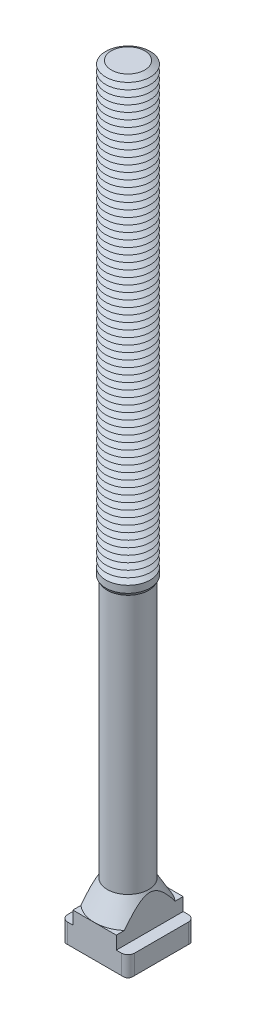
ISO-10303-21;
HEADER;
FILE_DESCRIPTION(('STEP AP214'),'2;1');
FILE_NAME('part.step','',(''),(''),'','','');
FILE_SCHEMA(('AUTOMOTIVE_DESIGN { 1 0 10303 214 1 1 1 1 }'));
ENDSEC;
DATA;
#1=APPLICATION_CONTEXT('core data for automotive mechanical design processes');
#2=APPLICATION_PROTOCOL_DEFINITION('international standard','automotive_design',2000,#1);
#3=PRODUCT_CONTEXT('',#1,'mechanical');
#4=PRODUCT('Part','Part','',(#3));
#5=PRODUCT_RELATED_PRODUCT_CATEGORY('part','',(#4));
#6=PRODUCT_DEFINITION_FORMATION('','',#4);
#7=PRODUCT_DEFINITION_CONTEXT('part definition',#1,'design');
#8=PRODUCT_DEFINITION('design','',#6,#7);
#9=PRODUCT_DEFINITION_SHAPE('','',#8);
#10=(LENGTH_UNIT() NAMED_UNIT(*) SI_UNIT(.MILLI.,.METRE.));
#11=(NAMED_UNIT(*) PLANE_ANGLE_UNIT() SI_UNIT($,.RADIAN.));
#12=(NAMED_UNIT(*) SI_UNIT($,.STERADIAN.) SOLID_ANGLE_UNIT());
#13=UNCERTAINTY_MEASURE_WITH_UNIT(LENGTH_MEASURE(1.E-05),#10,'distance_accuracy_value','');
#14=(GEOMETRIC_REPRESENTATION_CONTEXT(3) GLOBAL_UNCERTAINTY_ASSIGNED_CONTEXT((#13)) GLOBAL_UNIT_ASSIGNED_CONTEXT((#10,
#11,#12)) REPRESENTATION_CONTEXT('',''));
#15=CARTESIAN_POINT('',(0.,0.,0.));
#16=DIRECTION('',(0.,0.,1.));
#17=DIRECTION('',(1.,0.,0.));
#18=AXIS2_PLACEMENT_3D('',#15,#16,#17);
#19=CARTESIAN_POINT('',(0.,200.,0.));
#20=DIRECTION('',(0.,-1.,0.));
#21=DIRECTION('',(0.,0.,-1.));
#22=AXIS2_PLACEMENT_3D('',#19,#20,#21);
#23=CONICAL_SURFACE('',#22,4.48445554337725,1.04719755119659);
#24=CARTESIAN_POINT('',(0.,199.125,0.));
#25=DIRECTION('',(0.,-1.,0.));
#26=DIRECTION('',(0.,0.,-1.));
#27=AXIS2_PLACEMENT_3D('',#24,#25,#26);
#28=CIRCLE('',#27,6.00000000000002);
#29=CARTESIAN_POINT('',(0.,199.125,-6.00000000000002));
#30=VERTEX_POINT('',#29);
#31=EDGE_CURVE('E886',#30,#30,#28,.T.);
#32=ORIENTED_EDGE('',*,*,#31,.F.);
#33=EDGE_LOOP('',(#32));
#34=FACE_BOUND('',#33,.T.);
#35=CARTESIAN_POINT('',(0.,200.,0.));
#36=DIRECTION('',(0.,-1.,0.));
#37=DIRECTION('',(0.,0.,-1.));
#38=AXIS2_PLACEMENT_3D('',#35,#36,#37);
#39=CIRCLE('',#38,4.48445554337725);
#40=CARTESIAN_POINT('',(0.,200.,-4.48445554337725));
#41=VERTEX_POINT('',#40);
#42=EDGE_CURVE('E2570',#41,#41,#39,.T.);
#43=ORIENTED_EDGE('',*,*,#42,.T.);
#44=EDGE_LOOP('',(#43));
#45=FACE_BOUND('',#44,.T.);
#46=ADVANCED_FACE('F39',(#34,#45),#23,.T.);
#47=CARTESIAN_POINT('',(0.,200.875,0.));
#48=DIRECTION('',(0.,1.,0.));
#49=DIRECTION('',(0.,0.,1.));
#50=AXIS2_PLACEMENT_3D('',#47,#48,#49);
#51=CONICAL_SURFACE('',#50,6.00000000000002,1.0471975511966);
#52=ORIENTED_EDGE('',*,*,#42,.F.);
#53=EDGE_LOOP('',(#52));
#54=FACE_BOUND('',#53,.T.);
#55=CARTESIAN_POINT('',(0.,200.875,0.));
#56=DIRECTION('',(0.,-1.,0.));
#57=DIRECTION('',(0.,0.,-1.));
#58=AXIS2_PLACEMENT_3D('',#55,#56,#57);
#59=CIRCLE('',#58,6.00000000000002);
#60=CARTESIAN_POINT('',(0.,200.875,-6.00000000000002));
#61=VERTEX_POINT('',#60);
#62=EDGE_CURVE('E717',#61,#61,#59,.T.);
#63=ORIENTED_EDGE('',*,*,#62,.T.);
#64=EDGE_LOOP('',(#63));
#65=FACE_BOUND('',#64,.T.);
#66=ADVANCED_FACE('F449',(#54,#65),#51,.T.);
#67=CARTESIAN_POINT('',(2.99995606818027,207.,0.));
#68=DIRECTION('',(0.,-1.,0.));
#69=DIRECTION('',(1.,0.,0.));
#70=AXIS2_PLACEMENT_3D('',#67,#68,#69);
#71=PLANE('',#70);
#72=CARTESIAN_POINT('',(0.,207.,0.));
#73=DIRECTION('',(0.,-1.,0.));
#74=DIRECTION('',(0.,0.,-1.));
#75=AXIS2_PLACEMENT_3D('',#72,#73,#74);
#76=CIRCLE('',#75,4.48445554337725);
#77=CARTESIAN_POINT('',(0.,207.,-4.48445554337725));
#78=VERTEX_POINT('',#77);
#79=EDGE_CURVE('E719',#78,#78,#76,.T.);
#80=ORIENTED_EDGE('',*,*,#79,.F.);
#81=EDGE_LOOP('',(#80));
#82=FACE_BOUND('',#81,.T.);
#83=ADVANCED_FACE('F455',(#82),#71,.F.);
#84=CARTESIAN_POINT('',(0.,207.,0.));
#85=DIRECTION('',(0.,-1.,0.));
#86=DIRECTION('',(0.,0.,-1.));
#87=AXIS2_PLACEMENT_3D('',#84,#85,#86);
#88=CONICAL_SURFACE('',#87,4.48445554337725,1.04719755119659);
#89=CARTESIAN_POINT('',(0.,206.125,0.));
#90=DIRECTION('',(0.,-1.,0.));
#91=DIRECTION('',(0.,0.,-1.));
#92=AXIS2_PLACEMENT_3D('',#89,#90,#91);
#93=CIRCLE('',#92,6.00000000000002);
#94=CARTESIAN_POINT('',(0.,206.125,-6.00000000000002));
#95=VERTEX_POINT('',#94);
#96=EDGE_CURVE('E722',#95,#95,#93,.T.);
#97=ORIENTED_EDGE('',*,*,#96,.F.);
#98=EDGE_LOOP('',(#97));
#99=FACE_BOUND('',#98,.T.);
#100=ORIENTED_EDGE('',*,*,#79,.T.);
#101=EDGE_LOOP('',(#100));
#102=FACE_BOUND('',#101,.T.);
#103=ADVANCED_FACE('F483',(#99,#102),#88,.T.);
#104=CARTESIAN_POINT('',(0.,206.125,0.));
#105=DIRECTION('',(0.,1.,0.));
#106=DIRECTION('',(0.,0.,1.));
#107=AXIS2_PLACEMENT_3D('',#104,#105,#106);
#108=CONICAL_SURFACE('',#107,6.00000000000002,1.0471975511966);
#109=CARTESIAN_POINT('',(0.,205.25,0.));
#110=DIRECTION('',(0.,-1.,0.));
#111=DIRECTION('',(0.,0.,-1.));
#112=AXIS2_PLACEMENT_3D('',#109,#110,#111);
#113=CIRCLE('',#112,4.48445554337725);
#114=CARTESIAN_POINT('',(0.,205.25,-4.48445554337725));
#115=VERTEX_POINT('',#114);
#116=EDGE_CURVE('E825',#115,#115,#113,.T.);
#117=ORIENTED_EDGE('',*,*,#116,.F.);
#118=EDGE_LOOP('',(#117));
#119=FACE_BOUND('',#118,.T.);
#120=ORIENTED_EDGE('',*,*,#96,.T.);
#121=EDGE_LOOP('',(#120));
#122=FACE_BOUND('',#121,.T.);
#123=ADVANCED_FACE('F480',(#119,#122),#108,.T.);
#124=CARTESIAN_POINT('',(0.,205.25,0.));
#125=DIRECTION('',(0.,-1.,0.));
#126=DIRECTION('',(0.,0.,-1.));
#127=AXIS2_PLACEMENT_3D('',#124,#125,#126);
#128=CONICAL_SURFACE('',#127,4.48445554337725,1.04719755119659);
#129=CARTESIAN_POINT('',(0.,204.375,0.));
#130=DIRECTION('',(0.,-1.,0.));
#131=DIRECTION('',(0.,0.,-1.));
#132=AXIS2_PLACEMENT_3D('',#129,#130,#131);
#133=CIRCLE('',#132,6.00000000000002);
#134=CARTESIAN_POINT('',(0.,204.375,-6.00000000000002));
#135=VERTEX_POINT('',#134);
#136=EDGE_CURVE('E827',#135,#135,#133,.T.);
#137=ORIENTED_EDGE('',*,*,#136,.F.);
#138=EDGE_LOOP('',(#137));
#139=FACE_BOUND('',#138,.T.);
#140=ORIENTED_EDGE('',*,*,#116,.T.);
#141=EDGE_LOOP('',(#140));
#142=FACE_BOUND('',#141,.T.);
#143=ADVANCED_FACE('F475',(#139,#142),#128,.T.);
#144=CARTESIAN_POINT('',(0.,204.375,0.));
#145=DIRECTION('',(0.,1.,0.));
#146=DIRECTION('',(0.,0.,1.));
#147=AXIS2_PLACEMENT_3D('',#144,#145,#146);
#148=CONICAL_SURFACE('',#147,6.00000000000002,1.0471975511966);
#149=CARTESIAN_POINT('',(0.,203.5,0.));
#150=DIRECTION('',(0.,-1.,0.));
#151=DIRECTION('',(0.,0.,-1.));
#152=AXIS2_PLACEMENT_3D('',#149,#150,#151);
#153=CIRCLE('',#152,4.48445554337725);
#154=CARTESIAN_POINT('',(0.,203.5,-4.48445554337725));
#155=VERTEX_POINT('',#154);
#156=EDGE_CURVE('E755',#155,#155,#153,.T.);
#157=ORIENTED_EDGE('',*,*,#156,.F.);
#158=EDGE_LOOP('',(#157));
#159=FACE_BOUND('',#158,.T.);
#160=ORIENTED_EDGE('',*,*,#136,.T.);
#161=EDGE_LOOP('',(#160));
#162=FACE_BOUND('',#161,.T.);
#163=ADVANCED_FACE('F472',(#159,#162),#148,.T.);
#164=CARTESIAN_POINT('',(0.,203.5,0.));
#165=DIRECTION('',(0.,-1.,0.));
#166=DIRECTION('',(0.,0.,-1.));
#167=AXIS2_PLACEMENT_3D('',#164,#165,#166);
#168=CONICAL_SURFACE('',#167,4.48445554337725,1.04719755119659);
#169=CARTESIAN_POINT('',(0.,202.625,0.));
#170=DIRECTION('',(0.,-1.,0.));
#171=DIRECTION('',(0.,0.,-1.));
#172=AXIS2_PLACEMENT_3D('',#169,#170,#171);
#173=CIRCLE('',#172,6.00000000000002);
#174=CARTESIAN_POINT('',(0.,202.625,-6.00000000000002));
#175=VERTEX_POINT('',#174);
#176=EDGE_CURVE('E716',#175,#175,#173,.T.);
#177=ORIENTED_EDGE('',*,*,#176,.F.);
#178=EDGE_LOOP('',(#177));
#179=FACE_BOUND('',#178,.T.);
#180=ORIENTED_EDGE('',*,*,#156,.T.);
#181=EDGE_LOOP('',(#180));
#182=FACE_BOUND('',#181,.T.);
#183=ADVANCED_FACE('F466',(#179,#182),#168,.T.);
#184=CARTESIAN_POINT('',(0.,202.625,0.));
#185=DIRECTION('',(0.,1.,0.));
#186=DIRECTION('',(0.,0.,1.));
#187=AXIS2_PLACEMENT_3D('',#184,#185,#186);
#188=CONICAL_SURFACE('',#187,6.00000000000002,1.0471975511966);
#189=CARTESIAN_POINT('',(0.,201.75,0.));
#190=DIRECTION('',(0.,-1.,0.));
#191=DIRECTION('',(0.,0.,-1.));
#192=AXIS2_PLACEMENT_3D('',#189,#190,#191);
#193=CIRCLE('',#192,4.48445554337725);
#194=CARTESIAN_POINT('',(0.,201.75,-4.48445554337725));
#195=VERTEX_POINT('',#194);
#196=EDGE_CURVE('E713',#195,#195,#193,.T.);
#197=ORIENTED_EDGE('',*,*,#196,.F.);
#198=EDGE_LOOP('',(#197));
#199=FACE_BOUND('',#198,.T.);
#200=ORIENTED_EDGE('',*,*,#176,.T.);
#201=EDGE_LOOP('',(#200));
#202=FACE_BOUND('',#201,.T.);
#203=ADVANCED_FACE('F462',(#199,#202),#188,.T.);
#204=CARTESIAN_POINT('',(0.,201.75,0.));
#205=DIRECTION('',(0.,-1.,0.));
#206=DIRECTION('',(0.,0.,-1.));
#207=AXIS2_PLACEMENT_3D('',#204,#205,#206);
#208=CONICAL_SURFACE('',#207,4.48445554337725,1.04719755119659);
#209=ORIENTED_EDGE('',*,*,#62,.F.);
#210=EDGE_LOOP('',(#209));
#211=FACE_BOUND('',#210,.T.);
#212=ORIENTED_EDGE('',*,*,#196,.T.);
#213=EDGE_LOOP('',(#212));
#214=FACE_BOUND('',#213,.T.);
#215=ADVANCED_FACE('F465',(#211,#214),#208,.T.);
#216=CARTESIAN_POINT('',(0.,198.25,0.));
#217=DIRECTION('',(0.,-1.,0.));
#218=DIRECTION('',(0.,0.,-1.));
#219=AXIS2_PLACEMENT_3D('',#216,#217,#218);
#220=CONICAL_SURFACE('',#219,4.48445554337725,1.04719755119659);
#221=CARTESIAN_POINT('',(0.,197.375,0.));
#222=DIRECTION('',(0.,-1.,0.));
#223=DIRECTION('',(0.,0.,-1.));
#224=AXIS2_PLACEMENT_3D('',#221,#222,#223);
#225=CIRCLE('',#224,6.00000000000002);
#226=CARTESIAN_POINT('',(0.,197.375,-6.00000000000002));
#227=VERTEX_POINT('',#226);
#228=EDGE_CURVE('E707',#227,#227,#225,.T.);
#229=ORIENTED_EDGE('',*,*,#228,.F.);
#230=EDGE_LOOP('',(#229));
#231=FACE_BOUND('',#230,.T.);
#232=CARTESIAN_POINT('',(0.,198.25,0.));
#233=DIRECTION('',(0.,-1.,0.));
#234=DIRECTION('',(0.,0.,-1.));
#235=AXIS2_PLACEMENT_3D('',#232,#233,#234);
#236=CIRCLE('',#235,4.48445554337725);
#237=CARTESIAN_POINT('',(0.,198.25,-4.48445554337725));
#238=VERTEX_POINT('',#237);
#239=EDGE_CURVE('E710',#238,#238,#236,.T.);
#240=ORIENTED_EDGE('',*,*,#239,.T.);
#241=EDGE_LOOP('',(#240));
#242=FACE_BOUND('',#241,.T.);
#243=ADVANCED_FACE('F470',(#231,#242),#220,.T.);
#244=CARTESIAN_POINT('',(0.,199.125,0.));
#245=DIRECTION('',(0.,1.,0.));
#246=DIRECTION('',(0.,0.,1.));
#247=AXIS2_PLACEMENT_3D('',#244,#245,#246);
#248=CONICAL_SURFACE('',#247,6.00000000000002,1.0471975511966);
#249=ORIENTED_EDGE('',*,*,#239,.F.);
#250=EDGE_LOOP('',(#249));
#251=FACE_BOUND('',#250,.T.);
#252=ORIENTED_EDGE('',*,*,#31,.T.);
#253=EDGE_LOOP('',(#252));
#254=FACE_BOUND('',#253,.T.);
#255=ADVANCED_FACE('F2267',(#251,#254),#248,.T.);
#256=CARTESIAN_POINT('',(0.,196.5,0.));
#257=DIRECTION('',(0.,-1.,0.));
#258=DIRECTION('',(0.,0.,-1.));
#259=AXIS2_PLACEMENT_3D('',#256,#257,#258);
#260=CONICAL_SURFACE('',#259,4.48445554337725,1.04719755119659);
#261=CARTESIAN_POINT('',(0.,195.625,0.));
#262=DIRECTION('',(0.,-1.,0.));
#263=DIRECTION('',(0.,0.,-1.));
#264=AXIS2_PLACEMENT_3D('',#261,#262,#263);
#265=CIRCLE('',#264,6.00000000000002);
#266=CARTESIAN_POINT('',(0.,195.625,-6.00000000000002));
#267=VERTEX_POINT('',#266);
#268=EDGE_CURVE('E879',#267,#267,#265,.T.);
#269=ORIENTED_EDGE('',*,*,#268,.F.);
#270=EDGE_LOOP('',(#269));
#271=FACE_BOUND('',#270,.T.);
#272=CARTESIAN_POINT('',(0.,196.5,0.));
#273=DIRECTION('',(0.,-1.,0.));
#274=DIRECTION('',(0.,0.,-1.));
#275=AXIS2_PLACEMENT_3D('',#272,#273,#274);
#276=CIRCLE('',#275,4.48445554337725);
#277=CARTESIAN_POINT('',(0.,196.5,-4.48445554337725));
#278=VERTEX_POINT('',#277);
#279=EDGE_CURVE('E711',#278,#278,#276,.T.);
#280=ORIENTED_EDGE('',*,*,#279,.T.);
#281=EDGE_LOOP('',(#280));
#282=FACE_BOUND('',#281,.T.);
#283=ADVANCED_FACE('F2257',(#271,#282),#260,.T.);
#284=CARTESIAN_POINT('',(0.,197.375,0.));
#285=DIRECTION('',(0.,1.,0.));
#286=DIRECTION('',(0.,0.,1.));
#287=AXIS2_PLACEMENT_3D('',#284,#285,#286);
#288=CONICAL_SURFACE('',#287,6.00000000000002,1.0471975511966);
#289=ORIENTED_EDGE('',*,*,#279,.F.);
#290=EDGE_LOOP('',(#289));
#291=FACE_BOUND('',#290,.T.);
#292=ORIENTED_EDGE('',*,*,#228,.T.);
#293=EDGE_LOOP('',(#292));
#294=FACE_BOUND('',#293,.T.);
#295=ADVANCED_FACE('F2247',(#291,#294),#288,.T.);
#296=CARTESIAN_POINT('',(0.,194.75,0.));
#297=DIRECTION('',(0.,-1.,0.));
#298=DIRECTION('',(0.,0.,-1.));
#299=AXIS2_PLACEMENT_3D('',#296,#297,#298);
#300=CONICAL_SURFACE('',#299,4.48445554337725,1.04719755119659);
#301=CARTESIAN_POINT('',(0.,193.875,0.));
#302=DIRECTION('',(0.,-1.,0.));
#303=DIRECTION('',(0.,0.,-1.));
#304=AXIS2_PLACEMENT_3D('',#301,#302,#303);
#305=CIRCLE('',#304,6.00000000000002);
#306=CARTESIAN_POINT('',(0.,193.875,-6.00000000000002));
#307=VERTEX_POINT('',#306);
#308=EDGE_CURVE('E2651',#307,#307,#305,.T.);
#309=ORIENTED_EDGE('',*,*,#308,.F.);
#310=EDGE_LOOP('',(#309));
#311=FACE_BOUND('',#310,.T.);
#312=CARTESIAN_POINT('',(0.,194.75,0.));
#313=DIRECTION('',(0.,-1.,0.));
#314=DIRECTION('',(0.,0.,-1.));
#315=AXIS2_PLACEMENT_3D('',#312,#313,#314);
#316=CIRCLE('',#315,4.48445554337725);
#317=CARTESIAN_POINT('',(0.,194.75,-4.48445554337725));
#318=VERTEX_POINT('',#317);
#319=EDGE_CURVE('E882',#318,#318,#316,.T.);
#320=ORIENTED_EDGE('',*,*,#319,.T.);
#321=EDGE_LOOP('',(#320));
#322=FACE_BOUND('',#321,.T.);
#323=ADVANCED_FACE('F2237',(#311,#322),#300,.T.);
#324=CARTESIAN_POINT('',(0.,195.625,0.));
#325=DIRECTION('',(0.,1.,0.));
#326=DIRECTION('',(0.,0.,1.));
#327=AXIS2_PLACEMENT_3D('',#324,#325,#326);
#328=CONICAL_SURFACE('',#327,6.00000000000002,1.0471975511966);
#329=ORIENTED_EDGE('',*,*,#319,.F.);
#330=EDGE_LOOP('',(#329));
#331=FACE_BOUND('',#330,.T.);
#332=ORIENTED_EDGE('',*,*,#268,.T.);
#333=EDGE_LOOP('',(#332));
#334=FACE_BOUND('',#333,.T.);
#335=ADVANCED_FACE('F2227',(#331,#334),#328,.T.);
#336=CARTESIAN_POINT('',(0.,193.,0.));
#337=DIRECTION('',(0.,-1.,0.));
#338=DIRECTION('',(0.,0.,-1.));
#339=AXIS2_PLACEMENT_3D('',#336,#337,#338);
#340=CONICAL_SURFACE('',#339,4.48445554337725,1.04719755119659);
#341=CARTESIAN_POINT('',(0.,192.125,0.));
#342=DIRECTION('',(0.,-1.,0.));
#343=DIRECTION('',(0.,0.,-1.));
#344=AXIS2_PLACEMENT_3D('',#341,#342,#343);
#345=CIRCLE('',#344,6.00000000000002);
#346=CARTESIAN_POINT('',(0.,192.125,-6.00000000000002));
#347=VERTEX_POINT('',#346);
#348=EDGE_CURVE('E822',#347,#347,#345,.T.);
#349=ORIENTED_EDGE('',*,*,#348,.F.);
#350=EDGE_LOOP('',(#349));
#351=FACE_BOUND('',#350,.T.);
#352=CARTESIAN_POINT('',(0.,193.,0.));
#353=DIRECTION('',(0.,-1.,0.));
#354=DIRECTION('',(0.,0.,-1.));
#355=AXIS2_PLACEMENT_3D('',#352,#353,#354);
#356=CIRCLE('',#355,4.48445554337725);
#357=CARTESIAN_POINT('',(0.,193.,-4.48445554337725));
#358=VERTEX_POINT('',#357);
#359=EDGE_CURVE('E2654',#358,#358,#356,.T.);
#360=ORIENTED_EDGE('',*,*,#359,.T.);
#361=EDGE_LOOP('',(#360));
#362=FACE_BOUND('',#361,.T.);
#363=ADVANCED_FACE('F2217',(#351,#362),#340,.T.);
#364=CARTESIAN_POINT('',(0.,193.875,0.));
#365=DIRECTION('',(0.,1.,0.));
#366=DIRECTION('',(0.,0.,1.));
#367=AXIS2_PLACEMENT_3D('',#364,#365,#366);
#368=CONICAL_SURFACE('',#367,6.00000000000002,1.0471975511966);
#369=ORIENTED_EDGE('',*,*,#359,.F.);
#370=EDGE_LOOP('',(#369));
#371=FACE_BOUND('',#370,.T.);
#372=ORIENTED_EDGE('',*,*,#308,.T.);
#373=EDGE_LOOP('',(#372));
#374=FACE_BOUND('',#373,.T.);
#375=ADVANCED_FACE('F2207',(#371,#374),#368,.T.);
#376=CARTESIAN_POINT('',(0.,191.25,0.));
#377=DIRECTION('',(0.,-1.,0.));
#378=DIRECTION('',(0.,0.,-1.));
#379=AXIS2_PLACEMENT_3D('',#376,#377,#378);
#380=CONICAL_SURFACE('',#379,4.48445554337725,1.04719755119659);
#381=CARTESIAN_POINT('',(0.,190.375,0.));
#382=DIRECTION('',(0.,-1.,0.));
#383=DIRECTION('',(0.,0.,-1.));
#384=AXIS2_PLACEMENT_3D('',#381,#382,#383);
#385=CIRCLE('',#384,6.00000000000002);
#386=CARTESIAN_POINT('',(0.,190.375,-6.00000000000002));
#387=VERTEX_POINT('',#386);
#388=EDGE_CURVE('E823',#387,#387,#385,.T.);
#389=ORIENTED_EDGE('',*,*,#388,.F.);
#390=EDGE_LOOP('',(#389));
#391=FACE_BOUND('',#390,.T.);
#392=CARTESIAN_POINT('',(0.,191.25,0.));
#393=DIRECTION('',(0.,-1.,0.));
#394=DIRECTION('',(0.,0.,-1.));
#395=AXIS2_PLACEMENT_3D('',#392,#393,#394);
#396=CIRCLE('',#395,4.48445554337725);
#397=CARTESIAN_POINT('',(0.,191.25,-4.48445554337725));
#398=VERTEX_POINT('',#397);
#399=EDGE_CURVE('E819',#398,#398,#396,.T.);
#400=ORIENTED_EDGE('',*,*,#399,.T.);
#401=EDGE_LOOP('',(#400));
#402=FACE_BOUND('',#401,.T.);
#403=ADVANCED_FACE('F2197',(#391,#402),#380,.T.);
#404=CARTESIAN_POINT('',(0.,192.125,0.));
#405=DIRECTION('',(0.,1.,0.));
#406=DIRECTION('',(0.,0.,1.));
#407=AXIS2_PLACEMENT_3D('',#404,#405,#406);
#408=CONICAL_SURFACE('',#407,6.00000000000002,1.0471975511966);
#409=ORIENTED_EDGE('',*,*,#399,.F.);
#410=EDGE_LOOP('',(#409));
#411=FACE_BOUND('',#410,.T.);
#412=ORIENTED_EDGE('',*,*,#348,.T.);
#413=EDGE_LOOP('',(#412));
#414=FACE_BOUND('',#413,.T.);
#415=ADVANCED_FACE('F2187',(#411,#414),#408,.T.);
#416=CARTESIAN_POINT('',(0.,189.5,0.));
#417=DIRECTION('',(0.,-1.,0.));
#418=DIRECTION('',(0.,0.,-1.));
#419=AXIS2_PLACEMENT_3D('',#416,#417,#418);
#420=CONICAL_SURFACE('',#419,4.48445554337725,1.04719755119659);
#421=CARTESIAN_POINT('',(0.,188.625,0.));
#422=DIRECTION('',(0.,-1.,0.));
#423=DIRECTION('',(0.,0.,-1.));
#424=AXIS2_PLACEMENT_3D('',#421,#422,#423);
#425=CIRCLE('',#424,6.00000000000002);
#426=CARTESIAN_POINT('',(0.,188.625,-6.00000000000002));
#427=VERTEX_POINT('',#426);
#428=EDGE_CURVE('E2587',#427,#427,#425,.T.);
#429=ORIENTED_EDGE('',*,*,#428,.F.);
#430=EDGE_LOOP('',(#429));
#431=FACE_BOUND('',#430,.T.);
#432=CARTESIAN_POINT('',(0.,189.5,0.));
#433=DIRECTION('',(0.,-1.,0.));
#434=DIRECTION('',(0.,0.,-1.));
#435=AXIS2_PLACEMENT_3D('',#432,#433,#434);
#436=CIRCLE('',#435,4.48445554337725);
#437=CARTESIAN_POINT('',(0.,189.5,-4.48445554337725));
#438=VERTEX_POINT('',#437);
#439=EDGE_CURVE('E862',#438,#438,#436,.T.);
#440=ORIENTED_EDGE('',*,*,#439,.T.);
#441=EDGE_LOOP('',(#440));
#442=FACE_BOUND('',#441,.T.);
#443=ADVANCED_FACE('F2177',(#431,#442),#420,.T.);
#444=CARTESIAN_POINT('',(0.,190.375,0.));
#445=DIRECTION('',(0.,1.,0.));
#446=DIRECTION('',(0.,0.,1.));
#447=AXIS2_PLACEMENT_3D('',#444,#445,#446);
#448=CONICAL_SURFACE('',#447,6.00000000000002,1.0471975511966);
#449=ORIENTED_EDGE('',*,*,#439,.F.);
#450=EDGE_LOOP('',(#449));
#451=FACE_BOUND('',#450,.T.);
#452=ORIENTED_EDGE('',*,*,#388,.T.);
#453=EDGE_LOOP('',(#452));
#454=FACE_BOUND('',#453,.T.);
#455=ADVANCED_FACE('F2167',(#451,#454),#448,.T.);
#456=CARTESIAN_POINT('',(0.,187.75,0.));
#457=DIRECTION('',(0.,-1.,0.));
#458=DIRECTION('',(0.,0.,-1.));
#459=AXIS2_PLACEMENT_3D('',#456,#457,#458);
#460=CONICAL_SURFACE('',#459,4.48445554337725,1.04719755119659);
#461=CARTESIAN_POINT('',(0.,186.875,0.));
#462=DIRECTION('',(0.,-1.,0.));
#463=DIRECTION('',(0.,0.,-1.));
#464=AXIS2_PLACEMENT_3D('',#461,#462,#463);
#465=CIRCLE('',#464,6.00000000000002);
#466=CARTESIAN_POINT('',(0.,186.875,-6.00000000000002));
#467=VERTEX_POINT('',#466);
#468=EDGE_CURVE('E813',#467,#467,#465,.T.);
#469=ORIENTED_EDGE('',*,*,#468,.F.);
#470=EDGE_LOOP('',(#469));
#471=FACE_BOUND('',#470,.T.);
#472=CARTESIAN_POINT('',(0.,187.75,0.));
#473=DIRECTION('',(0.,-1.,0.));
#474=DIRECTION('',(0.,0.,-1.));
#475=AXIS2_PLACEMENT_3D('',#472,#473,#474);
#476=CIRCLE('',#475,4.48445554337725);
#477=CARTESIAN_POINT('',(0.,187.75,-4.48445554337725));
#478=VERTEX_POINT('',#477);
#479=EDGE_CURVE('E816',#478,#478,#476,.T.);
#480=ORIENTED_EDGE('',*,*,#479,.T.);
#481=EDGE_LOOP('',(#480));
#482=FACE_BOUND('',#481,.T.);
#483=ADVANCED_FACE('F2157',(#471,#482),#460,.T.);
#484=CARTESIAN_POINT('',(0.,188.625,0.));
#485=DIRECTION('',(0.,1.,0.));
#486=DIRECTION('',(0.,0.,1.));
#487=AXIS2_PLACEMENT_3D('',#484,#485,#486);
#488=CONICAL_SURFACE('',#487,6.00000000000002,1.0471975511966);
#489=ORIENTED_EDGE('',*,*,#479,.F.);
#490=EDGE_LOOP('',(#489));
#491=FACE_BOUND('',#490,.T.);
#492=ORIENTED_EDGE('',*,*,#428,.T.);
#493=EDGE_LOOP('',(#492));
#494=FACE_BOUND('',#493,.T.);
#495=ADVANCED_FACE('F2147',(#491,#494),#488,.T.);
#496=CARTESIAN_POINT('',(0.,186.,0.));
#497=DIRECTION('',(0.,-1.,0.));
#498=DIRECTION('',(0.,0.,-1.));
#499=AXIS2_PLACEMENT_3D('',#496,#497,#498);
#500=CONICAL_SURFACE('',#499,4.48445554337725,1.04719755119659);
#501=CARTESIAN_POINT('',(0.,185.125,0.));
#502=DIRECTION('',(0.,-1.,0.));
#503=DIRECTION('',(0.,0.,-1.));
#504=AXIS2_PLACEMENT_3D('',#501,#502,#503);
#505=CIRCLE('',#504,6.00000000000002);
#506=CARTESIAN_POINT('',(0.,185.125,-6.00000000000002));
#507=VERTEX_POINT('',#506);
#508=EDGE_CURVE('E2597',#507,#507,#505,.T.);
#509=ORIENTED_EDGE('',*,*,#508,.F.);
#510=EDGE_LOOP('',(#509));
#511=FACE_BOUND('',#510,.T.);
#512=CARTESIAN_POINT('',(0.,186.,0.));
#513=DIRECTION('',(0.,-1.,0.));
#514=DIRECTION('',(0.,0.,-1.));
#515=AXIS2_PLACEMENT_3D('',#512,#513,#514);
#516=CIRCLE('',#515,4.48445554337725);
#517=CARTESIAN_POINT('',(0.,186.,-4.48445554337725));
#518=VERTEX_POINT('',#517);
#519=EDGE_CURVE('E817',#518,#518,#516,.T.);
#520=ORIENTED_EDGE('',*,*,#519,.T.);
#521=EDGE_LOOP('',(#520));
#522=FACE_BOUND('',#521,.T.);
#523=ADVANCED_FACE('F2137',(#511,#522),#500,.T.);
#524=CARTESIAN_POINT('',(0.,186.875,0.));
#525=DIRECTION('',(0.,1.,0.));
#526=DIRECTION('',(0.,0.,1.));
#527=AXIS2_PLACEMENT_3D('',#524,#525,#526);
#528=CONICAL_SURFACE('',#527,6.00000000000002,1.0471975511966);
#529=ORIENTED_EDGE('',*,*,#519,.F.);
#530=EDGE_LOOP('',(#529));
#531=FACE_BOUND('',#530,.T.);
#532=ORIENTED_EDGE('',*,*,#468,.T.);
#533=EDGE_LOOP('',(#532));
#534=FACE_BOUND('',#533,.T.);
#535=ADVANCED_FACE('F2127',(#531,#534),#528,.T.);
#536=CARTESIAN_POINT('',(0.,184.25,0.));
#537=DIRECTION('',(0.,-1.,0.));
#538=DIRECTION('',(0.,0.,-1.));
#539=AXIS2_PLACEMENT_3D('',#536,#537,#538);
#540=CONICAL_SURFACE('',#539,4.48445554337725,1.04719755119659);
#541=CARTESIAN_POINT('',(0.,183.375,0.));
#542=DIRECTION('',(0.,-1.,0.));
#543=DIRECTION('',(0.,0.,-1.));
#544=AXIS2_PLACEMENT_3D('',#541,#542,#543);
#545=CIRCLE('',#544,6.00000000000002);
#546=CARTESIAN_POINT('',(0.,183.375,-6.00000000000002));
#547=VERTEX_POINT('',#546);
#548=EDGE_CURVE('E704',#547,#547,#545,.T.);
#549=ORIENTED_EDGE('',*,*,#548,.F.);
#550=EDGE_LOOP('',(#549));
#551=FACE_BOUND('',#550,.T.);
#552=CARTESIAN_POINT('',(0.,184.25,0.));
#553=DIRECTION('',(0.,-1.,0.));
#554=DIRECTION('',(0.,0.,-1.));
#555=AXIS2_PLACEMENT_3D('',#552,#553,#554);
#556=CIRCLE('',#555,4.48445554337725);
#557=CARTESIAN_POINT('',(0.,184.25,-4.48445554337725));
#558=VERTEX_POINT('',#557);
#559=EDGE_CURVE('E2600',#558,#558,#556,.T.);
#560=ORIENTED_EDGE('',*,*,#559,.T.);
#561=EDGE_LOOP('',(#560));
#562=FACE_BOUND('',#561,.T.);
#563=ADVANCED_FACE('F2117',(#551,#562),#540,.T.);
#564=CARTESIAN_POINT('',(0.,185.125,0.));
#565=DIRECTION('',(0.,1.,0.));
#566=DIRECTION('',(0.,0.,1.));
#567=AXIS2_PLACEMENT_3D('',#564,#565,#566);
#568=CONICAL_SURFACE('',#567,6.00000000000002,1.0471975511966);
#569=ORIENTED_EDGE('',*,*,#559,.F.);
#570=EDGE_LOOP('',(#569));
#571=FACE_BOUND('',#570,.T.);
#572=ORIENTED_EDGE('',*,*,#508,.T.);
#573=EDGE_LOOP('',(#572));
#574=FACE_BOUND('',#573,.T.);
#575=ADVANCED_FACE('F2107',(#571,#574),#568,.T.);
#576=CARTESIAN_POINT('',(0.,182.5,0.));
#577=DIRECTION('',(0.,-1.,0.));
#578=DIRECTION('',(0.,0.,-1.));
#579=AXIS2_PLACEMENT_3D('',#576,#577,#578);
#580=CONICAL_SURFACE('',#579,4.48445554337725,1.04719755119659);
#581=CARTESIAN_POINT('',(0.,181.625,0.));
#582=DIRECTION('',(0.,-1.,0.));
#583=DIRECTION('',(0.,0.,-1.));
#584=AXIS2_PLACEMENT_3D('',#581,#582,#583);
#585=CIRCLE('',#584,6.00000000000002);
#586=CARTESIAN_POINT('',(0.,181.625,-6.00000000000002));
#587=VERTEX_POINT('',#586);
#588=EDGE_CURVE('E705',#587,#587,#585,.T.);
#589=ORIENTED_EDGE('',*,*,#588,.F.);
#590=EDGE_LOOP('',(#589));
#591=FACE_BOUND('',#590,.T.);
#592=CARTESIAN_POINT('',(0.,182.5,0.));
#593=DIRECTION('',(0.,-1.,0.));
#594=DIRECTION('',(0.,0.,-1.));
#595=AXIS2_PLACEMENT_3D('',#592,#593,#594);
#596=CIRCLE('',#595,4.48445554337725);
#597=CARTESIAN_POINT('',(0.,182.5,-4.48445554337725));
#598=VERTEX_POINT('',#597);
#599=EDGE_CURVE('E701',#598,#598,#596,.T.);
#600=ORIENTED_EDGE('',*,*,#599,.T.);
#601=EDGE_LOOP('',(#600));
#602=FACE_BOUND('',#601,.T.);
#603=ADVANCED_FACE('F2097',(#591,#602),#580,.T.);
#604=CARTESIAN_POINT('',(0.,183.375,0.));
#605=DIRECTION('',(0.,1.,0.));
#606=DIRECTION('',(0.,0.,1.));
#607=AXIS2_PLACEMENT_3D('',#604,#605,#606);
#608=CONICAL_SURFACE('',#607,6.00000000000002,1.0471975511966);
#609=ORIENTED_EDGE('',*,*,#599,.F.);
#610=EDGE_LOOP('',(#609));
#611=FACE_BOUND('',#610,.T.);
#612=ORIENTED_EDGE('',*,*,#548,.T.);
#613=EDGE_LOOP('',(#612));
#614=FACE_BOUND('',#613,.T.);
#615=ADVANCED_FACE('F2087',(#611,#614),#608,.T.);
#616=CARTESIAN_POINT('',(0.,180.75,0.));
#617=DIRECTION('',(0.,-1.,0.));
#618=DIRECTION('',(0.,0.,-1.));
#619=AXIS2_PLACEMENT_3D('',#616,#617,#618);
#620=CONICAL_SURFACE('',#619,4.48445554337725,1.04719755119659);
#621=CARTESIAN_POINT('',(0.,179.875,0.));
#622=DIRECTION('',(0.,-1.,0.));
#623=DIRECTION('',(0.,0.,-1.));
#624=AXIS2_PLACEMENT_3D('',#621,#622,#623);
#625=CIRCLE('',#624,6.00000000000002);
#626=CARTESIAN_POINT('',(0.,179.875,-6.00000000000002));
#627=VERTEX_POINT('',#626);
#628=EDGE_CURVE('E747',#627,#627,#625,.T.);
#629=ORIENTED_EDGE('',*,*,#628,.F.);
#630=EDGE_LOOP('',(#629));
#631=FACE_BOUND('',#630,.T.);
#632=CARTESIAN_POINT('',(0.,180.75,0.));
#633=DIRECTION('',(0.,-1.,0.));
#634=DIRECTION('',(0.,0.,-1.));
#635=AXIS2_PLACEMENT_3D('',#632,#633,#634);
#636=CIRCLE('',#635,4.48445554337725);
#637=CARTESIAN_POINT('',(0.,180.75,-4.48445554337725));
#638=VERTEX_POINT('',#637);
#639=EDGE_CURVE('E750',#638,#638,#636,.T.);
#640=ORIENTED_EDGE('',*,*,#639,.T.);
#641=EDGE_LOOP('',(#640));
#642=FACE_BOUND('',#641,.T.);
#643=ADVANCED_FACE('F2077',(#631,#642),#620,.T.);
#644=CARTESIAN_POINT('',(0.,181.625,0.));
#645=DIRECTION('',(0.,1.,0.));
#646=DIRECTION('',(0.,0.,1.));
#647=AXIS2_PLACEMENT_3D('',#644,#645,#646);
#648=CONICAL_SURFACE('',#647,6.00000000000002,1.0471975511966);
#649=ORIENTED_EDGE('',*,*,#639,.F.);
#650=EDGE_LOOP('',(#649));
#651=FACE_BOUND('',#650,.T.);
#652=ORIENTED_EDGE('',*,*,#588,.T.);
#653=EDGE_LOOP('',(#652));
#654=FACE_BOUND('',#653,.T.);
#655=ADVANCED_FACE('F2067',(#651,#654),#648,.T.);
#656=CARTESIAN_POINT('',(0.,179.,0.));
#657=DIRECTION('',(0.,-1.,0.));
#658=DIRECTION('',(0.,0.,-1.));
#659=AXIS2_PLACEMENT_3D('',#656,#657,#658);
#660=CONICAL_SURFACE('',#659,4.48445554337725,1.04719755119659);
#661=CARTESIAN_POINT('',(0.,178.125,0.));
#662=DIRECTION('',(0.,-1.,0.));
#663=DIRECTION('',(0.,0.,-1.));
#664=AXIS2_PLACEMENT_3D('',#661,#662,#663);
#665=CIRCLE('',#664,6.00000000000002);
#666=CARTESIAN_POINT('',(0.,178.125,-6.00000000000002));
#667=VERTEX_POINT('',#666);
#668=EDGE_CURVE('E859',#667,#667,#665,.T.);
#669=ORIENTED_EDGE('',*,*,#668,.F.);
#670=EDGE_LOOP('',(#669));
#671=FACE_BOUND('',#670,.T.);
#672=CARTESIAN_POINT('',(0.,179.,0.));
#673=DIRECTION('',(0.,-1.,0.));
#674=DIRECTION('',(0.,0.,-1.));
#675=AXIS2_PLACEMENT_3D('',#672,#673,#674);
#676=CIRCLE('',#675,4.48445554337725);
#677=CARTESIAN_POINT('',(0.,179.,-4.48445554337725));
#678=VERTEX_POINT('',#677);
#679=EDGE_CURVE('E751',#678,#678,#676,.T.);
#680=ORIENTED_EDGE('',*,*,#679,.T.);
#681=EDGE_LOOP('',(#680));
#682=FACE_BOUND('',#681,.T.);
#683=ADVANCED_FACE('F2057',(#671,#682),#660,.T.);
#684=CARTESIAN_POINT('',(0.,179.875,0.));
#685=DIRECTION('',(0.,1.,0.));
#686=DIRECTION('',(0.,0.,1.));
#687=AXIS2_PLACEMENT_3D('',#684,#685,#686);
#688=CONICAL_SURFACE('',#687,6.00000000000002,1.0471975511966);
#689=ORIENTED_EDGE('',*,*,#679,.F.);
#690=EDGE_LOOP('',(#689));
#691=FACE_BOUND('',#690,.T.);
#692=ORIENTED_EDGE('',*,*,#628,.T.);
#693=EDGE_LOOP('',(#692));
#694=FACE_BOUND('',#693,.T.);
#695=ADVANCED_FACE('F2047',(#691,#694),#688,.T.);
#696=CARTESIAN_POINT('',(0.,177.25,0.));
#697=DIRECTION('',(0.,-1.,0.));
#698=DIRECTION('',(0.,0.,-1.));
#699=AXIS2_PLACEMENT_3D('',#696,#697,#698);
#700=CONICAL_SURFACE('',#699,4.48445554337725,1.04719755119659);
#701=CARTESIAN_POINT('',(0.,176.375,0.));
#702=DIRECTION('',(0.,-1.,0.));
#703=DIRECTION('',(0.,0.,-1.));
#704=AXIS2_PLACEMENT_3D('',#701,#702,#703);
#705=CIRCLE('',#704,6.00000000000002);
#706=CARTESIAN_POINT('',(0.,176.375,-6.00000000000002));
#707=VERTEX_POINT('',#706);
#708=EDGE_CURVE('E2825',#707,#707,#705,.T.);
#709=ORIENTED_EDGE('',*,*,#708,.F.);
#710=EDGE_LOOP('',(#709));
#711=FACE_BOUND('',#710,.T.);
#712=CARTESIAN_POINT('',(0.,177.25,0.));
#713=DIRECTION('',(0.,-1.,0.));
#714=DIRECTION('',(0.,0.,-1.));
#715=AXIS2_PLACEMENT_3D('',#712,#713,#714);
#716=CIRCLE('',#715,4.48445554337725);
#717=CARTESIAN_POINT('',(0.,177.25,-4.48445554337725));
#718=VERTEX_POINT('',#717);
#719=EDGE_CURVE('E2607',#718,#718,#716,.T.);
#720=ORIENTED_EDGE('',*,*,#719,.T.);
#721=EDGE_LOOP('',(#720));
#722=FACE_BOUND('',#721,.T.);
#723=ADVANCED_FACE('F2037',(#711,#722),#700,.T.);
#724=CARTESIAN_POINT('',(0.,178.125,0.));
#725=DIRECTION('',(0.,1.,0.));
#726=DIRECTION('',(0.,0.,1.));
#727=AXIS2_PLACEMENT_3D('',#724,#725,#726);
#728=CONICAL_SURFACE('',#727,6.00000000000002,1.0471975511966);
#729=ORIENTED_EDGE('',*,*,#719,.F.);
#730=EDGE_LOOP('',(#729));
#731=FACE_BOUND('',#730,.T.);
#732=ORIENTED_EDGE('',*,*,#668,.T.);
#733=EDGE_LOOP('',(#732));
#734=FACE_BOUND('',#733,.T.);
#735=ADVANCED_FACE('F2027',(#731,#734),#728,.T.);
#736=CARTESIAN_POINT('',(0.,175.5,0.));
#737=DIRECTION('',(0.,-1.,0.));
#738=DIRECTION('',(0.,0.,-1.));
#739=AXIS2_PLACEMENT_3D('',#736,#737,#738);
#740=CONICAL_SURFACE('',#739,4.48445554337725,1.04719755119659);
#741=CARTESIAN_POINT('',(0.,174.625,0.));
#742=DIRECTION('',(0.,-1.,0.));
#743=DIRECTION('',(0.,0.,-1.));
#744=AXIS2_PLACEMENT_3D('',#741,#742,#743);
#745=CIRCLE('',#744,6.00000000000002);
#746=CARTESIAN_POINT('',(0.,174.625,-6.00000000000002));
#747=VERTEX_POINT('',#746);
#748=EDGE_CURVE('E695',#747,#747,#745,.T.);
#749=ORIENTED_EDGE('',*,*,#748,.F.);
#750=EDGE_LOOP('',(#749));
#751=FACE_BOUND('',#750,.T.);
#752=CARTESIAN_POINT('',(0.,175.5,0.));
#753=DIRECTION('',(0.,-1.,0.));
#754=DIRECTION('',(0.,0.,-1.));
#755=AXIS2_PLACEMENT_3D('',#752,#753,#754);
#756=CIRCLE('',#755,4.48445554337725);
#757=CARTESIAN_POINT('',(0.,175.5,-4.48445554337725));
#758=VERTEX_POINT('',#757);
#759=EDGE_CURVE('E698',#758,#758,#756,.T.);
#760=ORIENTED_EDGE('',*,*,#759,.T.);
#761=EDGE_LOOP('',(#760));
#762=FACE_BOUND('',#761,.T.);
#763=ADVANCED_FACE('F2017',(#751,#762),#740,.T.);
#764=CARTESIAN_POINT('',(0.,176.375,0.));
#765=DIRECTION('',(0.,1.,0.));
#766=DIRECTION('',(0.,0.,1.));
#767=AXIS2_PLACEMENT_3D('',#764,#765,#766);
#768=CONICAL_SURFACE('',#767,6.00000000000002,1.0471975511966);
#769=ORIENTED_EDGE('',*,*,#759,.F.);
#770=EDGE_LOOP('',(#769));
#771=FACE_BOUND('',#770,.T.);
#772=ORIENTED_EDGE('',*,*,#708,.T.);
#773=EDGE_LOOP('',(#772));
#774=FACE_BOUND('',#773,.T.);
#775=ADVANCED_FACE('F2007',(#771,#774),#768,.T.);
#776=CARTESIAN_POINT('',(0.,173.75,0.));
#777=DIRECTION('',(0.,-1.,0.));
#778=DIRECTION('',(0.,0.,-1.));
#779=AXIS2_PLACEMENT_3D('',#776,#777,#778);
#780=CONICAL_SURFACE('',#779,4.48445554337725,1.04719755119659);
#781=CARTESIAN_POINT('',(0.,172.875,0.));
#782=DIRECTION('',(0.,-1.,0.));
#783=DIRECTION('',(0.,0.,-1.));
#784=AXIS2_PLACEMENT_3D('',#781,#782,#783);
#785=CIRCLE('',#784,6.00000000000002);
#786=CARTESIAN_POINT('',(0.,172.875,-6.00000000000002));
#787=VERTEX_POINT('',#786);
#788=EDGE_CURVE('E2609',#787,#787,#785,.T.);
#789=ORIENTED_EDGE('',*,*,#788,.F.);
#790=EDGE_LOOP('',(#789));
#791=FACE_BOUND('',#790,.T.);
#792=CARTESIAN_POINT('',(0.,173.75,0.));
#793=DIRECTION('',(0.,-1.,0.));
#794=DIRECTION('',(0.,0.,-1.));
#795=AXIS2_PLACEMENT_3D('',#792,#793,#794);
#796=CIRCLE('',#795,4.48445554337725);
#797=CARTESIAN_POINT('',(0.,173.75,-4.48445554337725));
#798=VERTEX_POINT('',#797);
#799=EDGE_CURVE('E699',#798,#798,#796,.T.);
#800=ORIENTED_EDGE('',*,*,#799,.T.);
#801=EDGE_LOOP('',(#800));
#802=FACE_BOUND('',#801,.T.);
#803=ADVANCED_FACE('F1997',(#791,#802),#780,.T.);
#804=CARTESIAN_POINT('',(0.,174.625,0.));
#805=DIRECTION('',(0.,1.,0.));
#806=DIRECTION('',(0.,0.,1.));
#807=AXIS2_PLACEMENT_3D('',#804,#805,#806);
#808=CONICAL_SURFACE('',#807,6.00000000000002,1.0471975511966);
#809=ORIENTED_EDGE('',*,*,#799,.F.);
#810=EDGE_LOOP('',(#809));
#811=FACE_BOUND('',#810,.T.);
#812=ORIENTED_EDGE('',*,*,#748,.T.);
#813=EDGE_LOOP('',(#812));
#814=FACE_BOUND('',#813,.T.);
#815=ADVANCED_FACE('F1987',(#811,#814),#808,.T.);
#816=CARTESIAN_POINT('',(0.,172.,0.));
#817=DIRECTION('',(0.,-1.,0.));
#818=DIRECTION('',(0.,0.,-1.));
#819=AXIS2_PLACEMENT_3D('',#816,#817,#818);
#820=CONICAL_SURFACE('',#819,4.48445554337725,1.04719755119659);
#821=CARTESIAN_POINT('',(0.,171.125,0.));
#822=DIRECTION('',(0.,-1.,0.));
#823=DIRECTION('',(0.,0.,-1.));
#824=AXIS2_PLACEMENT_3D('',#821,#822,#823);
#825=CIRCLE('',#824,6.00000000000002);
#826=CARTESIAN_POINT('',(0.,171.125,-6.00000000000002));
#827=VERTEX_POINT('',#826);
#828=EDGE_CURVE('E2591',#827,#827,#825,.T.);
#829=ORIENTED_EDGE('',*,*,#828,.F.);
#830=EDGE_LOOP('',(#829));
#831=FACE_BOUND('',#830,.T.);
#832=CARTESIAN_POINT('',(0.,172.,0.));
#833=DIRECTION('',(0.,-1.,0.));
#834=DIRECTION('',(0.,0.,-1.));
#835=AXIS2_PLACEMENT_3D('',#832,#833,#834);
#836=CIRCLE('',#835,4.48445554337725);
#837=CARTESIAN_POINT('',(0.,172.,-4.48445554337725));
#838=VERTEX_POINT('',#837);
#839=EDGE_CURVE('E2593',#838,#838,#836,.T.);
#840=ORIENTED_EDGE('',*,*,#839,.T.);
#841=EDGE_LOOP('',(#840));
#842=FACE_BOUND('',#841,.T.);
#843=ADVANCED_FACE('F1977',(#831,#842),#820,.T.);
#844=CARTESIAN_POINT('',(0.,172.875,0.));
#845=DIRECTION('',(0.,1.,0.));
#846=DIRECTION('',(0.,0.,1.));
#847=AXIS2_PLACEMENT_3D('',#844,#845,#846);
#848=CONICAL_SURFACE('',#847,6.00000000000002,1.0471975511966);
#849=ORIENTED_EDGE('',*,*,#839,.F.);
#850=EDGE_LOOP('',(#849));
#851=FACE_BOUND('',#850,.T.);
#852=ORIENTED_EDGE('',*,*,#788,.T.);
#853=EDGE_LOOP('',(#852));
#854=FACE_BOUND('',#853,.T.);
#855=ADVANCED_FACE('F1967',(#851,#854),#848,.T.);
#856=CARTESIAN_POINT('',(0.,170.25,0.));
#857=DIRECTION('',(0.,-1.,0.));
#858=DIRECTION('',(0.,0.,-1.));
#859=AXIS2_PLACEMENT_3D('',#856,#857,#858);
#860=CONICAL_SURFACE('',#859,4.48445554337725,1.04719755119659);
#861=CARTESIAN_POINT('',(0.,169.375,0.));
#862=DIRECTION('',(0.,-1.,0.));
#863=DIRECTION('',(0.,0.,-1.));
#864=AXIS2_PLACEMENT_3D('',#861,#862,#863);
#865=CIRCLE('',#864,6.00000000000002);
#866=CARTESIAN_POINT('',(0.,169.375,-6.00000000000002));
#867=VERTEX_POINT('',#866);
#868=EDGE_CURVE('E877',#867,#867,#865,.T.);
#869=ORIENTED_EDGE('',*,*,#868,.F.);
#870=EDGE_LOOP('',(#869));
#871=FACE_BOUND('',#870,.T.);
#872=CARTESIAN_POINT('',(0.,170.25,0.));
#873=DIRECTION('',(0.,-1.,0.));
#874=DIRECTION('',(0.,0.,-1.));
#875=AXIS2_PLACEMENT_3D('',#872,#873,#874);
#876=CIRCLE('',#875,4.48445554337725);
#877=CARTESIAN_POINT('',(0.,170.25,-4.48445554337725));
#878=VERTEX_POINT('',#877);
#879=EDGE_CURVE('E2594',#878,#878,#876,.T.);
#880=ORIENTED_EDGE('',*,*,#879,.T.);
#881=EDGE_LOOP('',(#880));
#882=FACE_BOUND('',#881,.T.);
#883=ADVANCED_FACE('F1957',(#871,#882),#860,.T.);
#884=CARTESIAN_POINT('',(0.,171.125,0.));
#885=DIRECTION('',(0.,1.,0.));
#886=DIRECTION('',(0.,0.,1.));
#887=AXIS2_PLACEMENT_3D('',#884,#885,#886);
#888=CONICAL_SURFACE('',#887,6.00000000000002,1.0471975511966);
#889=ORIENTED_EDGE('',*,*,#879,.F.);
#890=EDGE_LOOP('',(#889));
#891=FACE_BOUND('',#890,.T.);
#892=ORIENTED_EDGE('',*,*,#828,.T.);
#893=EDGE_LOOP('',(#892));
#894=FACE_BOUND('',#893,.T.);
#895=ADVANCED_FACE('F1947',(#891,#894),#888,.T.);
#896=CARTESIAN_POINT('',(0.,168.5,0.));
#897=DIRECTION('',(0.,-1.,0.));
#898=DIRECTION('',(0.,0.,-1.));
#899=AXIS2_PLACEMENT_3D('',#896,#897,#898);
#900=CONICAL_SURFACE('',#899,4.48445554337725,1.04719755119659);
#901=CARTESIAN_POINT('',(0.,167.625,0.));
#902=DIRECTION('',(0.,-1.,0.));
#903=DIRECTION('',(0.,0.,-1.));
#904=AXIS2_PLACEMENT_3D('',#901,#902,#903);
#905=CIRCLE('',#904,6.00000000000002);
#906=CARTESIAN_POINT('',(0.,167.625,-6.00000000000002));
#907=VERTEX_POINT('',#906);
#908=EDGE_CURVE('E807',#907,#907,#905,.T.);
#909=ORIENTED_EDGE('',*,*,#908,.F.);
#910=EDGE_LOOP('',(#909));
#911=FACE_BOUND('',#910,.T.);
#912=CARTESIAN_POINT('',(0.,168.5,0.));
#913=DIRECTION('',(0.,-1.,0.));
#914=DIRECTION('',(0.,0.,-1.));
#915=AXIS2_PLACEMENT_3D('',#912,#913,#914);
#916=CIRCLE('',#915,4.48445554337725);
#917=CARTESIAN_POINT('',(0.,168.5,-4.48445554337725));
#918=VERTEX_POINT('',#917);
#919=EDGE_CURVE('E810',#918,#918,#916,.T.);
#920=ORIENTED_EDGE('',*,*,#919,.T.);
#921=EDGE_LOOP('',(#920));
#922=FACE_BOUND('',#921,.T.);
#923=ADVANCED_FACE('F1937',(#911,#922),#900,.T.);
#924=CARTESIAN_POINT('',(0.,169.375,0.));
#925=DIRECTION('',(0.,1.,0.));
#926=DIRECTION('',(0.,0.,1.));
#927=AXIS2_PLACEMENT_3D('',#924,#925,#926);
#928=CONICAL_SURFACE('',#927,6.00000000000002,1.0471975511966);
#929=ORIENTED_EDGE('',*,*,#919,.F.);
#930=EDGE_LOOP('',(#929));
#931=FACE_BOUND('',#930,.T.);
#932=ORIENTED_EDGE('',*,*,#868,.T.);
#933=EDGE_LOOP('',(#932));
#934=FACE_BOUND('',#933,.T.);
#935=ADVANCED_FACE('F1927',(#931,#934),#928,.T.);
#936=CARTESIAN_POINT('',(0.,166.75,0.));
#937=DIRECTION('',(0.,-1.,0.));
#938=DIRECTION('',(0.,0.,-1.));
#939=AXIS2_PLACEMENT_3D('',#936,#937,#938);
#940=CONICAL_SURFACE('',#939,4.48445554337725,1.04719755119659);
#941=CARTESIAN_POINT('',(0.,165.875,0.));
#942=DIRECTION('',(0.,-1.,0.));
#943=DIRECTION('',(0.,0.,-1.));
#944=AXIS2_PLACEMENT_3D('',#941,#942,#943);
#945=CIRCLE('',#944,6.00000000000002);
#946=CARTESIAN_POINT('',(0.,165.875,-6.00000000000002));
#947=VERTEX_POINT('',#946);
#948=EDGE_CURVE('E2803',#947,#947,#945,.T.);
#949=ORIENTED_EDGE('',*,*,#948,.F.);
#950=EDGE_LOOP('',(#949));
#951=FACE_BOUND('',#950,.T.);
#952=CARTESIAN_POINT('',(0.,166.75,0.));
#953=DIRECTION('',(0.,-1.,0.));
#954=DIRECTION('',(0.,0.,-1.));
#955=AXIS2_PLACEMENT_3D('',#952,#953,#954);
#956=CIRCLE('',#955,4.48445554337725);
#957=CARTESIAN_POINT('',(0.,166.75,-4.48445554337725));
#958=VERTEX_POINT('',#957);
#959=EDGE_CURVE('E811',#958,#958,#956,.T.);
#960=ORIENTED_EDGE('',*,*,#959,.T.);
#961=EDGE_LOOP('',(#960));
#962=FACE_BOUND('',#961,.T.);
#963=ADVANCED_FACE('F1917',(#951,#962),#940,.T.);
#964=CARTESIAN_POINT('',(0.,167.625,0.));
#965=DIRECTION('',(0.,1.,0.));
#966=DIRECTION('',(0.,0.,1.));
#967=AXIS2_PLACEMENT_3D('',#964,#965,#966);
#968=CONICAL_SURFACE('',#967,6.00000000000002,1.0471975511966);
#969=ORIENTED_EDGE('',*,*,#959,.F.);
#970=EDGE_LOOP('',(#969));
#971=FACE_BOUND('',#970,.T.);
#972=ORIENTED_EDGE('',*,*,#908,.T.);
#973=EDGE_LOOP('',(#972));
#974=FACE_BOUND('',#973,.T.);
#975=ADVANCED_FACE('F1907',(#971,#974),#968,.T.);
#976=CARTESIAN_POINT('',(0.,165.,0.));
#977=DIRECTION('',(0.,-1.,0.));
#978=DIRECTION('',(0.,0.,-1.));
#979=AXIS2_PLACEMENT_3D('',#976,#977,#978);
#980=CONICAL_SURFACE('',#979,4.48445554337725,1.04719755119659);
#981=CARTESIAN_POINT('',(0.,164.125,0.));
#982=DIRECTION('',(0.,-1.,0.));
#983=DIRECTION('',(0.,0.,-1.));
#984=AXIS2_PLACEMENT_3D('',#981,#982,#983);
#985=CIRCLE('',#984,6.00000000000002);
#986=CARTESIAN_POINT('',(0.,164.125,-6.00000000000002));
#987=VERTEX_POINT('',#986);
#988=EDGE_CURVE('E692',#987,#987,#985,.T.);
#989=ORIENTED_EDGE('',*,*,#988,.F.);
#990=EDGE_LOOP('',(#989));
#991=FACE_BOUND('',#990,.T.);
#992=CARTESIAN_POINT('',(0.,165.,0.));
#993=DIRECTION('',(0.,-1.,0.));
#994=DIRECTION('',(0.,0.,-1.));
#995=AXIS2_PLACEMENT_3D('',#992,#993,#994);
#996=CIRCLE('',#995,4.48445554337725);
#997=CARTESIAN_POINT('',(0.,165.,-4.48445554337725));
#998=VERTEX_POINT('',#997);
#999=EDGE_CURVE('E2799',#998,#998,#996,.T.);
#1000=ORIENTED_EDGE('',*,*,#999,.T.);
#1001=EDGE_LOOP('',(#1000));
#1002=FACE_BOUND('',#1001,.T.);
#1003=ADVANCED_FACE('F1897',(#991,#1002),#980,.T.);
#1004=CARTESIAN_POINT('',(0.,165.875,0.));
#1005=DIRECTION('',(0.,1.,0.));
#1006=DIRECTION('',(0.,0.,1.));
#1007=AXIS2_PLACEMENT_3D('',#1004,#1005,#1006);
#1008=CONICAL_SURFACE('',#1007,6.00000000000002,1.0471975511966);
#1009=ORIENTED_EDGE('',*,*,#999,.F.);
#1010=EDGE_LOOP('',(#1009));
#1011=FACE_BOUND('',#1010,.T.);
#1012=ORIENTED_EDGE('',*,*,#948,.T.);
#1013=EDGE_LOOP('',(#1012));
#1014=FACE_BOUND('',#1013,.T.);
#1015=ADVANCED_FACE('F1887',(#1011,#1014),#1008,.T.);
#1016=CARTESIAN_POINT('',(0.,163.25,0.));
#1017=DIRECTION('',(0.,-1.,0.));
#1018=DIRECTION('',(0.,0.,-1.));
#1019=AXIS2_PLACEMENT_3D('',#1016,#1017,#1018);
#1020=CONICAL_SURFACE('',#1019,4.48445554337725,1.04719755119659);
#1021=CARTESIAN_POINT('',(0.,162.375,0.));
#1022=DIRECTION('',(0.,-1.,0.));
#1023=DIRECTION('',(0.,0.,-1.));
#1024=AXIS2_PLACEMENT_3D('',#1021,#1022,#1023);
#1025=CIRCLE('',#1024,6.00000000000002);
#1026=CARTESIAN_POINT('',(0.,162.375,-6.00000000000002));
#1027=VERTEX_POINT('',#1026);
#1028=EDGE_CURVE('E693',#1027,#1027,#1025,.T.);
#1029=ORIENTED_EDGE('',*,*,#1028,.F.);
#1030=EDGE_LOOP('',(#1029));
#1031=FACE_BOUND('',#1030,.T.);
#1032=CARTESIAN_POINT('',(0.,163.25,0.));
#1033=DIRECTION('',(0.,-1.,0.));
#1034=DIRECTION('',(0.,0.,-1.));
#1035=AXIS2_PLACEMENT_3D('',#1032,#1033,#1034);
#1036=CIRCLE('',#1035,4.48445554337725);
#1037=CARTESIAN_POINT('',(0.,163.25,-4.48445554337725));
#1038=VERTEX_POINT('',#1037);
#1039=EDGE_CURVE('E689',#1038,#1038,#1036,.T.);
#1040=ORIENTED_EDGE('',*,*,#1039,.T.);
#1041=EDGE_LOOP('',(#1040));
#1042=FACE_BOUND('',#1041,.T.);
#1043=ADVANCED_FACE('F1877',(#1031,#1042),#1020,.T.);
#1044=CARTESIAN_POINT('',(0.,164.125,0.));
#1045=DIRECTION('',(0.,1.,0.));
#1046=DIRECTION('',(0.,0.,1.));
#1047=AXIS2_PLACEMENT_3D('',#1044,#1045,#1046);
#1048=CONICAL_SURFACE('',#1047,6.00000000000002,1.0471975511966);
#1049=ORIENTED_EDGE('',*,*,#1039,.F.);
#1050=EDGE_LOOP('',(#1049));
#1051=FACE_BOUND('',#1050,.T.);
#1052=ORIENTED_EDGE('',*,*,#988,.T.);
#1053=EDGE_LOOP('',(#1052));
#1054=FACE_BOUND('',#1053,.T.);
#1055=ADVANCED_FACE('F1867',(#1051,#1054),#1048,.T.);
#1056=CARTESIAN_POINT('',(0.,161.5,0.));
#1057=DIRECTION('',(0.,-1.,0.));
#1058=DIRECTION('',(0.,0.,-1.));
#1059=AXIS2_PLACEMENT_3D('',#1056,#1057,#1058);
#1060=CONICAL_SURFACE('',#1059,4.48445554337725,1.04719755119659);
#1061=CARTESIAN_POINT('',(0.,160.625,0.));
#1062=DIRECTION('',(0.,-1.,0.));
#1063=DIRECTION('',(0.,0.,-1.));
#1064=AXIS2_PLACEMENT_3D('',#1061,#1062,#1063);
#1065=CIRCLE('',#1064,6.00000000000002);
#1066=CARTESIAN_POINT('',(0.,160.625,-6.00000000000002));
#1067=VERTEX_POINT('',#1066);
#1068=EDGE_CURVE('E2789',#1067,#1067,#1065,.T.);
#1069=ORIENTED_EDGE('',*,*,#1068,.F.);
#1070=EDGE_LOOP('',(#1069));
#1071=FACE_BOUND('',#1070,.T.);
#1072=CARTESIAN_POINT('',(0.,161.5,0.));
#1073=DIRECTION('',(0.,-1.,0.));
#1074=DIRECTION('',(0.,0.,-1.));
#1075=AXIS2_PLACEMENT_3D('',#1072,#1073,#1074);
#1076=CIRCLE('',#1075,4.48445554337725);
#1077=CARTESIAN_POINT('',(0.,161.5,-4.48445554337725));
#1078=VERTEX_POINT('',#1077);
#1079=EDGE_CURVE('E873',#1078,#1078,#1076,.T.);
#1080=ORIENTED_EDGE('',*,*,#1079,.T.);
#1081=EDGE_LOOP('',(#1080));
#1082=FACE_BOUND('',#1081,.T.);
#1083=ADVANCED_FACE('F1857',(#1071,#1082),#1060,.T.);
#1084=CARTESIAN_POINT('',(0.,162.375,0.));
#1085=DIRECTION('',(0.,1.,0.));
#1086=DIRECTION('',(0.,0.,1.));
#1087=AXIS2_PLACEMENT_3D('',#1084,#1085,#1086);
#1088=CONICAL_SURFACE('',#1087,6.00000000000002,1.0471975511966);
#1089=ORIENTED_EDGE('',*,*,#1079,.F.);
#1090=EDGE_LOOP('',(#1089));
#1091=FACE_BOUND('',#1090,.T.);
#1092=ORIENTED_EDGE('',*,*,#1028,.T.);
#1093=EDGE_LOOP('',(#1092));
#1094=FACE_BOUND('',#1093,.T.);
#1095=ADVANCED_FACE('F1847',(#1091,#1094),#1088,.T.);
#1096=CARTESIAN_POINT('',(0.,159.75,0.));
#1097=DIRECTION('',(0.,-1.,0.));
#1098=DIRECTION('',(0.,0.,-1.));
#1099=AXIS2_PLACEMENT_3D('',#1096,#1097,#1098);
#1100=CONICAL_SURFACE('',#1099,4.48445554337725,1.04719755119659);
#1101=CARTESIAN_POINT('',(0.,158.875,0.));
#1102=DIRECTION('',(0.,-1.,0.));
#1103=DIRECTION('',(0.,0.,-1.));
#1104=AXIS2_PLACEMENT_3D('',#1101,#1102,#1103);
#1105=CIRCLE('',#1104,6.00000000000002);
#1106=CARTESIAN_POINT('',(0.,158.875,-6.00000000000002));
#1107=VERTEX_POINT('',#1106);
#1108=EDGE_CURVE('E683',#1107,#1107,#1105,.T.);
#1109=ORIENTED_EDGE('',*,*,#1108,.F.);
#1110=EDGE_LOOP('',(#1109));
#1111=FACE_BOUND('',#1110,.T.);
#1112=CARTESIAN_POINT('',(0.,159.75,0.));
#1113=DIRECTION('',(0.,-1.,0.));
#1114=DIRECTION('',(0.,0.,-1.));
#1115=AXIS2_PLACEMENT_3D('',#1112,#1113,#1114);
#1116=CIRCLE('',#1115,4.48445554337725);
#1117=CARTESIAN_POINT('',(0.,159.75,-4.48445554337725));
#1118=VERTEX_POINT('',#1117);
#1119=EDGE_CURVE('E686',#1118,#1118,#1116,.T.);
#1120=ORIENTED_EDGE('',*,*,#1119,.T.);
#1121=EDGE_LOOP('',(#1120));
#1122=FACE_BOUND('',#1121,.T.);
#1123=ADVANCED_FACE('F1837',(#1111,#1122),#1100,.T.);
#1124=CARTESIAN_POINT('',(0.,160.625,0.));
#1125=DIRECTION('',(0.,1.,0.));
#1126=DIRECTION('',(0.,0.,1.));
#1127=AXIS2_PLACEMENT_3D('',#1124,#1125,#1126);
#1128=CONICAL_SURFACE('',#1127,6.00000000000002,1.0471975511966);
#1129=ORIENTED_EDGE('',*,*,#1119,.F.);
#1130=EDGE_LOOP('',(#1129));
#1131=FACE_BOUND('',#1130,.T.);
#1132=ORIENTED_EDGE('',*,*,#1068,.T.);
#1133=EDGE_LOOP('',(#1132));
#1134=FACE_BOUND('',#1133,.T.);
#1135=ADVANCED_FACE('F1827',(#1131,#1134),#1128,.T.);
#1136=CARTESIAN_POINT('',(0.,158.,0.));
#1137=DIRECTION('',(0.,-1.,0.));
#1138=DIRECTION('',(0.,0.,-1.));
#1139=AXIS2_PLACEMENT_3D('',#1136,#1137,#1138);
#1140=CONICAL_SURFACE('',#1139,4.48445554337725,1.04719755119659);
#1141=CARTESIAN_POINT('',(0.,157.125,0.));
#1142=DIRECTION('',(0.,-1.,0.));
#1143=DIRECTION('',(0.,0.,-1.));
#1144=AXIS2_PLACEMENT_3D('',#1141,#1142,#1143);
#1145=CIRCLE('',#1144,6.00000000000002);
#1146=CARTESIAN_POINT('',(0.,157.125,-6.00000000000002));
#1147=VERTEX_POINT('',#1146);
#1148=EDGE_CURVE('E2613',#1147,#1147,#1145,.T.);
#1149=ORIENTED_EDGE('',*,*,#1148,.F.);
#1150=EDGE_LOOP('',(#1149));
#1151=FACE_BOUND('',#1150,.T.);
#1152=CARTESIAN_POINT('',(0.,158.,0.));
#1153=DIRECTION('',(0.,-1.,0.));
#1154=DIRECTION('',(0.,0.,-1.));
#1155=AXIS2_PLACEMENT_3D('',#1152,#1153,#1154);
#1156=CIRCLE('',#1155,4.48445554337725);
#1157=CARTESIAN_POINT('',(0.,158.,-4.48445554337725));
#1158=VERTEX_POINT('',#1157);
#1159=EDGE_CURVE('E687',#1158,#1158,#1156,.T.);
#1160=ORIENTED_EDGE('',*,*,#1159,.T.);
#1161=EDGE_LOOP('',(#1160));
#1162=FACE_BOUND('',#1161,.T.);
#1163=ADVANCED_FACE('F1817',(#1151,#1162),#1140,.T.);
#1164=CARTESIAN_POINT('',(0.,158.875,0.));
#1165=DIRECTION('',(0.,1.,0.));
#1166=DIRECTION('',(0.,0.,1.));
#1167=AXIS2_PLACEMENT_3D('',#1164,#1165,#1166);
#1168=CONICAL_SURFACE('',#1167,6.00000000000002,1.0471975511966);
#1169=ORIENTED_EDGE('',*,*,#1159,.F.);
#1170=EDGE_LOOP('',(#1169));
#1171=FACE_BOUND('',#1170,.T.);
#1172=ORIENTED_EDGE('',*,*,#1108,.T.);
#1173=EDGE_LOOP('',(#1172));
#1174=FACE_BOUND('',#1173,.T.);
#1175=ADVANCED_FACE('F1807',(#1171,#1174),#1168,.T.);
#1176=CARTESIAN_POINT('',(0.,156.25,0.));
#1177=DIRECTION('',(0.,-1.,0.));
#1178=DIRECTION('',(0.,0.,-1.));
#1179=AXIS2_PLACEMENT_3D('',#1176,#1177,#1178);
#1180=CONICAL_SURFACE('',#1179,4.48445554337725,1.04719755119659);
#1181=CARTESIAN_POINT('',(0.,155.375,0.));
#1182=DIRECTION('',(0.,-1.,0.));
#1183=DIRECTION('',(0.,0.,-1.));
#1184=AXIS2_PLACEMENT_3D('',#1181,#1182,#1183);
#1185=CIRCLE('',#1184,6.00000000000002);
#1186=CARTESIAN_POINT('',(0.,155.375,-6.00000000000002));
#1187=VERTEX_POINT('',#1186);
#1188=EDGE_CURVE('E2665',#1187,#1187,#1185,.T.);
#1189=ORIENTED_EDGE('',*,*,#1188,.F.);
#1190=EDGE_LOOP('',(#1189));
#1191=FACE_BOUND('',#1190,.T.);
#1192=CARTESIAN_POINT('',(0.,156.25,0.));
#1193=DIRECTION('',(0.,-1.,0.));
#1194=DIRECTION('',(0.,0.,-1.));
#1195=AXIS2_PLACEMENT_3D('',#1192,#1193,#1194);
#1196=CIRCLE('',#1195,4.48445554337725);
#1197=CARTESIAN_POINT('',(0.,156.25,-4.48445554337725));
#1198=VERTEX_POINT('',#1197);
#1199=EDGE_CURVE('E2616',#1198,#1198,#1196,.T.);
#1200=ORIENTED_EDGE('',*,*,#1199,.T.);
#1201=EDGE_LOOP('',(#1200));
#1202=FACE_BOUND('',#1201,.T.);
#1203=ADVANCED_FACE('F1797',(#1191,#1202),#1180,.T.);
#1204=CARTESIAN_POINT('',(0.,157.125,0.));
#1205=DIRECTION('',(0.,1.,0.));
#1206=DIRECTION('',(0.,0.,1.));
#1207=AXIS2_PLACEMENT_3D('',#1204,#1205,#1206);
#1208=CONICAL_SURFACE('',#1207,6.00000000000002,1.0471975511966);
#1209=ORIENTED_EDGE('',*,*,#1199,.F.);
#1210=EDGE_LOOP('',(#1209));
#1211=FACE_BOUND('',#1210,.T.);
#1212=ORIENTED_EDGE('',*,*,#1148,.T.);
#1213=EDGE_LOOP('',(#1212));
#1214=FACE_BOUND('',#1213,.T.);
#1215=ADVANCED_FACE('F1787',(#1211,#1214),#1208,.T.);
#1216=CARTESIAN_POINT('',(0.,154.5,0.));
#1217=DIRECTION('',(0.,-1.,0.));
#1218=DIRECTION('',(0.,0.,-1.));
#1219=AXIS2_PLACEMENT_3D('',#1216,#1217,#1218);
#1220=CONICAL_SURFACE('',#1219,4.48445554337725,1.04719755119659);
#1221=CARTESIAN_POINT('',(0.,153.625,0.));
#1222=DIRECTION('',(0.,-1.,0.));
#1223=DIRECTION('',(0.,0.,-1.));
#1224=AXIS2_PLACEMENT_3D('',#1221,#1222,#1223);
#1225=CIRCLE('',#1224,6.00000000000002);
#1226=CARTESIAN_POINT('',(0.,153.625,-6.00000000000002));
#1227=VERTEX_POINT('',#1226);
#1228=EDGE_CURVE('E868',#1227,#1227,#1225,.T.);
#1229=ORIENTED_EDGE('',*,*,#1228,.F.);
#1230=EDGE_LOOP('',(#1229));
#1231=FACE_BOUND('',#1230,.T.);
#1232=CARTESIAN_POINT('',(0.,154.5,0.));
#1233=DIRECTION('',(0.,-1.,0.));
#1234=DIRECTION('',(0.,0.,-1.));
#1235=AXIS2_PLACEMENT_3D('',#1232,#1233,#1234);
#1236=CIRCLE('',#1235,4.48445554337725);
#1237=CARTESIAN_POINT('',(0.,154.5,-4.48445554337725));
#1238=VERTEX_POINT('',#1237);
#1239=EDGE_CURVE('E2662',#1238,#1238,#1236,.T.);
#1240=ORIENTED_EDGE('',*,*,#1239,.T.);
#1241=EDGE_LOOP('',(#1240));
#1242=FACE_BOUND('',#1241,.T.);
#1243=ADVANCED_FACE('F1777',(#1231,#1242),#1220,.T.);
#1244=CARTESIAN_POINT('',(0.,155.375,0.));
#1245=DIRECTION('',(0.,1.,0.));
#1246=DIRECTION('',(0.,0.,1.));
#1247=AXIS2_PLACEMENT_3D('',#1244,#1245,#1246);
#1248=CONICAL_SURFACE('',#1247,6.00000000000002,1.0471975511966);
#1249=ORIENTED_EDGE('',*,*,#1239,.F.);
#1250=EDGE_LOOP('',(#1249));
#1251=FACE_BOUND('',#1250,.T.);
#1252=ORIENTED_EDGE('',*,*,#1188,.T.);
#1253=EDGE_LOOP('',(#1252));
#1254=FACE_BOUND('',#1253,.T.);
#1255=ADVANCED_FACE('F1767',(#1251,#1254),#1248,.T.);
#1256=CARTESIAN_POINT('',(0.,152.75,0.));
#1257=DIRECTION('',(0.,-1.,0.));
#1258=DIRECTION('',(0.,0.,-1.));
#1259=AXIS2_PLACEMENT_3D('',#1256,#1257,#1258);
#1260=CONICAL_SURFACE('',#1259,4.48445554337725,1.04719755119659);
#1261=CARTESIAN_POINT('',(0.,151.875,0.));
#1262=DIRECTION('',(0.,-1.,0.));
#1263=DIRECTION('',(0.,0.,-1.));
#1264=AXIS2_PLACEMENT_3D('',#1261,#1262,#1263);
#1265=CIRCLE('',#1264,6.00000000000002);
#1266=CARTESIAN_POINT('',(0.,151.875,-6.00000000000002));
#1267=VERTEX_POINT('',#1266);
#1268=EDGE_CURVE('E869',#1267,#1267,#1265,.T.);
#1269=ORIENTED_EDGE('',*,*,#1268,.F.);
#1270=EDGE_LOOP('',(#1269));
#1271=FACE_BOUND('',#1270,.T.);
#1272=CARTESIAN_POINT('',(0.,152.75,0.));
#1273=DIRECTION('',(0.,-1.,0.));
#1274=DIRECTION('',(0.,0.,-1.));
#1275=AXIS2_PLACEMENT_3D('',#1272,#1273,#1274);
#1276=CIRCLE('',#1275,4.48445554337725);
#1277=CARTESIAN_POINT('',(0.,152.75,-4.48445554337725));
#1278=VERTEX_POINT('',#1277);
#1279=EDGE_CURVE('E865',#1278,#1278,#1276,.T.);
#1280=ORIENTED_EDGE('',*,*,#1279,.T.);
#1281=EDGE_LOOP('',(#1280));
#1282=FACE_BOUND('',#1281,.T.);
#1283=ADVANCED_FACE('F1757',(#1271,#1282),#1260,.T.);
#1284=CARTESIAN_POINT('',(0.,153.625,0.));
#1285=DIRECTION('',(0.,1.,0.));
#1286=DIRECTION('',(0.,0.,1.));
#1287=AXIS2_PLACEMENT_3D('',#1284,#1285,#1286);
#1288=CONICAL_SURFACE('',#1287,6.00000000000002,1.0471975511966);
#1289=ORIENTED_EDGE('',*,*,#1279,.F.);
#1290=EDGE_LOOP('',(#1289));
#1291=FACE_BOUND('',#1290,.T.);
#1292=ORIENTED_EDGE('',*,*,#1228,.T.);
#1293=EDGE_LOOP('',(#1292));
#1294=FACE_BOUND('',#1293,.T.);
#1295=ADVANCED_FACE('F1747',(#1291,#1294),#1288,.T.);
#1296=CARTESIAN_POINT('',(0.,151.,0.));
#1297=DIRECTION('',(0.,-1.,0.));
#1298=DIRECTION('',(0.,0.,-1.));
#1299=AXIS2_PLACEMENT_3D('',#1296,#1297,#1298);
#1300=CONICAL_SURFACE('',#1299,4.48445554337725,1.04719755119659);
#1301=CARTESIAN_POINT('',(0.,150.125,0.));
#1302=DIRECTION('',(0.,-1.,0.));
#1303=DIRECTION('',(0.,0.,-1.));
#1304=AXIS2_PLACEMENT_3D('',#1301,#1302,#1303);
#1305=CIRCLE('',#1304,6.00000000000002);
#1306=CARTESIAN_POINT('',(0.,150.125,-6.00000000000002));
#1307=VERTEX_POINT('',#1306);
#1308=EDGE_CURVE('E681',#1307,#1307,#1305,.T.);
#1309=ORIENTED_EDGE('',*,*,#1308,.F.);
#1310=EDGE_LOOP('',(#1309));
#1311=FACE_BOUND('',#1310,.T.);
#1312=CARTESIAN_POINT('',(0.,151.,0.));
#1313=DIRECTION('',(0.,-1.,0.));
#1314=DIRECTION('',(0.,0.,-1.));
#1315=AXIS2_PLACEMENT_3D('',#1312,#1313,#1314);
#1316=CIRCLE('',#1315,4.48445554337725);
#1317=CARTESIAN_POINT('',(0.,151.,-4.48445554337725));
#1318=VERTEX_POINT('',#1317);
#1319=EDGE_CURVE('E2620',#1318,#1318,#1316,.T.);
#1320=ORIENTED_EDGE('',*,*,#1319,.T.);
#1321=EDGE_LOOP('',(#1320));
#1322=FACE_BOUND('',#1321,.T.);
#1323=ADVANCED_FACE('F1737',(#1311,#1322),#1300,.T.);
#1324=CARTESIAN_POINT('',(0.,151.875,0.));
#1325=DIRECTION('',(0.,1.,0.));
#1326=DIRECTION('',(0.,0.,1.));
#1327=AXIS2_PLACEMENT_3D('',#1324,#1325,#1326);
#1328=CONICAL_SURFACE('',#1327,6.00000000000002,1.0471975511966);
#1329=ORIENTED_EDGE('',*,*,#1319,.F.);
#1330=EDGE_LOOP('',(#1329));
#1331=FACE_BOUND('',#1330,.T.);
#1332=ORIENTED_EDGE('',*,*,#1268,.T.);
#1333=EDGE_LOOP('',(#1332));
#1334=FACE_BOUND('',#1333,.T.);
#1335=ADVANCED_FACE('F1727',(#1331,#1334),#1328,.T.);
#1336=CARTESIAN_POINT('',(0.,149.25,0.));
#1337=DIRECTION('',(0.,-1.,0.));
#1338=DIRECTION('',(0.,0.,-1.));
#1339=AXIS2_PLACEMENT_3D('',#1336,#1337,#1338);
#1340=CONICAL_SURFACE('',#1339,4.48445554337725,1.04719755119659);
#1341=CARTESIAN_POINT('',(0.,148.375,0.));
#1342=DIRECTION('',(0.,-1.,0.));
#1343=DIRECTION('',(0.,0.,-1.));
#1344=AXIS2_PLACEMENT_3D('',#1341,#1342,#1343);
#1345=CIRCLE('',#1344,6.00000000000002);
#1346=CARTESIAN_POINT('',(0.,148.375,-6.00000000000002));
#1347=VERTEX_POINT('',#1346);
#1348=EDGE_CURVE('E675',#1347,#1347,#1345,.T.);
#1349=ORIENTED_EDGE('',*,*,#1348,.F.);
#1350=EDGE_LOOP('',(#1349));
#1351=FACE_BOUND('',#1350,.T.);
#1352=CARTESIAN_POINT('',(0.,149.25,0.));
#1353=DIRECTION('',(0.,-1.,0.));
#1354=DIRECTION('',(0.,0.,-1.));
#1355=AXIS2_PLACEMENT_3D('',#1352,#1353,#1354);
#1356=CIRCLE('',#1355,4.48445554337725);
#1357=CARTESIAN_POINT('',(0.,149.25,-4.48445554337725));
#1358=VERTEX_POINT('',#1357);
#1359=EDGE_CURVE('E678',#1358,#1358,#1356,.T.);
#1360=ORIENTED_EDGE('',*,*,#1359,.T.);
#1361=EDGE_LOOP('',(#1360));
#1362=FACE_BOUND('',#1361,.T.);
#1363=ADVANCED_FACE('F1717',(#1351,#1362),#1340,.T.);
#1364=CARTESIAN_POINT('',(0.,150.125,0.));
#1365=DIRECTION('',(0.,1.,0.));
#1366=DIRECTION('',(0.,0.,1.));
#1367=AXIS2_PLACEMENT_3D('',#1364,#1365,#1366);
#1368=CONICAL_SURFACE('',#1367,6.00000000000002,1.0471975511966);
#1369=ORIENTED_EDGE('',*,*,#1359,.F.);
#1370=EDGE_LOOP('',(#1369));
#1371=FACE_BOUND('',#1370,.T.);
#1372=ORIENTED_EDGE('',*,*,#1308,.T.);
#1373=EDGE_LOOP('',(#1372));
#1374=FACE_BOUND('',#1373,.T.);
#1375=ADVANCED_FACE('F1707',(#1371,#1374),#1368,.T.);
#1376=CARTESIAN_POINT('',(0.,147.5,0.));
#1377=DIRECTION('',(0.,-1.,0.));
#1378=DIRECTION('',(0.,0.,-1.));
#1379=AXIS2_PLACEMENT_3D('',#1376,#1377,#1378);
#1380=CONICAL_SURFACE('',#1379,4.48445554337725,1.04719755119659);
#1381=CARTESIAN_POINT('',(0.,146.625,0.));
#1382=DIRECTION('',(0.,-1.,0.));
#1383=DIRECTION('',(0.,0.,-1.));
#1384=AXIS2_PLACEMENT_3D('',#1381,#1382,#1383);
#1385=CIRCLE('',#1384,6.00000000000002);
#1386=CARTESIAN_POINT('',(0.,146.625,-6.00000000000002));
#1387=VERTEX_POINT('',#1386);
#1388=EDGE_CURVE('E676',#1387,#1387,#1385,.T.);
#1389=ORIENTED_EDGE('',*,*,#1388,.F.);
#1390=EDGE_LOOP('',(#1389));
#1391=FACE_BOUND('',#1390,.T.);
#1392=CARTESIAN_POINT('',(0.,147.5,0.));
#1393=DIRECTION('',(0.,-1.,0.));
#1394=DIRECTION('',(0.,0.,-1.));
#1395=AXIS2_PLACEMENT_3D('',#1392,#1393,#1394);
#1396=CIRCLE('',#1395,4.48445554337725);
#1397=CARTESIAN_POINT('',(0.,147.5,-4.48445554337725));
#1398=VERTEX_POINT('',#1397);
#1399=EDGE_CURVE('E672',#1398,#1398,#1396,.T.);
#1400=ORIENTED_EDGE('',*,*,#1399,.T.);
#1401=EDGE_LOOP('',(#1400));
#1402=FACE_BOUND('',#1401,.T.);
#1403=ADVANCED_FACE('F1697',(#1391,#1402),#1380,.T.);
#1404=CARTESIAN_POINT('',(0.,148.375,0.));
#1405=DIRECTION('',(0.,1.,0.));
#1406=DIRECTION('',(0.,0.,1.));
#1407=AXIS2_PLACEMENT_3D('',#1404,#1405,#1406);
#1408=CONICAL_SURFACE('',#1407,6.00000000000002,1.0471975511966);
#1409=ORIENTED_EDGE('',*,*,#1399,.F.);
#1410=EDGE_LOOP('',(#1409));
#1411=FACE_BOUND('',#1410,.T.);
#1412=ORIENTED_EDGE('',*,*,#1348,.T.);
#1413=EDGE_LOOP('',(#1412));
#1414=FACE_BOUND('',#1413,.T.);
#1415=ADVANCED_FACE('F1687',(#1411,#1414),#1408,.T.);
#1416=CARTESIAN_POINT('',(0.,145.75,0.));
#1417=DIRECTION('',(0.,-1.,0.));
#1418=DIRECTION('',(0.,0.,-1.));
#1419=AXIS2_PLACEMENT_3D('',#1416,#1417,#1418);
#1420=CONICAL_SURFACE('',#1419,4.48445554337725,1.04719755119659);
#1421=CARTESIAN_POINT('',(0.,144.875,0.));
#1422=DIRECTION('',(0.,-1.,0.));
#1423=DIRECTION('',(0.,0.,-1.));
#1424=AXIS2_PLACEMENT_3D('',#1421,#1422,#1423);
#1425=CIRCLE('',#1424,6.00000000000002);
#1426=CARTESIAN_POINT('',(0.,144.875,-6.00000000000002));
#1427=VERTEX_POINT('',#1426);
#1428=EDGE_CURVE('E666',#1427,#1427,#1425,.T.);
#1429=ORIENTED_EDGE('',*,*,#1428,.F.);
#1430=EDGE_LOOP('',(#1429));
#1431=FACE_BOUND('',#1430,.T.);
#1432=CARTESIAN_POINT('',(0.,145.75,0.));
#1433=DIRECTION('',(0.,-1.,0.));
#1434=DIRECTION('',(0.,0.,-1.));
#1435=AXIS2_PLACEMENT_3D('',#1432,#1433,#1434);
#1436=CIRCLE('',#1435,4.48445554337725);
#1437=CARTESIAN_POINT('',(0.,145.75,-4.48445554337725));
#1438=VERTEX_POINT('',#1437);
#1439=EDGE_CURVE('E669',#1438,#1438,#1436,.T.);
#1440=ORIENTED_EDGE('',*,*,#1439,.T.);
#1441=EDGE_LOOP('',(#1440));
#1442=FACE_BOUND('',#1441,.T.);
#1443=ADVANCED_FACE('F1677',(#1431,#1442),#1420,.T.);
#1444=CARTESIAN_POINT('',(0.,146.625,0.));
#1445=DIRECTION('',(0.,1.,0.));
#1446=DIRECTION('',(0.,0.,1.));
#1447=AXIS2_PLACEMENT_3D('',#1444,#1445,#1446);
#1448=CONICAL_SURFACE('',#1447,6.00000000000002,1.0471975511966);
#1449=ORIENTED_EDGE('',*,*,#1439,.F.);
#1450=EDGE_LOOP('',(#1449));
#1451=FACE_BOUND('',#1450,.T.);
#1452=ORIENTED_EDGE('',*,*,#1388,.T.);
#1453=EDGE_LOOP('',(#1452));
#1454=FACE_BOUND('',#1453,.T.);
#1455=ADVANCED_FACE('F1667',(#1451,#1454),#1448,.T.);
#1456=CARTESIAN_POINT('',(0.,144.,0.));
#1457=DIRECTION('',(0.,-1.,0.));
#1458=DIRECTION('',(0.,0.,-1.));
#1459=AXIS2_PLACEMENT_3D('',#1456,#1457,#1458);
#1460=CONICAL_SURFACE('',#1459,4.48445554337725,1.04719755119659);
#1461=CARTESIAN_POINT('',(0.,143.125,0.));
#1462=DIRECTION('',(0.,-1.,0.));
#1463=DIRECTION('',(0.,0.,-1.));
#1464=AXIS2_PLACEMENT_3D('',#1461,#1462,#1463);
#1465=CIRCLE('',#1464,6.00000000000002);
#1466=CARTESIAN_POINT('',(0.,143.125,-6.00000000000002));
#1467=VERTEX_POINT('',#1466);
#1468=EDGE_CURVE('E852',#1467,#1467,#1465,.T.);
#1469=ORIENTED_EDGE('',*,*,#1468,.F.);
#1470=EDGE_LOOP('',(#1469));
#1471=FACE_BOUND('',#1470,.T.);
#1472=CARTESIAN_POINT('',(0.,144.,0.));
#1473=DIRECTION('',(0.,-1.,0.));
#1474=DIRECTION('',(0.,0.,-1.));
#1475=AXIS2_PLACEMENT_3D('',#1472,#1473,#1474);
#1476=CIRCLE('',#1475,4.48445554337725);
#1477=CARTESIAN_POINT('',(0.,144.,-4.48445554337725));
#1478=VERTEX_POINT('',#1477);
#1479=EDGE_CURVE('E670',#1478,#1478,#1476,.T.);
#1480=ORIENTED_EDGE('',*,*,#1479,.T.);
#1481=EDGE_LOOP('',(#1480));
#1482=FACE_BOUND('',#1481,.T.);
#1483=ADVANCED_FACE('F1657',(#1471,#1482),#1460,.T.);
#1484=CARTESIAN_POINT('',(0.,144.875,0.));
#1485=DIRECTION('',(0.,1.,0.));
#1486=DIRECTION('',(0.,0.,1.));
#1487=AXIS2_PLACEMENT_3D('',#1484,#1485,#1486);
#1488=CONICAL_SURFACE('',#1487,6.00000000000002,1.0471975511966);
#1489=ORIENTED_EDGE('',*,*,#1479,.F.);
#1490=EDGE_LOOP('',(#1489));
#1491=FACE_BOUND('',#1490,.T.);
#1492=ORIENTED_EDGE('',*,*,#1428,.T.);
#1493=EDGE_LOOP('',(#1492));
#1494=FACE_BOUND('',#1493,.T.);
#1495=ADVANCED_FACE('F1647',(#1491,#1494),#1488,.T.);
#1496=CARTESIAN_POINT('',(0.,142.25,0.));
#1497=DIRECTION('',(0.,-1.,0.));
#1498=DIRECTION('',(0.,0.,-1.));
#1499=AXIS2_PLACEMENT_3D('',#1496,#1497,#1498);
#1500=CONICAL_SURFACE('',#1499,4.48445554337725,1.04719755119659);
#1501=CARTESIAN_POINT('',(0.,141.375,0.));
#1502=DIRECTION('',(0.,-1.,0.));
#1503=DIRECTION('',(0.,0.,-1.));
#1504=AXIS2_PLACEMENT_3D('',#1501,#1502,#1503);
#1505=CIRCLE('',#1504,6.00000000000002);
#1506=CARTESIAN_POINT('',(0.,141.375,-6.00000000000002));
#1507=VERTEX_POINT('',#1506);
#1508=EDGE_CURVE('E663',#1507,#1507,#1505,.T.);
#1509=ORIENTED_EDGE('',*,*,#1508,.F.);
#1510=EDGE_LOOP('',(#1509));
#1511=FACE_BOUND('',#1510,.T.);
#1512=CARTESIAN_POINT('',(0.,142.25,0.));
#1513=DIRECTION('',(0.,-1.,0.));
#1514=DIRECTION('',(0.,0.,-1.));
#1515=AXIS2_PLACEMENT_3D('',#1512,#1513,#1514);
#1516=CIRCLE('',#1515,4.48445554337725);
#1517=CARTESIAN_POINT('',(0.,142.25,-4.48445554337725));
#1518=VERTEX_POINT('',#1517);
#1519=EDGE_CURVE('E855',#1518,#1518,#1516,.T.);
#1520=ORIENTED_EDGE('',*,*,#1519,.T.);
#1521=EDGE_LOOP('',(#1520));
#1522=FACE_BOUND('',#1521,.T.);
#1523=ADVANCED_FACE('F1637',(#1511,#1522),#1500,.T.);
#1524=CARTESIAN_POINT('',(0.,143.125,0.));
#1525=DIRECTION('',(0.,1.,0.));
#1526=DIRECTION('',(0.,0.,1.));
#1527=AXIS2_PLACEMENT_3D('',#1524,#1525,#1526);
#1528=CONICAL_SURFACE('',#1527,6.00000000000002,1.0471975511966);
#1529=ORIENTED_EDGE('',*,*,#1519,.F.);
#1530=EDGE_LOOP('',(#1529));
#1531=FACE_BOUND('',#1530,.T.);
#1532=ORIENTED_EDGE('',*,*,#1468,.T.);
#1533=EDGE_LOOP('',(#1532));
#1534=FACE_BOUND('',#1533,.T.);
#1535=ADVANCED_FACE('F1627',(#1531,#1534),#1528,.T.);
#1536=CARTESIAN_POINT('',(0.,140.5,0.));
#1537=DIRECTION('',(0.,-1.,0.));
#1538=DIRECTION('',(0.,0.,-1.));
#1539=AXIS2_PLACEMENT_3D('',#1536,#1537,#1538);
#1540=CONICAL_SURFACE('',#1539,4.48445554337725,1.04719755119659);
#1541=CARTESIAN_POINT('',(0.,139.625,0.));
#1542=DIRECTION('',(0.,-1.,0.));
#1543=DIRECTION('',(0.,0.,-1.));
#1544=AXIS2_PLACEMENT_3D('',#1541,#1542,#1543);
#1545=CIRCLE('',#1544,6.00000000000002);
#1546=CARTESIAN_POINT('',(0.,139.625,-6.00000000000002));
#1547=VERTEX_POINT('',#1546);
#1548=EDGE_CURVE('E664',#1547,#1547,#1545,.T.);
#1549=ORIENTED_EDGE('',*,*,#1548,.F.);
#1550=EDGE_LOOP('',(#1549));
#1551=FACE_BOUND('',#1550,.T.);
#1552=CARTESIAN_POINT('',(0.,140.5,0.));
#1553=DIRECTION('',(0.,-1.,0.));
#1554=DIRECTION('',(0.,0.,-1.));
#1555=AXIS2_PLACEMENT_3D('',#1552,#1553,#1554);
#1556=CIRCLE('',#1555,4.48445554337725);
#1557=CARTESIAN_POINT('',(0.,140.5,-4.48445554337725));
#1558=VERTEX_POINT('',#1557);
#1559=EDGE_CURVE('E660',#1558,#1558,#1556,.T.);
#1560=ORIENTED_EDGE('',*,*,#1559,.T.);
#1561=EDGE_LOOP('',(#1560));
#1562=FACE_BOUND('',#1561,.T.);
#1563=ADVANCED_FACE('F1617',(#1551,#1562),#1540,.T.);
#1564=CARTESIAN_POINT('',(0.,141.375,0.));
#1565=DIRECTION('',(0.,1.,0.));
#1566=DIRECTION('',(0.,0.,1.));
#1567=AXIS2_PLACEMENT_3D('',#1564,#1565,#1566);
#1568=CONICAL_SURFACE('',#1567,6.00000000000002,1.0471975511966);
#1569=ORIENTED_EDGE('',*,*,#1559,.F.);
#1570=EDGE_LOOP('',(#1569));
#1571=FACE_BOUND('',#1570,.T.);
#1572=ORIENTED_EDGE('',*,*,#1508,.T.);
#1573=EDGE_LOOP('',(#1572));
#1574=FACE_BOUND('',#1573,.T.);
#1575=ADVANCED_FACE('F1607',(#1571,#1574),#1568,.T.);
#1576=CARTESIAN_POINT('',(0.,138.75,0.));
#1577=DIRECTION('',(0.,-1.,0.));
#1578=DIRECTION('',(0.,0.,-1.));
#1579=AXIS2_PLACEMENT_3D('',#1576,#1577,#1578);
#1580=CONICAL_SURFACE('',#1579,4.48445554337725,1.04719755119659);
#1581=CARTESIAN_POINT('',(0.,137.875,0.));
#1582=DIRECTION('',(0.,-1.,0.));
#1583=DIRECTION('',(0.,0.,-1.));
#1584=AXIS2_PLACEMENT_3D('',#1581,#1582,#1583);
#1585=CIRCLE('',#1584,6.00000000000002);
#1586=CARTESIAN_POINT('',(0.,137.875,-6.00000000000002));
#1587=VERTEX_POINT('',#1586);
#1588=EDGE_CURVE('E804',#1587,#1587,#1585,.T.);
#1589=ORIENTED_EDGE('',*,*,#1588,.F.);
#1590=EDGE_LOOP('',(#1589));
#1591=FACE_BOUND('',#1590,.T.);
#1592=CARTESIAN_POINT('',(0.,138.75,0.));
#1593=DIRECTION('',(0.,-1.,0.));
#1594=DIRECTION('',(0.,0.,-1.));
#1595=AXIS2_PLACEMENT_3D('',#1592,#1593,#1594);
#1596=CIRCLE('',#1595,4.48445554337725);
#1597=CARTESIAN_POINT('',(0.,138.75,-4.48445554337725));
#1598=VERTEX_POINT('',#1597);
#1599=EDGE_CURVE('E2624',#1598,#1598,#1596,.T.);
#1600=ORIENTED_EDGE('',*,*,#1599,.T.);
#1601=EDGE_LOOP('',(#1600));
#1602=FACE_BOUND('',#1601,.T.);
#1603=ADVANCED_FACE('F1597',(#1591,#1602),#1580,.T.);
#1604=CARTESIAN_POINT('',(0.,139.625,0.));
#1605=DIRECTION('',(0.,1.,0.));
#1606=DIRECTION('',(0.,0.,1.));
#1607=AXIS2_PLACEMENT_3D('',#1604,#1605,#1606);
#1608=CONICAL_SURFACE('',#1607,6.00000000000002,1.0471975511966);
#1609=ORIENTED_EDGE('',*,*,#1599,.F.);
#1610=EDGE_LOOP('',(#1609));
#1611=FACE_BOUND('',#1610,.T.);
#1612=ORIENTED_EDGE('',*,*,#1548,.T.);
#1613=EDGE_LOOP('',(#1612));
#1614=FACE_BOUND('',#1613,.T.);
#1615=ADVANCED_FACE('F1587',(#1611,#1614),#1608,.T.);
#1616=CARTESIAN_POINT('',(0.,137.,0.));
#1617=DIRECTION('',(0.,-1.,0.));
#1618=DIRECTION('',(0.,0.,-1.));
#1619=AXIS2_PLACEMENT_3D('',#1616,#1617,#1618);
#1620=CONICAL_SURFACE('',#1619,4.48445554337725,1.04719755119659);
#1621=CARTESIAN_POINT('',(0.,136.125,0.));
#1622=DIRECTION('',(0.,-1.,0.));
#1623=DIRECTION('',(0.,0.,-1.));
#1624=AXIS2_PLACEMENT_3D('',#1621,#1622,#1623);
#1625=CIRCLE('',#1624,6.00000000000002);
#1626=CARTESIAN_POINT('',(0.,136.125,-6.00000000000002));
#1627=VERTEX_POINT('',#1626);
#1628=EDGE_CURVE('E805',#1627,#1627,#1625,.T.);
#1629=ORIENTED_EDGE('',*,*,#1628,.F.);
#1630=EDGE_LOOP('',(#1629));
#1631=FACE_BOUND('',#1630,.T.);
#1632=CARTESIAN_POINT('',(0.,137.,0.));
#1633=DIRECTION('',(0.,-1.,0.));
#1634=DIRECTION('',(0.,0.,-1.));
#1635=AXIS2_PLACEMENT_3D('',#1632,#1633,#1634);
#1636=CIRCLE('',#1635,4.48445554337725);
#1637=CARTESIAN_POINT('',(0.,137.,-4.48445554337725));
#1638=VERTEX_POINT('',#1637);
#1639=EDGE_CURVE('E801',#1638,#1638,#1636,.T.);
#1640=ORIENTED_EDGE('',*,*,#1639,.T.);
#1641=EDGE_LOOP('',(#1640));
#1642=FACE_BOUND('',#1641,.T.);
#1643=ADVANCED_FACE('F1577',(#1631,#1642),#1620,.T.);
#1644=CARTESIAN_POINT('',(0.,137.875,0.));
#1645=DIRECTION('',(0.,1.,0.));
#1646=DIRECTION('',(0.,0.,1.));
#1647=AXIS2_PLACEMENT_3D('',#1644,#1645,#1646);
#1648=CONICAL_SURFACE('',#1647,6.00000000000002,1.0471975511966);
#1649=ORIENTED_EDGE('',*,*,#1639,.F.);
#1650=EDGE_LOOP('',(#1649));
#1651=FACE_BOUND('',#1650,.T.);
#1652=ORIENTED_EDGE('',*,*,#1588,.T.);
#1653=EDGE_LOOP('',(#1652));
#1654=FACE_BOUND('',#1653,.T.);
#1655=ADVANCED_FACE('F1567',(#1651,#1654),#1648,.T.);
#1656=CARTESIAN_POINT('',(0.,135.25,0.));
#1657=DIRECTION('',(0.,-1.,0.));
#1658=DIRECTION('',(0.,0.,-1.));
#1659=AXIS2_PLACEMENT_3D('',#1656,#1657,#1658);
#1660=CONICAL_SURFACE('',#1659,4.48445554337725,1.04719755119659);
#1661=CARTESIAN_POINT('',(0.,134.375,0.));
#1662=DIRECTION('',(0.,-1.,0.));
#1663=DIRECTION('',(0.,0.,-1.));
#1664=AXIS2_PLACEMENT_3D('',#1661,#1662,#1663);
#1665=CIRCLE('',#1664,6.00000000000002);
#1666=CARTESIAN_POINT('',(0.,134.375,-6.00000000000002));
#1667=VERTEX_POINT('',#1666);
#1668=EDGE_CURVE('E742',#1667,#1667,#1665,.T.);
#1669=ORIENTED_EDGE('',*,*,#1668,.F.);
#1670=EDGE_LOOP('',(#1669));
#1671=FACE_BOUND('',#1670,.T.);
#1672=CARTESIAN_POINT('',(0.,135.25,0.));
#1673=DIRECTION('',(0.,-1.,0.));
#1674=DIRECTION('',(0.,0.,-1.));
#1675=AXIS2_PLACEMENT_3D('',#1672,#1673,#1674);
#1676=CIRCLE('',#1675,4.48445554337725);
#1677=CARTESIAN_POINT('',(0.,135.25,-4.48445554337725));
#1678=VERTEX_POINT('',#1677);
#1679=EDGE_CURVE('E745',#1678,#1678,#1676,.T.);
#1680=ORIENTED_EDGE('',*,*,#1679,.T.);
#1681=EDGE_LOOP('',(#1680));
#1682=FACE_BOUND('',#1681,.T.);
#1683=ADVANCED_FACE('F1557',(#1671,#1682),#1660,.T.);
#1684=CARTESIAN_POINT('',(0.,136.125,0.));
#1685=DIRECTION('',(0.,1.,0.));
#1686=DIRECTION('',(0.,0.,1.));
#1687=AXIS2_PLACEMENT_3D('',#1684,#1685,#1686);
#1688=CONICAL_SURFACE('',#1687,6.00000000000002,1.0471975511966);
#1689=ORIENTED_EDGE('',*,*,#1679,.F.);
#1690=EDGE_LOOP('',(#1689));
#1691=FACE_BOUND('',#1690,.T.);
#1692=ORIENTED_EDGE('',*,*,#1628,.T.);
#1693=EDGE_LOOP('',(#1692));
#1694=FACE_BOUND('',#1693,.T.);
#1695=ADVANCED_FACE('F1547',(#1691,#1694),#1688,.T.);
#1696=CARTESIAN_POINT('',(0.,133.5,0.));
#1697=DIRECTION('',(0.,-1.,0.));
#1698=DIRECTION('',(0.,0.,-1.));
#1699=AXIS2_PLACEMENT_3D('',#1696,#1697,#1698);
#1700=CONICAL_SURFACE('',#1699,4.48445554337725,1.04719755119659);
#1701=CARTESIAN_POINT('',(0.,132.625,0.));
#1702=DIRECTION('',(0.,-1.,0.));
#1703=DIRECTION('',(0.,0.,-1.));
#1704=AXIS2_PLACEMENT_3D('',#1701,#1702,#1703);
#1705=CIRCLE('',#1704,6.00000000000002);
#1706=CARTESIAN_POINT('',(0.,132.625,-6.00000000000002));
#1707=VERTEX_POINT('',#1706);
#1708=EDGE_CURVE('E654',#1707,#1707,#1705,.T.);
#1709=ORIENTED_EDGE('',*,*,#1708,.F.);
#1710=EDGE_LOOP('',(#1709));
#1711=FACE_BOUND('',#1710,.T.);
#1712=CARTESIAN_POINT('',(0.,133.5,0.));
#1713=DIRECTION('',(0.,-1.,0.));
#1714=DIRECTION('',(0.,0.,-1.));
#1715=AXIS2_PLACEMENT_3D('',#1712,#1713,#1714);
#1716=CIRCLE('',#1715,4.48445554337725);
#1717=CARTESIAN_POINT('',(0.,133.5,-4.48445554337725));
#1718=VERTEX_POINT('',#1717);
#1719=EDGE_CURVE('E657',#1718,#1718,#1716,.T.);
#1720=ORIENTED_EDGE('',*,*,#1719,.T.);
#1721=EDGE_LOOP('',(#1720));
#1722=FACE_BOUND('',#1721,.T.);
#1723=ADVANCED_FACE('F1537',(#1711,#1722),#1700,.T.);
#1724=CARTESIAN_POINT('',(0.,134.375,0.));
#1725=DIRECTION('',(0.,1.,0.));
#1726=DIRECTION('',(0.,0.,1.));
#1727=AXIS2_PLACEMENT_3D('',#1724,#1725,#1726);
#1728=CONICAL_SURFACE('',#1727,6.00000000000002,1.0471975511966);
#1729=ORIENTED_EDGE('',*,*,#1719,.F.);
#1730=EDGE_LOOP('',(#1729));
#1731=FACE_BOUND('',#1730,.T.);
#1732=ORIENTED_EDGE('',*,*,#1668,.T.);
#1733=EDGE_LOOP('',(#1732));
#1734=FACE_BOUND('',#1733,.T.);
#1735=ADVANCED_FACE('F1527',(#1731,#1734),#1728,.T.);
#1736=CARTESIAN_POINT('',(0.,131.75,0.));
#1737=DIRECTION('',(0.,-1.,0.));
#1738=DIRECTION('',(0.,0.,-1.));
#1739=AXIS2_PLACEMENT_3D('',#1736,#1737,#1738);
#1740=CONICAL_SURFACE('',#1739,4.48445554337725,1.04719755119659);
#1741=CARTESIAN_POINT('',(0.,130.875,0.));
#1742=DIRECTION('',(0.,-1.,0.));
#1743=DIRECTION('',(0.,0.,-1.));
#1744=AXIS2_PLACEMENT_3D('',#1741,#1742,#1743);
#1745=CIRCLE('',#1744,6.00000000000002);
#1746=CARTESIAN_POINT('',(0.,130.875,-6.00000000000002));
#1747=VERTEX_POINT('',#1746);
#1748=EDGE_CURVE('E799',#1747,#1747,#1745,.T.);
#1749=ORIENTED_EDGE('',*,*,#1748,.F.);
#1750=EDGE_LOOP('',(#1749));
#1751=FACE_BOUND('',#1750,.T.);
#1752=CARTESIAN_POINT('',(0.,131.75,0.));
#1753=DIRECTION('',(0.,-1.,0.));
#1754=DIRECTION('',(0.,0.,-1.));
#1755=AXIS2_PLACEMENT_3D('',#1752,#1753,#1754);
#1756=CIRCLE('',#1755,4.48445554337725);
#1757=CARTESIAN_POINT('',(0.,131.75,-4.48445554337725));
#1758=VERTEX_POINT('',#1757);
#1759=EDGE_CURVE('E658',#1758,#1758,#1756,.T.);
#1760=ORIENTED_EDGE('',*,*,#1759,.T.);
#1761=EDGE_LOOP('',(#1760));
#1762=FACE_BOUND('',#1761,.T.);
#1763=ADVANCED_FACE('F1517',(#1751,#1762),#1740,.T.);
#1764=CARTESIAN_POINT('',(0.,132.625,0.));
#1765=DIRECTION('',(0.,1.,0.));
#1766=DIRECTION('',(0.,0.,1.));
#1767=AXIS2_PLACEMENT_3D('',#1764,#1765,#1766);
#1768=CONICAL_SURFACE('',#1767,6.00000000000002,1.0471975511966);
#1769=ORIENTED_EDGE('',*,*,#1759,.F.);
#1770=EDGE_LOOP('',(#1769));
#1771=FACE_BOUND('',#1770,.T.);
#1772=ORIENTED_EDGE('',*,*,#1708,.T.);
#1773=EDGE_LOOP('',(#1772));
#1774=FACE_BOUND('',#1773,.T.);
#1775=ADVANCED_FACE('F1507',(#1771,#1774),#1768,.T.);
#1776=CARTESIAN_POINT('',(0.,130.,0.));
#1777=DIRECTION('',(0.,-1.,0.));
#1778=DIRECTION('',(0.,0.,-1.));
#1779=AXIS2_PLACEMENT_3D('',#1776,#1777,#1778);
#1780=CONICAL_SURFACE('',#1779,4.48445554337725,1.04719755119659);
#1781=CARTESIAN_POINT('',(0.,129.125,0.));
#1782=DIRECTION('',(0.,-1.,0.));
#1783=DIRECTION('',(0.,0.,-1.));
#1784=AXIS2_PLACEMENT_3D('',#1781,#1782,#1783);
#1785=CIRCLE('',#1784,6.00000000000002);
#1786=CARTESIAN_POINT('',(0.,129.125,-6.00000000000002));
#1787=VERTEX_POINT('',#1786);
#1788=EDGE_CURVE('E2626',#1787,#1787,#1785,.T.);
#1789=ORIENTED_EDGE('',*,*,#1788,.F.);
#1790=EDGE_LOOP('',(#1789));
#1791=FACE_BOUND('',#1790,.T.);
#1792=CARTESIAN_POINT('',(0.,130.,0.));
#1793=DIRECTION('',(0.,-1.,0.));
#1794=DIRECTION('',(0.,0.,-1.));
#1795=AXIS2_PLACEMENT_3D('',#1792,#1793,#1794);
#1796=CIRCLE('',#1795,4.48445554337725);
#1797=CARTESIAN_POINT('',(0.,130.,-4.48445554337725));
#1798=VERTEX_POINT('',#1797);
#1799=EDGE_CURVE('E2629',#1798,#1798,#1796,.T.);
#1800=ORIENTED_EDGE('',*,*,#1799,.T.);
#1801=EDGE_LOOP('',(#1800));
#1802=FACE_BOUND('',#1801,.T.);
#1803=ADVANCED_FACE('F1497',(#1791,#1802),#1780,.T.);
#1804=CARTESIAN_POINT('',(0.,130.875,0.));
#1805=DIRECTION('',(0.,1.,0.));
#1806=DIRECTION('',(0.,0.,1.));
#1807=AXIS2_PLACEMENT_3D('',#1804,#1805,#1806);
#1808=CONICAL_SURFACE('',#1807,6.00000000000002,1.0471975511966);
#1809=ORIENTED_EDGE('',*,*,#1799,.F.);
#1810=EDGE_LOOP('',(#1809));
#1811=FACE_BOUND('',#1810,.T.);
#1812=ORIENTED_EDGE('',*,*,#1748,.T.);
#1813=EDGE_LOOP('',(#1812));
#1814=FACE_BOUND('',#1813,.T.);
#1815=ADVANCED_FACE('F1487',(#1811,#1814),#1808,.T.);
#1816=CARTESIAN_POINT('',(0.,128.25,0.));
#1817=DIRECTION('',(0.,-1.,0.));
#1818=DIRECTION('',(0.,0.,-1.));
#1819=AXIS2_PLACEMENT_3D('',#1816,#1817,#1818);
#1820=CONICAL_SURFACE('',#1819,4.48445554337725,1.04719755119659);
#1821=CARTESIAN_POINT('',(0.,127.375,0.));
#1822=DIRECTION('',(0.,-1.,0.));
#1823=DIRECTION('',(0.,0.,-1.));
#1824=AXIS2_PLACEMENT_3D('',#1821,#1822,#1823);
#1825=CIRCLE('',#1824,6.00000000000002);
#1826=CARTESIAN_POINT('',(0.,127.375,-6.00000000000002));
#1827=VERTEX_POINT('',#1826);
#1828=EDGE_CURVE('E2670',#1827,#1827,#1825,.T.);
#1829=ORIENTED_EDGE('',*,*,#1828,.F.);
#1830=EDGE_LOOP('',(#1829));
#1831=FACE_BOUND('',#1830,.T.);
#1832=CARTESIAN_POINT('',(0.,128.25,0.));
#1833=DIRECTION('',(0.,-1.,0.));
#1834=DIRECTION('',(0.,0.,-1.));
#1835=AXIS2_PLACEMENT_3D('',#1832,#1833,#1834);
#1836=CIRCLE('',#1835,4.48445554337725);
#1837=CARTESIAN_POINT('',(0.,128.25,-4.48445554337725));
#1838=VERTEX_POINT('',#1837);
#1839=EDGE_CURVE('E2630',#1838,#1838,#1836,.T.);
#1840=ORIENTED_EDGE('',*,*,#1839,.T.);
#1841=EDGE_LOOP('',(#1840));
#1842=FACE_BOUND('',#1841,.T.);
#1843=ADVANCED_FACE('F1477',(#1831,#1842),#1820,.T.);
#1844=CARTESIAN_POINT('',(0.,129.125,0.));
#1845=DIRECTION('',(0.,1.,0.));
#1846=DIRECTION('',(0.,0.,1.));
#1847=AXIS2_PLACEMENT_3D('',#1844,#1845,#1846);
#1848=CONICAL_SURFACE('',#1847,6.00000000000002,1.0471975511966);
#1849=ORIENTED_EDGE('',*,*,#1839,.F.);
#1850=EDGE_LOOP('',(#1849));
#1851=FACE_BOUND('',#1850,.T.);
#1852=ORIENTED_EDGE('',*,*,#1788,.T.);
#1853=EDGE_LOOP('',(#1852));
#1854=FACE_BOUND('',#1853,.T.);
#1855=ADVANCED_FACE('F1467',(#1851,#1854),#1848,.T.);
#1856=CARTESIAN_POINT('',(0.,126.5,0.));
#1857=DIRECTION('',(0.,-1.,0.));
#1858=DIRECTION('',(0.,0.,-1.));
#1859=AXIS2_PLACEMENT_3D('',#1856,#1857,#1858);
#1860=CONICAL_SURFACE('',#1859,4.48445554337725,1.04719755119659);
#1861=CARTESIAN_POINT('',(0.,125.625,0.));
#1862=DIRECTION('',(0.,-1.,0.));
#1863=DIRECTION('',(0.,0.,-1.));
#1864=AXIS2_PLACEMENT_3D('',#1861,#1862,#1863);
#1865=CIRCLE('',#1864,6.00000000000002);
#1866=CARTESIAN_POINT('',(0.,125.625,-6.00000000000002));
#1867=VERTEX_POINT('',#1866);
#1868=EDGE_CURVE('E2728',#1867,#1867,#1865,.T.);
#1869=ORIENTED_EDGE('',*,*,#1868,.F.);
#1870=EDGE_LOOP('',(#1869));
#1871=FACE_BOUND('',#1870,.T.);
#1872=CARTESIAN_POINT('',(0.,126.5,0.));
#1873=DIRECTION('',(0.,-1.,0.));
#1874=DIRECTION('',(0.,0.,-1.));
#1875=AXIS2_PLACEMENT_3D('',#1872,#1873,#1874);
#1876=CIRCLE('',#1875,4.48445554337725);
#1877=CARTESIAN_POINT('',(0.,126.5,-4.48445554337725));
#1878=VERTEX_POINT('',#1877);
#1879=EDGE_CURVE('E2673',#1878,#1878,#1876,.T.);
#1880=ORIENTED_EDGE('',*,*,#1879,.T.);
#1881=EDGE_LOOP('',(#1880));
#1882=FACE_BOUND('',#1881,.T.);
#1883=ADVANCED_FACE('F1457',(#1871,#1882),#1860,.T.);
#1884=CARTESIAN_POINT('',(0.,127.375,0.));
#1885=DIRECTION('',(0.,1.,0.));
#1886=DIRECTION('',(0.,0.,1.));
#1887=AXIS2_PLACEMENT_3D('',#1884,#1885,#1886);
#1888=CONICAL_SURFACE('',#1887,6.00000000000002,1.0471975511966);
#1889=ORIENTED_EDGE('',*,*,#1879,.F.);
#1890=EDGE_LOOP('',(#1889));
#1891=FACE_BOUND('',#1890,.T.);
#1892=ORIENTED_EDGE('',*,*,#1828,.T.);
#1893=EDGE_LOOP('',(#1892));
#1894=FACE_BOUND('',#1893,.T.);
#1895=ADVANCED_FACE('F1447',(#1891,#1894),#1888,.T.);
#1896=CARTESIAN_POINT('',(0.,124.75,0.));
#1897=DIRECTION('',(0.,-1.,0.));
#1898=DIRECTION('',(0.,0.,-1.));
#1899=AXIS2_PLACEMENT_3D('',#1896,#1897,#1898);
#1900=CONICAL_SURFACE('',#1899,4.48445554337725,1.04719755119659);
#1901=CARTESIAN_POINT('',(0.,123.875,0.));
#1902=DIRECTION('',(0.,-1.,0.));
#1903=DIRECTION('',(0.,0.,-1.));
#1904=AXIS2_PLACEMENT_3D('',#1901,#1902,#1903);
#1905=CIRCLE('',#1904,6.00000000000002);
#1906=CARTESIAN_POINT('',(0.,123.875,-6.00000000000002));
#1907=VERTEX_POINT('',#1906);
#1908=EDGE_CURVE('E840',#1907,#1907,#1905,.T.);
#1909=ORIENTED_EDGE('',*,*,#1908,.F.);
#1910=EDGE_LOOP('',(#1909));
#1911=FACE_BOUND('',#1910,.T.);
#1912=CARTESIAN_POINT('',(0.,124.75,0.));
#1913=DIRECTION('',(0.,-1.,0.));
#1914=DIRECTION('',(0.,0.,-1.));
#1915=AXIS2_PLACEMENT_3D('',#1912,#1913,#1914);
#1916=CIRCLE('',#1915,4.48445554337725);
#1917=CARTESIAN_POINT('',(0.,124.75,-4.48445554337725));
#1918=VERTEX_POINT('',#1917);
#1919=EDGE_CURVE('E843',#1918,#1918,#1916,.T.);
#1920=ORIENTED_EDGE('',*,*,#1919,.T.);
#1921=EDGE_LOOP('',(#1920));
#1922=FACE_BOUND('',#1921,.T.);
#1923=ADVANCED_FACE('F1437',(#1911,#1922),#1900,.T.);
#1924=CARTESIAN_POINT('',(0.,125.625,0.));
#1925=DIRECTION('',(0.,1.,0.));
#1926=DIRECTION('',(0.,0.,1.));
#1927=AXIS2_PLACEMENT_3D('',#1924,#1925,#1926);
#1928=CONICAL_SURFACE('',#1927,6.00000000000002,1.0471975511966);
#1929=ORIENTED_EDGE('',*,*,#1919,.F.);
#1930=EDGE_LOOP('',(#1929));
#1931=FACE_BOUND('',#1930,.T.);
#1932=ORIENTED_EDGE('',*,*,#1868,.T.);
#1933=EDGE_LOOP('',(#1932));
#1934=FACE_BOUND('',#1933,.T.);
#1935=ADVANCED_FACE('F1427',(#1931,#1934),#1928,.T.);
#1936=CARTESIAN_POINT('',(0.,123.,0.));
#1937=DIRECTION('',(0.,-1.,0.));
#1938=DIRECTION('',(0.,0.,-1.));
#1939=AXIS2_PLACEMENT_3D('',#1936,#1937,#1938);
#1940=CONICAL_SURFACE('',#1939,4.48445554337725,1.04719755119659);
#1941=CARTESIAN_POINT('',(0.,122.125,0.));
#1942=DIRECTION('',(0.,-1.,0.));
#1943=DIRECTION('',(0.,0.,-1.));
#1944=AXIS2_PLACEMENT_3D('',#1941,#1942,#1943);
#1945=CIRCLE('',#1944,6.00000000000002);
#1946=CARTESIAN_POINT('',(0.,122.125,-6.00000000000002));
#1947=VERTEX_POINT('',#1946);
#1948=EDGE_CURVE('E2634',#1947,#1947,#1945,.T.);
#1949=ORIENTED_EDGE('',*,*,#1948,.F.);
#1950=EDGE_LOOP('',(#1949));
#1951=FACE_BOUND('',#1950,.T.);
#1952=CARTESIAN_POINT('',(0.,123.,0.));
#1953=DIRECTION('',(0.,-1.,0.));
#1954=DIRECTION('',(0.,0.,-1.));
#1955=AXIS2_PLACEMENT_3D('',#1952,#1953,#1954);
#1956=CIRCLE('',#1955,4.48445554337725);
#1957=CARTESIAN_POINT('',(0.,123.,-4.48445554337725));
#1958=VERTEX_POINT('',#1957);
#1959=EDGE_CURVE('E844',#1958,#1958,#1956,.T.);
#1960=ORIENTED_EDGE('',*,*,#1959,.T.);
#1961=EDGE_LOOP('',(#1960));
#1962=FACE_BOUND('',#1961,.T.);
#1963=ADVANCED_FACE('F1417',(#1951,#1962),#1940,.T.);
#1964=CARTESIAN_POINT('',(0.,123.875,0.));
#1965=DIRECTION('',(0.,1.,0.));
#1966=DIRECTION('',(0.,0.,1.));
#1967=AXIS2_PLACEMENT_3D('',#1964,#1965,#1966);
#1968=CONICAL_SURFACE('',#1967,6.00000000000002,1.0471975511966);
#1969=ORIENTED_EDGE('',*,*,#1959,.F.);
#1970=EDGE_LOOP('',(#1969));
#1971=FACE_BOUND('',#1970,.T.);
#1972=ORIENTED_EDGE('',*,*,#1908,.T.);
#1973=EDGE_LOOP('',(#1972));
#1974=FACE_BOUND('',#1973,.T.);
#1975=ADVANCED_FACE('F1407',(#1971,#1974),#1968,.T.);
#1976=CARTESIAN_POINT('',(0.,121.25,0.));
#1977=DIRECTION('',(0.,-1.,0.));
#1978=DIRECTION('',(0.,0.,-1.));
#1979=AXIS2_PLACEMENT_3D('',#1976,#1977,#1978);
#1980=CONICAL_SURFACE('',#1979,4.48445554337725,1.04719755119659);
#1981=CARTESIAN_POINT('',(0.,120.375,0.));
#1982=DIRECTION('',(0.,-1.,0.));
#1983=DIRECTION('',(0.,0.,-1.));
#1984=AXIS2_PLACEMENT_3D('',#1981,#1982,#1983);
#1985=CIRCLE('',#1984,6.00000000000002);
#1986=CARTESIAN_POINT('',(0.,120.375,-6.00000000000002));
#1987=VERTEX_POINT('',#1986);
#1988=EDGE_CURVE('E651',#1987,#1987,#1985,.T.);
#1989=ORIENTED_EDGE('',*,*,#1988,.F.);
#1990=EDGE_LOOP('',(#1989));
#1991=FACE_BOUND('',#1990,.T.);
#1992=CARTESIAN_POINT('',(0.,121.25,0.));
#1993=DIRECTION('',(0.,-1.,0.));
#1994=DIRECTION('',(0.,0.,-1.));
#1995=AXIS2_PLACEMENT_3D('',#1992,#1993,#1994);
#1996=CIRCLE('',#1995,4.48445554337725);
#1997=CARTESIAN_POINT('',(0.,121.25,-4.48445554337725));
#1998=VERTEX_POINT('',#1997);
#1999=EDGE_CURVE('E740',#1998,#1998,#1996,.T.);
#2000=ORIENTED_EDGE('',*,*,#1999,.T.);
#2001=EDGE_LOOP('',(#2000));
#2002=FACE_BOUND('',#2001,.T.);
#2003=ADVANCED_FACE('F1397',(#1991,#2002),#1980,.T.);
#2004=CARTESIAN_POINT('',(0.,122.125,0.));
#2005=DIRECTION('',(0.,1.,0.));
#2006=DIRECTION('',(0.,0.,1.));
#2007=AXIS2_PLACEMENT_3D('',#2004,#2005,#2006);
#2008=CONICAL_SURFACE('',#2007,6.00000000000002,1.0471975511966);
#2009=ORIENTED_EDGE('',*,*,#1999,.F.);
#2010=EDGE_LOOP('',(#2009));
#2011=FACE_BOUND('',#2010,.T.);
#2012=ORIENTED_EDGE('',*,*,#1948,.T.);
#2013=EDGE_LOOP('',(#2012));
#2014=FACE_BOUND('',#2013,.T.);
#2015=ADVANCED_FACE('F1387',(#2011,#2014),#2008,.T.);
#2016=CARTESIAN_POINT('',(0.,119.5,0.));
#2017=DIRECTION('',(0.,-1.,0.));
#2018=DIRECTION('',(0.,0.,-1.));
#2019=AXIS2_PLACEMENT_3D('',#2016,#2017,#2018);
#2020=CONICAL_SURFACE('',#2019,4.48445554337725,1.04719755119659);
#2021=CARTESIAN_POINT('',(0.,118.625,0.));
#2022=DIRECTION('',(0.,-1.,0.));
#2023=DIRECTION('',(0.,0.,-1.));
#2024=AXIS2_PLACEMENT_3D('',#2021,#2022,#2023);
#2025=CIRCLE('',#2024,6.00000000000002);
#2026=CARTESIAN_POINT('',(0.,118.625,-6.00000000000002));
#2027=VERTEX_POINT('',#2026);
#2028=EDGE_CURVE('E652',#2027,#2027,#2025,.T.);
#2029=ORIENTED_EDGE('',*,*,#2028,.F.);
#2030=EDGE_LOOP('',(#2029));
#2031=FACE_BOUND('',#2030,.T.);
#2032=CARTESIAN_POINT('',(0.,119.5,0.));
#2033=DIRECTION('',(0.,-1.,0.));
#2034=DIRECTION('',(0.,0.,-1.));
#2035=AXIS2_PLACEMENT_3D('',#2032,#2033,#2034);
#2036=CIRCLE('',#2035,4.48445554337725);
#2037=CARTESIAN_POINT('',(0.,119.5,-4.48445554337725));
#2038=VERTEX_POINT('',#2037);
#2039=EDGE_CURVE('E648',#2038,#2038,#2036,.T.);
#2040=ORIENTED_EDGE('',*,*,#2039,.T.);
#2041=EDGE_LOOP('',(#2040));
#2042=FACE_BOUND('',#2041,.T.);
#2043=ADVANCED_FACE('F1377',(#2031,#2042),#2020,.T.);
#2044=CARTESIAN_POINT('',(0.,120.375,0.));
#2045=DIRECTION('',(0.,1.,0.));
#2046=DIRECTION('',(0.,0.,1.));
#2047=AXIS2_PLACEMENT_3D('',#2044,#2045,#2046);
#2048=CONICAL_SURFACE('',#2047,6.00000000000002,1.0471975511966);
#2049=ORIENTED_EDGE('',*,*,#2039,.F.);
#2050=EDGE_LOOP('',(#2049));
#2051=FACE_BOUND('',#2050,.T.);
#2052=ORIENTED_EDGE('',*,*,#1988,.T.);
#2053=EDGE_LOOP('',(#2052));
#2054=FACE_BOUND('',#2053,.T.);
#2055=ADVANCED_FACE('F1367',(#2051,#2054),#2048,.T.);
#2056=CARTESIAN_POINT('',(0.,117.75,0.));
#2057=DIRECTION('',(0.,-1.,0.));
#2058=DIRECTION('',(0.,0.,-1.));
#2059=AXIS2_PLACEMENT_3D('',#2056,#2057,#2058);
#2060=CONICAL_SURFACE('',#2059,4.48445554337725,1.04719755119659);
#2061=CARTESIAN_POINT('',(0.,116.875,0.));
#2062=DIRECTION('',(0.,-1.,0.));
#2063=DIRECTION('',(0.,0.,-1.));
#2064=AXIS2_PLACEMENT_3D('',#2061,#2062,#2063);
#2065=CIRCLE('',#2064,6.00000000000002);
#2066=CARTESIAN_POINT('',(0.,116.875,-6.00000000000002));
#2067=VERTEX_POINT('',#2066);
#2068=EDGE_CURVE('E642',#2067,#2067,#2065,.T.);
#2069=ORIENTED_EDGE('',*,*,#2068,.F.);
#2070=EDGE_LOOP('',(#2069));
#2071=FACE_BOUND('',#2070,.T.);
#2072=CARTESIAN_POINT('',(0.,117.75,0.));
#2073=DIRECTION('',(0.,-1.,0.));
#2074=DIRECTION('',(0.,0.,-1.));
#2075=AXIS2_PLACEMENT_3D('',#2072,#2073,#2074);
#2076=CIRCLE('',#2075,4.48445554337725);
#2077=CARTESIAN_POINT('',(0.,117.75,-4.48445554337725));
#2078=VERTEX_POINT('',#2077);
#2079=EDGE_CURVE('E645',#2078,#2078,#2076,.T.);
#2080=ORIENTED_EDGE('',*,*,#2079,.T.);
#2081=EDGE_LOOP('',(#2080));
#2082=FACE_BOUND('',#2081,.T.);
#2083=ADVANCED_FACE('F1357',(#2071,#2082),#2060,.T.);
#2084=CARTESIAN_POINT('',(0.,118.625,0.));
#2085=DIRECTION('',(0.,1.,0.));
#2086=DIRECTION('',(0.,0.,1.));
#2087=AXIS2_PLACEMENT_3D('',#2084,#2085,#2086);
#2088=CONICAL_SURFACE('',#2087,6.00000000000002,1.0471975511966);
#2089=ORIENTED_EDGE('',*,*,#2079,.F.);
#2090=EDGE_LOOP('',(#2089));
#2091=FACE_BOUND('',#2090,.T.);
#2092=ORIENTED_EDGE('',*,*,#2028,.T.);
#2093=EDGE_LOOP('',(#2092));
#2094=FACE_BOUND('',#2093,.T.);
#2095=ADVANCED_FACE('F1347',(#2091,#2094),#2088,.T.);
#2096=CARTESIAN_POINT('',(0.,116.,0.));
#2097=DIRECTION('',(0.,-1.,0.));
#2098=DIRECTION('',(0.,0.,-1.));
#2099=AXIS2_PLACEMENT_3D('',#2096,#2097,#2098);
#2100=CONICAL_SURFACE('',#2099,4.48445554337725,1.04719755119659);
#2101=CARTESIAN_POINT('',(0.,115.125,0.));
#2102=DIRECTION('',(0.,-1.,0.));
#2103=DIRECTION('',(0.,0.,-1.));
#2104=AXIS2_PLACEMENT_3D('',#2101,#2102,#2103);
#2105=CIRCLE('',#2104,6.00000000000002);
#2106=CARTESIAN_POINT('',(0.,115.125,-6.00000000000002));
#2107=VERTEX_POINT('',#2106);
#2108=EDGE_CURVE('E639',#2107,#2107,#2105,.T.);
#2109=ORIENTED_EDGE('',*,*,#2108,.F.);
#2110=EDGE_LOOP('',(#2109));
#2111=FACE_BOUND('',#2110,.T.);
#2112=CARTESIAN_POINT('',(0.,116.,0.));
#2113=DIRECTION('',(0.,-1.,0.));
#2114=DIRECTION('',(0.,0.,-1.));
#2115=AXIS2_PLACEMENT_3D('',#2112,#2113,#2114);
#2116=CIRCLE('',#2115,4.48445554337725);
#2117=CARTESIAN_POINT('',(0.,116.,-4.48445554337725));
#2118=VERTEX_POINT('',#2117);
#2119=EDGE_CURVE('E646',#2118,#2118,#2116,.T.);
#2120=ORIENTED_EDGE('',*,*,#2119,.T.);
#2121=EDGE_LOOP('',(#2120));
#2122=FACE_BOUND('',#2121,.T.);
#2123=ADVANCED_FACE('F1337',(#2111,#2122),#2100,.T.);
#2124=CARTESIAN_POINT('',(0.,116.875,0.));
#2125=DIRECTION('',(0.,1.,0.));
#2126=DIRECTION('',(0.,0.,1.));
#2127=AXIS2_PLACEMENT_3D('',#2124,#2125,#2126);
#2128=CONICAL_SURFACE('',#2127,6.00000000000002,1.0471975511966);
#2129=ORIENTED_EDGE('',*,*,#2119,.F.);
#2130=EDGE_LOOP('',(#2129));
#2131=FACE_BOUND('',#2130,.T.);
#2132=ORIENTED_EDGE('',*,*,#2068,.T.);
#2133=EDGE_LOOP('',(#2132));
#2134=FACE_BOUND('',#2133,.T.);
#2135=ADVANCED_FACE('F1327',(#2131,#2134),#2128,.T.);
#2136=CARTESIAN_POINT('',(0.,114.25,0.));
#2137=DIRECTION('',(0.,-1.,0.));
#2138=DIRECTION('',(0.,0.,-1.));
#2139=AXIS2_PLACEMENT_3D('',#2136,#2137,#2138);
#2140=CONICAL_SURFACE('',#2139,4.48445554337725,1.04719755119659);
#2141=CARTESIAN_POINT('',(0.,113.375,0.));
#2142=DIRECTION('',(0.,-1.,0.));
#2143=DIRECTION('',(0.,0.,-1.));
#2144=AXIS2_PLACEMENT_3D('',#2141,#2142,#2143);
#2145=CIRCLE('',#2144,6.00000000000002);
#2146=CARTESIAN_POINT('',(0.,113.375,-6.00000000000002));
#2147=VERTEX_POINT('',#2146);
#2148=EDGE_CURVE('E640',#2147,#2147,#2145,.T.);
#2149=ORIENTED_EDGE('',*,*,#2148,.F.);
#2150=EDGE_LOOP('',(#2149));
#2151=FACE_BOUND('',#2150,.T.);
#2152=CARTESIAN_POINT('',(0.,114.25,0.));
#2153=DIRECTION('',(0.,-1.,0.));
#2154=DIRECTION('',(0.,0.,-1.));
#2155=AXIS2_PLACEMENT_3D('',#2152,#2153,#2154);
#2156=CIRCLE('',#2155,4.48445554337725);
#2157=CARTESIAN_POINT('',(0.,114.25,-4.48445554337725));
#2158=VERTEX_POINT('',#2157);
#2159=EDGE_CURVE('E636',#2158,#2158,#2156,.T.);
#2160=ORIENTED_EDGE('',*,*,#2159,.T.);
#2161=EDGE_LOOP('',(#2160));
#2162=FACE_BOUND('',#2161,.T.);
#2163=ADVANCED_FACE('F1317',(#2151,#2162),#2140,.T.);
#2164=CARTESIAN_POINT('',(0.,115.125,0.));
#2165=DIRECTION('',(0.,1.,0.));
#2166=DIRECTION('',(0.,0.,1.));
#2167=AXIS2_PLACEMENT_3D('',#2164,#2165,#2166);
#2168=CONICAL_SURFACE('',#2167,6.00000000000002,1.0471975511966);
#2169=ORIENTED_EDGE('',*,*,#2159,.F.);
#2170=EDGE_LOOP('',(#2169));
#2171=FACE_BOUND('',#2170,.T.);
#2172=ORIENTED_EDGE('',*,*,#2108,.T.);
#2173=EDGE_LOOP('',(#2172));
#2174=FACE_BOUND('',#2173,.T.);
#2175=ADVANCED_FACE('F1307',(#2171,#2174),#2168,.T.);
#2176=CARTESIAN_POINT('',(0.,112.5,0.));
#2177=DIRECTION('',(0.,-1.,0.));
#2178=DIRECTION('',(0.,0.,-1.));
#2179=AXIS2_PLACEMENT_3D('',#2176,#2177,#2178);
#2180=CONICAL_SURFACE('',#2179,4.48445554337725,1.04719755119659);
#2181=CARTESIAN_POINT('',(0.,111.625,0.));
#2182=DIRECTION('',(0.,-1.,0.));
#2183=DIRECTION('',(0.,0.,-1.));
#2184=AXIS2_PLACEMENT_3D('',#2181,#2182,#2183);
#2185=CIRCLE('',#2184,6.00000000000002);
#2186=CARTESIAN_POINT('',(0.,111.625,-6.00000000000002));
#2187=VERTEX_POINT('',#2186);
#2188=EDGE_CURVE('E788',#2187,#2187,#2185,.T.);
#2189=ORIENTED_EDGE('',*,*,#2188,.F.);
#2190=EDGE_LOOP('',(#2189));
#2191=FACE_BOUND('',#2190,.T.);
#2192=CARTESIAN_POINT('',(0.,112.5,0.));
#2193=DIRECTION('',(0.,-1.,0.));
#2194=DIRECTION('',(0.,0.,-1.));
#2195=AXIS2_PLACEMENT_3D('',#2192,#2193,#2194);
#2196=CIRCLE('',#2195,4.48445554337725);
#2197=CARTESIAN_POINT('',(0.,112.5,-4.48445554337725));
#2198=VERTEX_POINT('',#2197);
#2199=EDGE_CURVE('E2636',#2198,#2198,#2196,.T.);
#2200=ORIENTED_EDGE('',*,*,#2199,.T.);
#2201=EDGE_LOOP('',(#2200));
#2202=FACE_BOUND('',#2201,.T.);
#2203=ADVANCED_FACE('F1297',(#2191,#2202),#2180,.T.);
#2204=CARTESIAN_POINT('',(0.,113.375,0.));
#2205=DIRECTION('',(0.,1.,0.));
#2206=DIRECTION('',(0.,0.,1.));
#2207=AXIS2_PLACEMENT_3D('',#2204,#2205,#2206);
#2208=CONICAL_SURFACE('',#2207,6.00000000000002,1.0471975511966);
#2209=ORIENTED_EDGE('',*,*,#2199,.F.);
#2210=EDGE_LOOP('',(#2209));
#2211=FACE_BOUND('',#2210,.T.);
#2212=ORIENTED_EDGE('',*,*,#2148,.T.);
#2213=EDGE_LOOP('',(#2212));
#2214=FACE_BOUND('',#2213,.T.);
#2215=ADVANCED_FACE('F1287',(#2211,#2214),#2208,.T.);
#2216=CARTESIAN_POINT('',(0.,110.75,0.));
#2217=DIRECTION('',(0.,-1.,0.));
#2218=DIRECTION('',(0.,0.,-1.));
#2219=AXIS2_PLACEMENT_3D('',#2216,#2217,#2218);
#2220=CONICAL_SURFACE('',#2219,4.48445554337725,1.04719755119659);
#2221=CARTESIAN_POINT('',(0.,109.875,0.));
#2222=DIRECTION('',(0.,-1.,0.));
#2223=DIRECTION('',(0.,0.,-1.));
#2224=AXIS2_PLACEMENT_3D('',#2221,#2222,#2223);
#2225=CIRCLE('',#2224,6.00000000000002);
#2226=CARTESIAN_POINT('',(0.,109.875,-6.00000000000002));
#2227=VERTEX_POINT('',#2226);
#2228=EDGE_CURVE('E789',#2227,#2227,#2225,.T.);
#2229=ORIENTED_EDGE('',*,*,#2228,.F.);
#2230=EDGE_LOOP('',(#2229));
#2231=FACE_BOUND('',#2230,.T.);
#2232=CARTESIAN_POINT('',(0.,110.75,0.));
#2233=DIRECTION('',(0.,-1.,0.));
#2234=DIRECTION('',(0.,0.,-1.));
#2235=AXIS2_PLACEMENT_3D('',#2232,#2233,#2234);
#2236=CIRCLE('',#2235,4.48445554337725);
#2237=CARTESIAN_POINT('',(0.,110.75,-4.48445554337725));
#2238=VERTEX_POINT('',#2237);
#2239=EDGE_CURVE('E785',#2238,#2238,#2236,.T.);
#2240=ORIENTED_EDGE('',*,*,#2239,.T.);
#2241=EDGE_LOOP('',(#2240));
#2242=FACE_BOUND('',#2241,.T.);
#2243=ADVANCED_FACE('F1277',(#2231,#2242),#2220,.T.);
#2244=CARTESIAN_POINT('',(0.,111.625,0.));
#2245=DIRECTION('',(0.,1.,0.));
#2246=DIRECTION('',(0.,0.,1.));
#2247=AXIS2_PLACEMENT_3D('',#2244,#2245,#2246);
#2248=CONICAL_SURFACE('',#2247,6.00000000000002,1.0471975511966);
#2249=ORIENTED_EDGE('',*,*,#2239,.F.);
#2250=EDGE_LOOP('',(#2249));
#2251=FACE_BOUND('',#2250,.T.);
#2252=ORIENTED_EDGE('',*,*,#2188,.T.);
#2253=EDGE_LOOP('',(#2252));
#2254=FACE_BOUND('',#2253,.T.);
#2255=ADVANCED_FACE('F1267',(#2251,#2254),#2248,.T.);
#2256=CARTESIAN_POINT('',(0.,109.,0.));
#2257=DIRECTION('',(0.,-1.,0.));
#2258=DIRECTION('',(0.,0.,-1.));
#2259=AXIS2_PLACEMENT_3D('',#2256,#2257,#2258);
#2260=CONICAL_SURFACE('',#2259,4.48445554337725,1.04719755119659);
#2261=CARTESIAN_POINT('',(0.,108.125,0.));
#2262=DIRECTION('',(0.,-1.,0.));
#2263=DIRECTION('',(0.,0.,-1.));
#2264=AXIS2_PLACEMENT_3D('',#2261,#2262,#2263);
#2265=CIRCLE('',#2264,6.00000000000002);
#2266=CARTESIAN_POINT('',(0.,108.125,-6.00000000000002));
#2267=VERTEX_POINT('',#2266);
#2268=EDGE_CURVE('E838',#2267,#2267,#2265,.T.);
#2269=ORIENTED_EDGE('',*,*,#2268,.F.);
#2270=EDGE_LOOP('',(#2269));
#2271=FACE_BOUND('',#2270,.T.);
#2272=CARTESIAN_POINT('',(0.,109.,0.));
#2273=DIRECTION('',(0.,-1.,0.));
#2274=DIRECTION('',(0.,0.,-1.));
#2275=AXIS2_PLACEMENT_3D('',#2272,#2273,#2274);
#2276=CIRCLE('',#2275,4.48445554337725);
#2277=CARTESIAN_POINT('',(0.,109.,-4.48445554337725));
#2278=VERTEX_POINT('',#2277);
#2279=EDGE_CURVE('E835',#2278,#2278,#2276,.T.);
#2280=ORIENTED_EDGE('',*,*,#2279,.T.);
#2281=EDGE_LOOP('',(#2280));
#2282=FACE_BOUND('',#2281,.T.);
#2283=ADVANCED_FACE('F1257',(#2271,#2282),#2260,.T.);
#2284=CARTESIAN_POINT('',(0.,109.875,0.));
#2285=DIRECTION('',(0.,1.,0.));
#2286=DIRECTION('',(0.,0.,1.));
#2287=AXIS2_PLACEMENT_3D('',#2284,#2285,#2286);
#2288=CONICAL_SURFACE('',#2287,6.00000000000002,1.0471975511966);
#2289=ORIENTED_EDGE('',*,*,#2279,.F.);
#2290=EDGE_LOOP('',(#2289));
#2291=FACE_BOUND('',#2290,.T.);
#2292=ORIENTED_EDGE('',*,*,#2228,.T.);
#2293=EDGE_LOOP('',(#2292));
#2294=FACE_BOUND('',#2293,.T.);
#2295=ADVANCED_FACE('F1247',(#2291,#2294),#2288,.T.);
#2296=CARTESIAN_POINT('',(0.,107.25,0.));
#2297=DIRECTION('',(0.,-1.,0.));
#2298=DIRECTION('',(0.,0.,-1.));
#2299=AXIS2_PLACEMENT_3D('',#2296,#2297,#2298);
#2300=CONICAL_SURFACE('',#2299,4.48445554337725,1.04719755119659);
#2301=CARTESIAN_POINT('',(0.,106.375,0.));
#2302=DIRECTION('',(0.,-1.,0.));
#2303=DIRECTION('',(0.,0.,-1.));
#2304=AXIS2_PLACEMENT_3D('',#2301,#2302,#2303);
#2305=CIRCLE('',#2304,6.00000000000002);
#2306=CARTESIAN_POINT('',(0.,106.375,-6.00000000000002));
#2307=VERTEX_POINT('',#2306);
#2308=EDGE_CURVE('E2693',#2307,#2307,#2305,.T.);
#2309=ORIENTED_EDGE('',*,*,#2308,.F.);
#2310=EDGE_LOOP('',(#2309));
#2311=FACE_BOUND('',#2310,.T.);
#2312=CARTESIAN_POINT('',(0.,107.25,0.));
#2313=DIRECTION('',(0.,-1.,0.));
#2314=DIRECTION('',(0.,0.,-1.));
#2315=AXIS2_PLACEMENT_3D('',#2312,#2313,#2314);
#2316=CIRCLE('',#2315,4.48445554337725);
#2317=CARTESIAN_POINT('',(0.,107.25,-4.48445554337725));
#2318=VERTEX_POINT('',#2317);
#2319=EDGE_CURVE('E2697',#2318,#2318,#2316,.T.);
#2320=ORIENTED_EDGE('',*,*,#2319,.T.);
#2321=EDGE_LOOP('',(#2320));
#2322=FACE_BOUND('',#2321,.T.);
#2323=ADVANCED_FACE('F1237',(#2311,#2322),#2300,.T.);
#2324=CARTESIAN_POINT('',(0.,108.125,0.));
#2325=DIRECTION('',(0.,1.,0.));
#2326=DIRECTION('',(0.,0.,1.));
#2327=AXIS2_PLACEMENT_3D('',#2324,#2325,#2326);
#2328=CONICAL_SURFACE('',#2327,6.00000000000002,1.0471975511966);
#2329=ORIENTED_EDGE('',*,*,#2319,.F.);
#2330=EDGE_LOOP('',(#2329));
#2331=FACE_BOUND('',#2330,.T.);
#2332=ORIENTED_EDGE('',*,*,#2268,.T.);
#2333=EDGE_LOOP('',(#2332));
#2334=FACE_BOUND('',#2333,.T.);
#2335=ADVANCED_FACE('F1227',(#2331,#2334),#2328,.T.);
#2336=CARTESIAN_POINT('',(0.,105.5,0.));
#2337=DIRECTION('',(0.,-1.,0.));
#2338=DIRECTION('',(0.,0.,-1.));
#2339=AXIS2_PLACEMENT_3D('',#2336,#2337,#2338);
#2340=CONICAL_SURFACE('',#2339,4.48445554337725,1.04719755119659);
#2341=CARTESIAN_POINT('',(0.,104.625,0.));
#2342=DIRECTION('',(0.,-1.,0.));
#2343=DIRECTION('',(0.,0.,-1.));
#2344=AXIS2_PLACEMENT_3D('',#2341,#2342,#2343);
#2345=CIRCLE('',#2344,6.00000000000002);
#2346=CARTESIAN_POINT('',(0.,104.625,-6.00000000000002));
#2347=VERTEX_POINT('',#2346);
#2348=EDGE_CURVE('E830',#2347,#2347,#2345,.T.);
#2349=ORIENTED_EDGE('',*,*,#2348,.F.);
#2350=EDGE_LOOP('',(#2349));
#2351=FACE_BOUND('',#2350,.T.);
#2352=CARTESIAN_POINT('',(0.,105.5,0.));
#2353=DIRECTION('',(0.,-1.,0.));
#2354=DIRECTION('',(0.,0.,-1.));
#2355=AXIS2_PLACEMENT_3D('',#2352,#2353,#2354);
#2356=CIRCLE('',#2355,4.48445554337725);
#2357=CARTESIAN_POINT('',(0.,105.5,-4.48445554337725));
#2358=VERTEX_POINT('',#2357);
#2359=EDGE_CURVE('E833',#2358,#2358,#2356,.T.);
#2360=ORIENTED_EDGE('',*,*,#2359,.T.);
#2361=EDGE_LOOP('',(#2360));
#2362=FACE_BOUND('',#2361,.T.);
#2363=ADVANCED_FACE('F1217',(#2351,#2362),#2340,.T.);
#2364=CARTESIAN_POINT('',(0.,106.375,0.));
#2365=DIRECTION('',(0.,1.,0.));
#2366=DIRECTION('',(0.,0.,1.));
#2367=AXIS2_PLACEMENT_3D('',#2364,#2365,#2366);
#2368=CONICAL_SURFACE('',#2367,6.00000000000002,1.0471975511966);
#2369=ORIENTED_EDGE('',*,*,#2359,.F.);
#2370=EDGE_LOOP('',(#2369));
#2371=FACE_BOUND('',#2370,.T.);
#2372=ORIENTED_EDGE('',*,*,#2308,.T.);
#2373=EDGE_LOOP('',(#2372));
#2374=FACE_BOUND('',#2373,.T.);
#2375=ADVANCED_FACE('F1207',(#2371,#2374),#2368,.T.);
#2376=CARTESIAN_POINT('',(0.,103.75,0.));
#2377=DIRECTION('',(0.,-1.,0.));
#2378=DIRECTION('',(0.,0.,-1.));
#2379=AXIS2_PLACEMENT_3D('',#2376,#2377,#2378);
#2380=CONICAL_SURFACE('',#2379,4.48445554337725,1.04719755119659);
#2381=CARTESIAN_POINT('',(0.,102.875,0.));
#2382=DIRECTION('',(0.,-1.,0.));
#2383=DIRECTION('',(0.,0.,-1.));
#2384=AXIS2_PLACEMENT_3D('',#2381,#2382,#2383);
#2385=CIRCLE('',#2384,6.00000000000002);
#2386=CARTESIAN_POINT('',(0.,102.875,-6.00000000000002));
#2387=VERTEX_POINT('',#2386);
#2388=EDGE_CURVE('E779',#2387,#2387,#2385,.T.);
#2389=ORIENTED_EDGE('',*,*,#2388,.F.);
#2390=EDGE_LOOP('',(#2389));
#2391=FACE_BOUND('',#2390,.T.);
#2392=CARTESIAN_POINT('',(0.,103.75,0.));
#2393=DIRECTION('',(0.,-1.,0.));
#2394=DIRECTION('',(0.,0.,-1.));
#2395=AXIS2_PLACEMENT_3D('',#2392,#2393,#2394);
#2396=CIRCLE('',#2395,4.48445554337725);
#2397=CARTESIAN_POINT('',(0.,103.75,-4.48445554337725));
#2398=VERTEX_POINT('',#2397);
#2399=EDGE_CURVE('E782',#2398,#2398,#2396,.T.);
#2400=ORIENTED_EDGE('',*,*,#2399,.T.);
#2401=EDGE_LOOP('',(#2400));
#2402=FACE_BOUND('',#2401,.T.);
#2403=ADVANCED_FACE('F1197',(#2391,#2402),#2380,.T.);
#2404=CARTESIAN_POINT('',(0.,104.625,0.));
#2405=DIRECTION('',(0.,1.,0.));
#2406=DIRECTION('',(0.,0.,1.));
#2407=AXIS2_PLACEMENT_3D('',#2404,#2405,#2406);
#2408=CONICAL_SURFACE('',#2407,6.00000000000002,1.0471975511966);
#2409=ORIENTED_EDGE('',*,*,#2399,.F.);
#2410=EDGE_LOOP('',(#2409));
#2411=FACE_BOUND('',#2410,.T.);
#2412=ORIENTED_EDGE('',*,*,#2348,.T.);
#2413=EDGE_LOOP('',(#2412));
#2414=FACE_BOUND('',#2413,.T.);
#2415=ADVANCED_FACE('F1187',(#2411,#2414),#2408,.T.);
#2416=CARTESIAN_POINT('',(0.,102.,0.));
#2417=DIRECTION('',(0.,-1.,0.));
#2418=DIRECTION('',(0.,0.,-1.));
#2419=AXIS2_PLACEMENT_3D('',#2416,#2417,#2418);
#2420=CONICAL_SURFACE('',#2419,4.48445554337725,1.04719755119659);
#2421=CARTESIAN_POINT('',(0.,101.125,0.));
#2422=DIRECTION('',(0.,-1.,0.));
#2423=DIRECTION('',(0.,0.,-1.));
#2424=AXIS2_PLACEMENT_3D('',#2421,#2422,#2423);
#2425=CIRCLE('',#2424,6.00000000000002);
#2426=CARTESIAN_POINT('',(0.,101.125,-6.00000000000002));
#2427=VERTEX_POINT('',#2426);
#2428=EDGE_CURVE('E2645',#2427,#2427,#2425,.T.);
#2429=ORIENTED_EDGE('',*,*,#2428,.F.);
#2430=EDGE_LOOP('',(#2429));
#2431=FACE_BOUND('',#2430,.T.);
#2432=CARTESIAN_POINT('',(0.,102.,0.));
#2433=DIRECTION('',(0.,-1.,0.));
#2434=DIRECTION('',(0.,0.,-1.));
#2435=AXIS2_PLACEMENT_3D('',#2432,#2433,#2434);
#2436=CIRCLE('',#2435,4.48445554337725);
#2437=CARTESIAN_POINT('',(0.,102.,-4.48445554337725));
#2438=VERTEX_POINT('',#2437);
#2439=EDGE_CURVE('E783',#2438,#2438,#2436,.T.);
#2440=ORIENTED_EDGE('',*,*,#2439,.T.);
#2441=EDGE_LOOP('',(#2440));
#2442=FACE_BOUND('',#2441,.T.);
#2443=ADVANCED_FACE('F1177',(#2431,#2442),#2420,.T.);
#2444=CARTESIAN_POINT('',(0.,102.875,0.));
#2445=DIRECTION('',(0.,1.,0.));
#2446=DIRECTION('',(0.,0.,1.));
#2447=AXIS2_PLACEMENT_3D('',#2444,#2445,#2446);
#2448=CONICAL_SURFACE('',#2447,6.00000000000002,1.0471975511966);
#2449=ORIENTED_EDGE('',*,*,#2439,.F.);
#2450=EDGE_LOOP('',(#2449));
#2451=FACE_BOUND('',#2450,.T.);
#2452=ORIENTED_EDGE('',*,*,#2388,.T.);
#2453=EDGE_LOOP('',(#2452));
#2454=FACE_BOUND('',#2453,.T.);
#2455=ADVANCED_FACE('F1167',(#2451,#2454),#2448,.T.);
#2456=CARTESIAN_POINT('',(0.,100.25,0.));
#2457=DIRECTION('',(0.,-1.,0.));
#2458=DIRECTION('',(0.,0.,-1.));
#2459=AXIS2_PLACEMENT_3D('',#2456,#2457,#2458);
#2460=CONICAL_SURFACE('',#2459,4.48445554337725,1.04719755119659);
#2461=CARTESIAN_POINT('',(0.,99.375,0.));
#2462=DIRECTION('',(0.,-1.,0.));
#2463=DIRECTION('',(0.,0.,-1.));
#2464=AXIS2_PLACEMENT_3D('',#2461,#2462,#2463);
#2465=CIRCLE('',#2464,6.00000000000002);
#2466=CARTESIAN_POINT('',(0.,99.375,-6.00000000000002));
#2467=VERTEX_POINT('',#2466);
#2468=EDGE_CURVE('E732',#2467,#2467,#2465,.T.);
#2469=ORIENTED_EDGE('',*,*,#2468,.F.);
#2470=EDGE_LOOP('',(#2469));
#2471=FACE_BOUND('',#2470,.T.);
#2472=CARTESIAN_POINT('',(0.,100.25,0.));
#2473=DIRECTION('',(0.,-1.,0.));
#2474=DIRECTION('',(0.,0.,-1.));
#2475=AXIS2_PLACEMENT_3D('',#2472,#2473,#2474);
#2476=CIRCLE('',#2475,4.48445554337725);
#2477=CARTESIAN_POINT('',(0.,100.25,-4.48445554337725));
#2478=VERTEX_POINT('',#2477);
#2479=EDGE_CURVE('E735',#2478,#2478,#2476,.T.);
#2480=ORIENTED_EDGE('',*,*,#2479,.T.);
#2481=EDGE_LOOP('',(#2480));
#2482=FACE_BOUND('',#2481,.T.);
#2483=ADVANCED_FACE('F1157',(#2471,#2482),#2460,.T.);
#2484=CARTESIAN_POINT('',(0.,101.125,0.));
#2485=DIRECTION('',(0.,1.,0.));
#2486=DIRECTION('',(0.,0.,1.));
#2487=AXIS2_PLACEMENT_3D('',#2484,#2485,#2486);
#2488=CONICAL_SURFACE('',#2487,6.00000000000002,1.0471975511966);
#2489=ORIENTED_EDGE('',*,*,#2479,.F.);
#2490=EDGE_LOOP('',(#2489));
#2491=FACE_BOUND('',#2490,.T.);
#2492=ORIENTED_EDGE('',*,*,#2428,.T.);
#2493=EDGE_LOOP('',(#2492));
#2494=FACE_BOUND('',#2493,.T.);
#2495=ADVANCED_FACE('F1147',(#2491,#2494),#2488,.T.);
#2496=CARTESIAN_POINT('',(0.,98.5,0.));
#2497=DIRECTION('',(0.,-1.,0.));
#2498=DIRECTION('',(0.,0.,-1.));
#2499=AXIS2_PLACEMENT_3D('',#2496,#2497,#2498);
#2500=CONICAL_SURFACE('',#2499,4.48445554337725,1.04719755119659);
#2501=CARTESIAN_POINT('',(0.,97.625,0.));
#2502=DIRECTION('',(0.,-1.,0.));
#2503=DIRECTION('',(0.,0.,-1.));
#2504=AXIS2_PLACEMENT_3D('',#2501,#2502,#2503);
#2505=CIRCLE('',#2504,6.00000000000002);
#2506=CARTESIAN_POINT('',(0.,97.625,-6.00000000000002));
#2507=VERTEX_POINT('',#2506);
#2508=EDGE_CURVE('E777',#2507,#2507,#2505,.T.);
#2509=ORIENTED_EDGE('',*,*,#2508,.F.);
#2510=EDGE_LOOP('',(#2509));
#2511=FACE_BOUND('',#2510,.T.);
#2512=CARTESIAN_POINT('',(0.,98.5,0.));
#2513=DIRECTION('',(0.,-1.,0.));
#2514=DIRECTION('',(0.,0.,-1.));
#2515=AXIS2_PLACEMENT_3D('',#2512,#2513,#2514);
#2516=CIRCLE('',#2515,4.48445554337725);
#2517=CARTESIAN_POINT('',(0.,98.5,-4.48445554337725));
#2518=VERTEX_POINT('',#2517);
#2519=EDGE_CURVE('E736',#2518,#2518,#2516,.T.);
#2520=ORIENTED_EDGE('',*,*,#2519,.T.);
#2521=EDGE_LOOP('',(#2520));
#2522=FACE_BOUND('',#2521,.T.);
#2523=ADVANCED_FACE('F1137',(#2511,#2522),#2500,.T.);
#2524=CARTESIAN_POINT('',(0.,99.375,0.));
#2525=DIRECTION('',(0.,1.,0.));
#2526=DIRECTION('',(0.,0.,1.));
#2527=AXIS2_PLACEMENT_3D('',#2524,#2525,#2526);
#2528=CONICAL_SURFACE('',#2527,6.00000000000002,1.0471975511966);
#2529=ORIENTED_EDGE('',*,*,#2519,.F.);
#2530=EDGE_LOOP('',(#2529));
#2531=FACE_BOUND('',#2530,.T.);
#2532=ORIENTED_EDGE('',*,*,#2468,.T.);
#2533=EDGE_LOOP('',(#2532));
#2534=FACE_BOUND('',#2533,.T.);
#2535=ADVANCED_FACE('F1127',(#2531,#2534),#2528,.T.);
#2536=CARTESIAN_POINT('',(0.,96.75,0.));
#2537=DIRECTION('',(0.,-1.,0.));
#2538=DIRECTION('',(0.,0.,-1.));
#2539=AXIS2_PLACEMENT_3D('',#2536,#2537,#2538);
#2540=CONICAL_SURFACE('',#2539,4.48445554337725,1.04719755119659);
#2541=CARTESIAN_POINT('',(0.,95.875,0.));
#2542=DIRECTION('',(0.,-1.,0.));
#2543=DIRECTION('',(0.,0.,-1.));
#2544=AXIS2_PLACEMENT_3D('',#2541,#2542,#2543);
#2545=CIRCLE('',#2544,6.00000000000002);
#2546=CARTESIAN_POINT('',(0.,95.875,-6.00000000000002));
#2547=VERTEX_POINT('',#2546);
#2548=EDGE_CURVE('E726',#2547,#2547,#2545,.T.);
#2549=ORIENTED_EDGE('',*,*,#2548,.F.);
#2550=EDGE_LOOP('',(#2549));
#2551=FACE_BOUND('',#2550,.T.);
#2552=CARTESIAN_POINT('',(0.,96.75,0.));
#2553=DIRECTION('',(0.,-1.,0.));
#2554=DIRECTION('',(0.,0.,-1.));
#2555=AXIS2_PLACEMENT_3D('',#2552,#2553,#2554);
#2556=CIRCLE('',#2555,4.48445554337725);
#2557=CARTESIAN_POINT('',(0.,96.75,-4.48445554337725));
#2558=VERTEX_POINT('',#2557);
#2559=EDGE_CURVE('E729',#2558,#2558,#2556,.T.);
#2560=ORIENTED_EDGE('',*,*,#2559,.T.);
#2561=EDGE_LOOP('',(#2560));
#2562=FACE_BOUND('',#2561,.T.);
#2563=ADVANCED_FACE('F1117',(#2551,#2562),#2540,.T.);
#2564=CARTESIAN_POINT('',(0.,97.625,0.));
#2565=DIRECTION('',(0.,1.,0.));
#2566=DIRECTION('',(0.,0.,1.));
#2567=AXIS2_PLACEMENT_3D('',#2564,#2565,#2566);
#2568=CONICAL_SURFACE('',#2567,6.00000000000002,1.0471975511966);
#2569=ORIENTED_EDGE('',*,*,#2559,.F.);
#2570=EDGE_LOOP('',(#2569));
#2571=FACE_BOUND('',#2570,.T.);
#2572=ORIENTED_EDGE('',*,*,#2508,.T.);
#2573=EDGE_LOOP('',(#2572));
#2574=FACE_BOUND('',#2573,.T.);
#2575=ADVANCED_FACE('F1107',(#2571,#2574),#2568,.T.);
#2576=CARTESIAN_POINT('',(0.,95.,0.));
#2577=DIRECTION('',(0.,-1.,0.));
#2578=DIRECTION('',(0.,0.,-1.));
#2579=AXIS2_PLACEMENT_3D('',#2576,#2577,#2578);
#2580=CONICAL_SURFACE('',#2579,4.48445554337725,1.04719755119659);
#2581=CARTESIAN_POINT('',(0.,94.125,0.));
#2582=DIRECTION('',(0.,-1.,0.));
#2583=DIRECTION('',(0.,0.,-1.));
#2584=AXIS2_PLACEMENT_3D('',#2581,#2582,#2583);
#2585=CIRCLE('',#2584,6.00000000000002);
#2586=CARTESIAN_POINT('',(0.,94.125,-6.00000000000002));
#2587=VERTEX_POINT('',#2586);
#2588=EDGE_CURVE('E773',#2587,#2587,#2585,.T.);
#2589=ORIENTED_EDGE('',*,*,#2588,.F.);
#2590=EDGE_LOOP('',(#2589));
#2591=FACE_BOUND('',#2590,.T.);
#2592=CARTESIAN_POINT('',(0.,95.,0.));
#2593=DIRECTION('',(0.,-1.,0.));
#2594=DIRECTION('',(0.,0.,-1.));
#2595=AXIS2_PLACEMENT_3D('',#2592,#2593,#2594);
#2596=CIRCLE('',#2595,4.48445554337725);
#2597=CARTESIAN_POINT('',(0.,95.,-4.48445554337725));
#2598=VERTEX_POINT('',#2597);
#2599=EDGE_CURVE('E730',#2598,#2598,#2596,.T.);
#2600=ORIENTED_EDGE('',*,*,#2599,.T.);
#2601=EDGE_LOOP('',(#2600));
#2602=FACE_BOUND('',#2601,.T.);
#2603=ADVANCED_FACE('F1097',(#2591,#2602),#2580,.T.);
#2604=CARTESIAN_POINT('',(0.,95.875,0.));
#2605=DIRECTION('',(0.,1.,0.));
#2606=DIRECTION('',(0.,0.,1.));
#2607=AXIS2_PLACEMENT_3D('',#2604,#2605,#2606);
#2608=CONICAL_SURFACE('',#2607,6.00000000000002,1.0471975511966);
#2609=ORIENTED_EDGE('',*,*,#2599,.F.);
#2610=EDGE_LOOP('',(#2609));
#2611=FACE_BOUND('',#2610,.T.);
#2612=ORIENTED_EDGE('',*,*,#2548,.T.);
#2613=EDGE_LOOP('',(#2612));
#2614=FACE_BOUND('',#2613,.T.);
#2615=ADVANCED_FACE('F1087',(#2611,#2614),#2608,.T.);
#2616=CARTESIAN_POINT('',(0.,93.25,0.));
#2617=DIRECTION('',(0.,-1.,0.));
#2618=DIRECTION('',(0.,0.,-1.));
#2619=AXIS2_PLACEMENT_3D('',#2616,#2617,#2618);
#2620=CONICAL_SURFACE('',#2619,4.48445554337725,1.04719755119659);
#2621=CARTESIAN_POINT('',(0.,92.375,0.));
#2622=DIRECTION('',(0.,-1.,0.));
#2623=DIRECTION('',(0.,0.,-1.));
#2624=AXIS2_PLACEMENT_3D('',#2621,#2622,#2623);
#2625=CIRCLE('',#2624,6.00000000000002);
#2626=CARTESIAN_POINT('',(0.,92.375,-6.00000000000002));
#2627=VERTEX_POINT('',#2626);
#2628=EDGE_CURVE('E767',#2627,#2627,#2625,.T.);
#2629=ORIENTED_EDGE('',*,*,#2628,.F.);
#2630=EDGE_LOOP('',(#2629));
#2631=FACE_BOUND('',#2630,.T.);
#2632=CARTESIAN_POINT('',(0.,93.25,0.));
#2633=DIRECTION('',(0.,-1.,0.));
#2634=DIRECTION('',(0.,0.,-1.));
#2635=AXIS2_PLACEMENT_3D('',#2632,#2633,#2634);
#2636=CIRCLE('',#2635,4.48445554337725);
#2637=CARTESIAN_POINT('',(0.,93.25,-4.48445554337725));
#2638=VERTEX_POINT('',#2637);
#2639=EDGE_CURVE('E770',#2638,#2638,#2636,.T.);
#2640=ORIENTED_EDGE('',*,*,#2639,.T.);
#2641=EDGE_LOOP('',(#2640));
#2642=FACE_BOUND('',#2641,.T.);
#2643=ADVANCED_FACE('F1077',(#2631,#2642),#2620,.T.);
#2644=CARTESIAN_POINT('',(0.,94.125,0.));
#2645=DIRECTION('',(0.,1.,0.));
#2646=DIRECTION('',(0.,0.,1.));
#2647=AXIS2_PLACEMENT_3D('',#2644,#2645,#2646);
#2648=CONICAL_SURFACE('',#2647,6.00000000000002,1.0471975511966);
#2649=ORIENTED_EDGE('',*,*,#2639,.F.);
#2650=EDGE_LOOP('',(#2649));
#2651=FACE_BOUND('',#2650,.T.);
#2652=ORIENTED_EDGE('',*,*,#2588,.T.);
#2653=EDGE_LOOP('',(#2652));
#2654=FACE_BOUND('',#2653,.T.);
#2655=ADVANCED_FACE('F1067',(#2651,#2654),#2648,.T.);
#2656=CARTESIAN_POINT('',(0.,91.5,0.));
#2657=DIRECTION('',(0.,-1.,0.));
#2658=DIRECTION('',(0.,0.,-1.));
#2659=AXIS2_PLACEMENT_3D('',#2656,#2657,#2658);
#2660=CONICAL_SURFACE('',#2659,4.48445554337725,1.04719755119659);
#2661=CARTESIAN_POINT('',(0.,90.625,0.));
#2662=DIRECTION('',(0.,-1.,0.));
#2663=DIRECTION('',(0.,0.,-1.));
#2664=AXIS2_PLACEMENT_3D('',#2661,#2662,#2663);
#2665=CIRCLE('',#2664,6.00000000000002);
#2666=CARTESIAN_POINT('',(0.,90.625,-6.00000000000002));
#2667=VERTEX_POINT('',#2666);
#2668=EDGE_CURVE('E2648',#2667,#2667,#2665,.T.);
#2669=ORIENTED_EDGE('',*,*,#2668,.F.);
#2670=EDGE_LOOP('',(#2669));
#2671=FACE_BOUND('',#2670,.T.);
#2672=CARTESIAN_POINT('',(0.,91.5,0.));
#2673=DIRECTION('',(0.,-1.,0.));
#2674=DIRECTION('',(0.,0.,-1.));
#2675=AXIS2_PLACEMENT_3D('',#2672,#2673,#2674);
#2676=CIRCLE('',#2675,4.48445554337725);
#2677=CARTESIAN_POINT('',(0.,91.5,-4.48445554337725));
#2678=VERTEX_POINT('',#2677);
#2679=EDGE_CURVE('E764',#2678,#2678,#2676,.T.);
#2680=ORIENTED_EDGE('',*,*,#2679,.T.);
#2681=EDGE_LOOP('',(#2680));
#2682=FACE_BOUND('',#2681,.T.);
#2683=ADVANCED_FACE('F1057',(#2671,#2682),#2660,.T.);
#2684=CARTESIAN_POINT('',(0.,92.375,0.));
#2685=DIRECTION('',(0.,1.,0.));
#2686=DIRECTION('',(0.,0.,1.));
#2687=AXIS2_PLACEMENT_3D('',#2684,#2685,#2686);
#2688=CONICAL_SURFACE('',#2687,6.00000000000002,1.0471975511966);
#2689=ORIENTED_EDGE('',*,*,#2679,.F.);
#2690=EDGE_LOOP('',(#2689));
#2691=FACE_BOUND('',#2690,.T.);
#2692=ORIENTED_EDGE('',*,*,#2628,.T.);
#2693=EDGE_LOOP('',(#2692));
#2694=FACE_BOUND('',#2693,.T.);
#2695=ADVANCED_FACE('F1047',(#2691,#2694),#2688,.T.);
#2696=CARTESIAN_POINT('',(0.,89.75,0.));
#2697=DIRECTION('',(0.,-1.,0.));
#2698=DIRECTION('',(0.,0.,-1.));
#2699=AXIS2_PLACEMENT_3D('',#2696,#2697,#2698);
#2700=CONICAL_SURFACE('',#2699,4.48445554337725,1.04719755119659);
#2701=CARTESIAN_POINT('',(0.,88.875,0.));
#2702=DIRECTION('',(0.,-1.,0.));
#2703=DIRECTION('',(0.,0.,-1.));
#2704=AXIS2_PLACEMENT_3D('',#2701,#2702,#2703);
#2705=CIRCLE('',#2704,6.00000000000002);
#2706=CARTESIAN_POINT('',(0.,88.875,-6.00000000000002));
#2707=VERTEX_POINT('',#2706);
#2708=EDGE_CURVE('E768',#2707,#2707,#2705,.T.);
#2709=ORIENTED_EDGE('',*,*,#2708,.F.);
#2710=EDGE_LOOP('',(#2709));
#2711=FACE_BOUND('',#2710,.T.);
#2712=CARTESIAN_POINT('',(0.,89.75,0.));
#2713=DIRECTION('',(0.,-1.,0.));
#2714=DIRECTION('',(0.,0.,-1.));
#2715=AXIS2_PLACEMENT_3D('',#2712,#2713,#2714);
#2716=CIRCLE('',#2715,4.48445554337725);
#2717=CARTESIAN_POINT('',(0.,89.75,-4.48445554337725));
#2718=VERTEX_POINT('',#2717);
#2719=EDGE_CURVE('E2861',#2718,#2718,#2716,.T.);
#2720=ORIENTED_EDGE('',*,*,#2719,.T.);
#2721=EDGE_LOOP('',(#2720));
#2722=FACE_BOUND('',#2721,.T.);
#2723=ADVANCED_FACE('F567',(#2711,#2722),#2700,.T.);
#2724=CARTESIAN_POINT('',(0.,90.625,0.));
#2725=DIRECTION('',(0.,1.,0.));
#2726=DIRECTION('',(0.,0.,1.));
#2727=AXIS2_PLACEMENT_3D('',#2724,#2725,#2726);
#2728=CONICAL_SURFACE('',#2727,6.00000000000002,1.0471975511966);
#2729=ORIENTED_EDGE('',*,*,#2719,.F.);
#2730=EDGE_LOOP('',(#2729));
#2731=FACE_BOUND('',#2730,.T.);
#2732=ORIENTED_EDGE('',*,*,#2668,.T.);
#2733=EDGE_LOOP('',(#2732));
#2734=FACE_BOUND('',#2733,.T.);
#2735=ADVANCED_FACE('F562',(#2731,#2734),#2728,.T.);
#2736=CARTESIAN_POINT('',(-8.1750420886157,3.39991582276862,-8.1750420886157));
#2737=DIRECTION('',(-0.577350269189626,0.577350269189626,-0.577350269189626));
#2738=DIRECTION('',(-0.707106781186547,0.,0.707106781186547));
#2739=AXIS2_PLACEMENT_3D('',#2736,#2737,#2738);
#2740=CYLINDRICAL_SURFACE('',#2739,1.75);
#2741=CARTESIAN_POINT('',(-4.77512626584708,0.,-4.77512626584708));
#2742=DIRECTION('',(0.,1.,0.));
#2743=DIRECTION('',(-0.707106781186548,0.,-0.707106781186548));
#2744=AXIS2_PLACEMENT_3D('',#2741,#2742,#2743);
#2745=ELLIPSE('',#2744,3.03108891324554,1.75);
#2746=CARTESIAN_POINT('',(-7.24999999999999,0.,-6.01256313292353));
#2747=VERTEX_POINT('',#2746);
#2748=CARTESIAN_POINT('',(-6.01256313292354,0.,-7.24999999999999));
#2749=VERTEX_POINT('',#2748);
#2750=EDGE_CURVE('E326',#2747,#2749,#2745,.F.);
#2751=ORIENTED_EDGE('',*,*,#2750,.F.);
#2752=DIRECTION('',(0.577350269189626,-0.577350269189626,0.577350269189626));
#2753=VECTOR('',#2752,1.);
#2754=CARTESIAN_POINT('',(-3.41247895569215,-3.83752104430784,-2.1750420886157));
#2755=LINE('',#2754,#2753);
#2756=CARTESIAN_POINT('',(-8.94037019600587,1.69037019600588,-7.70293332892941));
#2757=VERTEX_POINT('',#2756);
#2758=EDGE_CURVE('E367',#2757,#2747,#2755,.T.);
#2759=ORIENTED_EDGE('',*,*,#2758,.F.);
#2760=CARTESIAN_POINT('',(-7.25,2.47487373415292,-7.25));
#2761=DIRECTION('',(0.325057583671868,-0.888073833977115,0.325057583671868));
#2762=DIRECTION('',(-0.627963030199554,-0.459700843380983,-0.627963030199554));
#2763=AXIS2_PLACEMENT_3D('',#2760,#2761,#2762);
#2764=ELLIPSE('',#2763,1.97055687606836,1.75);
#2765=CARTESIAN_POINT('',(-7.70293332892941,1.69037019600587,-8.94037019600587));
#2766=VERTEX_POINT('',#2765);
#2767=EDGE_CURVE('E264',#2757,#2766,#2764,.T.);
#2768=ORIENTED_EDGE('',*,*,#2767,.T.);
#2769=DIRECTION('',(0.577350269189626,-0.577350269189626,0.577350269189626));
#2770=VECTOR('',#2769,1.);
#2771=CARTESIAN_POINT('',(-8.1750420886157,2.16247895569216,-9.41247895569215));
#2772=LINE('',#2771,#2770);
#2773=EDGE_CURVE('E360',#2749,#2766,#2772,.F.);
#2774=ORIENTED_EDGE('',*,*,#2773,.F.);
#2775=EDGE_LOOP('',(#2751,#2759,#2768,#2774));
#2776=FACE_BOUND('',#2775,.T.);
#2777=ADVANCED_FACE('F551',(#2776),#2740,.T.);
#2778=CARTESIAN_POINT('',(2.1750420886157,-2.60008417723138,-2.1750420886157));
#2779=DIRECTION('',(0.577350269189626,0.577350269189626,-0.577350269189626));
#2780=DIRECTION('',(-0.707106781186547,0.,-0.707106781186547));
#2781=AXIS2_PLACEMENT_3D('',#2778,#2779,#2780);
#2782=CYLINDRICAL_SURFACE('',#2781,1.75);
#2783=CARTESIAN_POINT('',(4.77512626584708,0.,-4.77512626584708));
#2784=DIRECTION('',(0.,1.,0.));
#2785=DIRECTION('',(0.707106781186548,0.,-0.707106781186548));
#2786=AXIS2_PLACEMENT_3D('',#2783,#2784,#2785);
#2787=ELLIPSE('',#2786,3.03108891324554,1.75);
#2788=CARTESIAN_POINT('',(6.01256313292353,0.,-7.24999999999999));
#2789=VERTEX_POINT('',#2788);
#2790=CARTESIAN_POINT('',(7.24999999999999,0.,-6.01256313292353));
#2791=VERTEX_POINT('',#2790);
#2792=EDGE_CURVE('E332',#2789,#2791,#2787,.F.);
#2793=ORIENTED_EDGE('',*,*,#2792,.F.);
#2794=DIRECTION('',(-0.577350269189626,-0.577350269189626,0.577350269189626));
#2795=VECTOR('',#2794,1.);
#2796=CARTESIAN_POINT('',(2.1750420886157,-3.83752104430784,-3.41247895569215));
#2797=LINE('',#2796,#2795);
#2798=CARTESIAN_POINT('',(7.70293332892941,1.69037019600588,-8.94037019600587));
#2799=VERTEX_POINT('',#2798);
#2800=EDGE_CURVE('E354',#2799,#2789,#2797,.T.);
#2801=ORIENTED_EDGE('',*,*,#2800,.F.);
#2802=CARTESIAN_POINT('',(7.25,2.47487373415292,-7.25));
#2803=DIRECTION('',(-0.325057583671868,-0.888073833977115,0.325057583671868));
#2804=DIRECTION('',(0.627963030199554,-0.459700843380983,-0.627963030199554));
#2805=AXIS2_PLACEMENT_3D('',#2802,#2803,#2804);
#2806=ELLIPSE('',#2805,1.97055687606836,1.75);
#2807=CARTESIAN_POINT('',(8.94037019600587,1.69037019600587,-7.70293332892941));
#2808=VERTEX_POINT('',#2807);
#2809=EDGE_CURVE('E407',#2799,#2808,#2806,.T.);
#2810=ORIENTED_EDGE('',*,*,#2809,.T.);
#2811=DIRECTION('',(-0.577350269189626,-0.577350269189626,0.577350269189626));
#2812=VECTOR('',#2811,1.);
#2813=CARTESIAN_POINT('',(3.41247895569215,-3.83752104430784,-2.1750420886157));
#2814=LINE('',#2813,#2812);
#2815=EDGE_CURVE('E322',#2791,#2808,#2814,.F.);
#2816=ORIENTED_EDGE('',*,*,#2815,.F.);
#2817=EDGE_LOOP('',(#2793,#2801,#2810,#2816));
#2818=FACE_BOUND('',#2817,.T.);
#2819=ADVANCED_FACE('F547',(#2818),#2782,.T.);
#2820=CARTESIAN_POINT('',(9.,0.,-9.));
#2821=DIRECTION('',(0.,1.,0.));
#2822=DIRECTION('',(0.,0.,1.));
#2823=AXIS2_PLACEMENT_3D('',#2820,#2821,#2822);
#2824=PLANE('',#2823);
#2825=DIRECTION('',(0.,0.,1.));
#2826=VECTOR('',#2825,1.);
#2827=CARTESIAN_POINT('',(7.24999999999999,0.,-9.));
#2828=LINE('',#2827,#2826);
#2829=CARTESIAN_POINT('',(7.24999999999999,0.,6.01256313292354));
#2830=VERTEX_POINT('',#2829);
#2831=EDGE_CURVE('E296',#2791,#2830,#2828,.T.);
#2832=ORIENTED_EDGE('',*,*,#2831,.T.);
#2833=CARTESIAN_POINT('',(4.77512626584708,0.,4.77512626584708));
#2834=DIRECTION('',(0.,1.,0.));
#2835=DIRECTION('',(-0.707106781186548,0.,-0.707106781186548));
#2836=AXIS2_PLACEMENT_3D('',#2833,#2834,#2835);
#2837=ELLIPSE('',#2836,3.03108891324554,1.75);
#2838=CARTESIAN_POINT('',(6.01256313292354,0.,7.24999999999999));
#2839=VERTEX_POINT('',#2838);
#2840=EDGE_CURVE('E335',#2830,#2839,#2837,.F.);
#2841=ORIENTED_EDGE('',*,*,#2840,.T.);
#2842=DIRECTION('',(-1.,0.,0.));
#2843=VECTOR('',#2842,1.);
#2844=CARTESIAN_POINT('',(9.,0.,7.24999999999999));
#2845=LINE('',#2844,#2843);
#2846=CARTESIAN_POINT('',(-6.01256313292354,0.,7.24999999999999));
#2847=VERTEX_POINT('',#2846);
#2848=EDGE_CURVE('E283',#2839,#2847,#2845,.T.);
#2849=ORIENTED_EDGE('',*,*,#2848,.T.);
#2850=CARTESIAN_POINT('',(-4.77512626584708,0.,4.77512626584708));
#2851=DIRECTION('',(0.,1.,0.));
#2852=DIRECTION('',(0.707106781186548,0.,-0.707106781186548));
#2853=AXIS2_PLACEMENT_3D('',#2850,#2851,#2852);
#2854=ELLIPSE('',#2853,3.03108891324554,1.75);
#2855=CARTESIAN_POINT('',(-7.24999999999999,0.,6.01256313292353));
#2856=VERTEX_POINT('',#2855);
#2857=EDGE_CURVE('E329',#2847,#2856,#2854,.F.);
#2858=ORIENTED_EDGE('',*,*,#2857,.T.);
#2859=DIRECTION('',(0.,0.,-1.));
#2860=VECTOR('',#2859,1.);
#2861=CARTESIAN_POINT('',(-7.24999999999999,0.,-9.));
#2862=LINE('',#2861,#2860);
#2863=EDGE_CURVE('E288',#2856,#2747,#2862,.T.);
#2864=ORIENTED_EDGE('',*,*,#2863,.T.);
#2865=ORIENTED_EDGE('',*,*,#2750,.T.);
#2866=DIRECTION('',(1.,0.,0.));
#2867=VECTOR('',#2866,1.);
#2868=CARTESIAN_POINT('',(9.,0.,-7.24999999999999));
#2869=LINE('',#2868,#2867);
#2870=EDGE_CURVE('E292',#2749,#2789,#2869,.T.);
#2871=ORIENTED_EDGE('',*,*,#2870,.T.);
#2872=ORIENTED_EDGE('',*,*,#2792,.T.);
#2873=EDGE_LOOP('',(#2832,#2841,#2849,#2858,#2864,#2865,#2871,#2872));
#2874=FACE_BOUND('',#2873,.T.);
#2875=ADVANCED_FACE('F550',(#2874),#2824,.F.);
#2876=CARTESIAN_POINT('',(-8.1750420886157,3.39991582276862,8.1750420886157));
#2877=DIRECTION('',(0.577350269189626,-0.577350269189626,-0.577350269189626));
#2878=DIRECTION('',(-0.707106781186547,0.,-0.707106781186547));
#2879=AXIS2_PLACEMENT_3D('',#2876,#2877,#2878);
#2880=CYLINDRICAL_SURFACE('',#2879,1.75);
#2881=CARTESIAN_POINT('',(-7.25,2.47487373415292,7.25));
#2882=DIRECTION('',(0.325057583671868,-0.888073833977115,-0.325057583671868));
#2883=DIRECTION('',(-0.627963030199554,-0.459700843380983,0.627963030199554));
#2884=AXIS2_PLACEMENT_3D('',#2881,#2882,#2883);
#2885=ELLIPSE('',#2884,1.97055687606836,1.75);
#2886=CARTESIAN_POINT('',(-7.70293332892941,1.69037019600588,8.94037019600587));
#2887=VERTEX_POINT('',#2886);
#2888=CARTESIAN_POINT('',(-8.94037019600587,1.69037019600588,7.70293332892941));
#2889=VERTEX_POINT('',#2888);
#2890=EDGE_CURVE('E410',#2887,#2889,#2885,.T.);
#2891=ORIENTED_EDGE('',*,*,#2890,.T.);
#2892=DIRECTION('',(-0.577350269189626,0.577350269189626,0.577350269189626));
#2893=VECTOR('',#2892,1.);
#2894=CARTESIAN_POINT('',(-9.41247895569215,2.16247895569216,8.1750420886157));
#2895=LINE('',#2894,#2893);
#2896=EDGE_CURVE('E373',#2856,#2889,#2895,.T.);
#2897=ORIENTED_EDGE('',*,*,#2896,.F.);
#2898=ORIENTED_EDGE('',*,*,#2857,.F.);
#2899=DIRECTION('',(-0.577350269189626,0.577350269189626,0.577350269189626));
#2900=VECTOR('',#2899,1.);
#2901=CARTESIAN_POINT('',(-8.1750420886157,2.16247895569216,9.41247895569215));
#2902=LINE('',#2901,#2900);
#2903=EDGE_CURVE('E347',#2887,#2847,#2902,.F.);
#2904=ORIENTED_EDGE('',*,*,#2903,.F.);
#2905=EDGE_LOOP('',(#2891,#2897,#2898,#2904));
#2906=FACE_BOUND('',#2905,.T.);
#2907=ADVANCED_FACE('F542',(#2906),#2880,.T.);
#2908=CARTESIAN_POINT('',(-9.,1.75000000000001,9.));
#2909=DIRECTION('',(0.707106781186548,0.707106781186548,0.));
#2910=DIRECTION('',(-0.707106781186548,0.707106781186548,0.));
#2911=AXIS2_PLACEMENT_3D('',#2908,#2909,#2910);
#2912=PLANE('',#2911);
#2913=ORIENTED_EDGE('',*,*,#2863,.F.);
#2914=ORIENTED_EDGE('',*,*,#2896,.T.);
#2915=CARTESIAN_POINT('',(-7.25,0.,7.25));
#2916=DIRECTION('',(0.707106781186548,0.707106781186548,0.));
#2917=DIRECTION('',(0.707106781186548,-0.707106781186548,0.));
#2918=AXIS2_PLACEMENT_3D('',#2915,#2916,#2917);
#2919=ELLIPSE('',#2918,2.47487373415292,1.75);
#2920=CARTESIAN_POINT('',(-9.,1.75000000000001,7.25));
#2921=VERTEX_POINT('',#2920);
#2922=EDGE_CURVE('E370',#2889,#2921,#2919,.F.);
#2923=ORIENTED_EDGE('',*,*,#2922,.T.);
#2924=DIRECTION('',(0.,0.,1.));
#2925=VECTOR('',#2924,1.);
#2926=CARTESIAN_POINT('',(-9.,1.75000000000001,9.));
#2927=LINE('',#2926,#2925);
#2928=CARTESIAN_POINT('',(-9.,1.75000000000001,-7.25));
#2929=VERTEX_POINT('',#2928);
#2930=EDGE_CURVE('E304',#2929,#2921,#2927,.T.);
#2931=ORIENTED_EDGE('',*,*,#2930,.F.);
#2932=CARTESIAN_POINT('',(-7.25,0.,-7.25));
#2933=DIRECTION('',(0.707106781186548,0.707106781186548,0.));
#2934=DIRECTION('',(0.707106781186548,-0.707106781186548,0.));
#2935=AXIS2_PLACEMENT_3D('',#2932,#2933,#2934);
#2936=ELLIPSE('',#2935,2.47487373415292,1.75);
#2937=EDGE_CURVE('E364',#2929,#2757,#2936,.F.);
#2938=ORIENTED_EDGE('',*,*,#2937,.T.);
#2939=ORIENTED_EDGE('',*,*,#2758,.T.);
#2940=EDGE_LOOP('',(#2913,#2914,#2923,#2931,#2938,#2939));
#2941=FACE_BOUND('',#2940,.T.);
#2942=ADVANCED_FACE('F529',(#2941),#2912,.F.);
#2943=CARTESIAN_POINT('',(9.,1.75000000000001,9.));
#2944=DIRECTION('',(-0.707106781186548,0.707106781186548,0.));
#2945=DIRECTION('',(-0.707106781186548,-0.707106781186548,0.));
#2946=AXIS2_PLACEMENT_3D('',#2943,#2944,#2945);
#2947=PLANE('',#2946);
#2948=ORIENTED_EDGE('',*,*,#2831,.F.);
#2949=ORIENTED_EDGE('',*,*,#2815,.T.);
#2950=CARTESIAN_POINT('',(7.25,0.,-7.25));
#2951=DIRECTION('',(-0.707106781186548,0.707106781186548,0.));
#2952=DIRECTION('',(-0.707106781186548,-0.707106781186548,0.));
#2953=AXIS2_PLACEMENT_3D('',#2950,#2951,#2952);
#2954=ELLIPSE('',#2953,2.47487373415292,1.75);
#2955=CARTESIAN_POINT('',(9.,1.75000000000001,-7.25));
#2956=VERTEX_POINT('',#2955);
#2957=EDGE_CURVE('E319',#2808,#2956,#2954,.F.);
#2958=ORIENTED_EDGE('',*,*,#2957,.T.);
#2959=DIRECTION('',(0.,0.,-1.));
#2960=VECTOR('',#2959,1.);
#2961=CARTESIAN_POINT('',(9.,1.75000000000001,9.));
#2962=LINE('',#2961,#2960);
#2963=CARTESIAN_POINT('',(9.,1.75000000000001,7.25));
#2964=VERTEX_POINT('',#2963);
#2965=EDGE_CURVE('E279',#2964,#2956,#2962,.T.);
#2966=ORIENTED_EDGE('',*,*,#2965,.F.);
#2967=CARTESIAN_POINT('',(7.25,0.,7.25));
#2968=DIRECTION('',(-0.707106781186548,0.707106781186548,0.));
#2969=DIRECTION('',(-0.707106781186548,-0.707106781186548,0.));
#2970=AXIS2_PLACEMENT_3D('',#2967,#2968,#2969);
#2971=ELLIPSE('',#2970,2.47487373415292,1.75);
#2972=CARTESIAN_POINT('',(8.94037019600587,1.69037019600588,7.70293332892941));
#2973=VERTEX_POINT('',#2972);
#2974=EDGE_CURVE('E312',#2964,#2973,#2971,.F.);
#2975=ORIENTED_EDGE('',*,*,#2974,.T.);
#2976=DIRECTION('',(0.577350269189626,0.577350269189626,0.577350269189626));
#2977=VECTOR('',#2976,1.);
#2978=CARTESIAN_POINT('',(9.41247895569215,2.16247895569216,8.1750420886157));
#2979=LINE('',#2978,#2977);
#2980=EDGE_CURVE('E315',#2973,#2830,#2979,.F.);
#2981=ORIENTED_EDGE('',*,*,#2980,.T.);
#2982=EDGE_LOOP('',(#2948,#2949,#2958,#2966,#2975,#2981));
#2983=FACE_BOUND('',#2982,.T.);
#2984=ADVANCED_FACE('F526',(#2983),#2947,.F.);
#2985=CARTESIAN_POINT('',(8.1750420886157,3.39991582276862,8.1750420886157));
#2986=DIRECTION('',(-0.577350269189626,-0.577350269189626,-0.577350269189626));
#2987=DIRECTION('',(-0.707106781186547,0.,0.707106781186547));
#2988=AXIS2_PLACEMENT_3D('',#2985,#2986,#2987);
#2989=CYLINDRICAL_SURFACE('',#2988,1.75);
#2990=CARTESIAN_POINT('',(7.25,2.47487373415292,7.25));
#2991=DIRECTION('',(-0.325057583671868,-0.888073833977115,-0.325057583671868));
#2992=DIRECTION('',(0.627963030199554,-0.459700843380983,0.627963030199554));
#2993=AXIS2_PLACEMENT_3D('',#2990,#2991,#2992);
#2994=ELLIPSE('',#2993,1.97055687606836,1.75);
#2995=CARTESIAN_POINT('',(7.70293332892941,1.69037019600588,8.94037019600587));
#2996=VERTEX_POINT('',#2995);
#2997=EDGE_CURVE('E269',#2973,#2996,#2994,.T.);
#2998=ORIENTED_EDGE('',*,*,#2997,.T.);
#2999=DIRECTION('',(0.577350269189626,0.577350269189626,0.577350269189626));
#3000=VECTOR('',#2999,1.);
#3001=CARTESIAN_POINT('',(2.1750420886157,-3.83752104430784,3.41247895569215));
#3002=LINE('',#3001,#3000);
#3003=EDGE_CURVE('E341',#2839,#2996,#3002,.T.);
#3004=ORIENTED_EDGE('',*,*,#3003,.F.);
#3005=ORIENTED_EDGE('',*,*,#2840,.F.);
#3006=ORIENTED_EDGE('',*,*,#2980,.F.);
#3007=EDGE_LOOP('',(#2998,#3004,#3005,#3006));
#3008=FACE_BOUND('',#3007,.T.);
#3009=ADVANCED_FACE('F523',(#3008),#2989,.T.);
#3010=CARTESIAN_POINT('',(-9.,10.5,9.));
#3011=DIRECTION('',(1.,0.,0.));
#3012=DIRECTION('',(0.,0.,-1.));
#3013=AXIS2_PLACEMENT_3D('',#3010,#3011,#3012);
#3014=PLANE('',#3013);
#3015=DIRECTION('',(0.,-1.,0.));
#3016=VECTOR('',#3015,1.);
#3017=CARTESIAN_POINT('',(-9.,10.5,7.25));
#3018=LINE('',#3017,#3016);
#3019=CARTESIAN_POINT('',(-9.,7.,7.25));
#3020=VERTEX_POINT('',#3019);
#3021=EDGE_CURVE('E386',#2921,#3020,#3018,.F.);
#3022=ORIENTED_EDGE('',*,*,#3021,.T.);
#3023=DIRECTION('',(0.,0.,-1.));
#3024=VECTOR('',#3023,1.);
#3025=CARTESIAN_POINT('',(-9.,7.,9.));
#3026=LINE('',#3025,#3024);
#3027=CARTESIAN_POINT('',(-9.,7.,-7.25));
#3028=VERTEX_POINT('',#3027);
#3029=EDGE_CURVE('E231',#3020,#3028,#3026,.T.);
#3030=ORIENTED_EDGE('',*,*,#3029,.T.);
#3031=DIRECTION('',(0.,-1.,0.));
#3032=VECTOR('',#3031,1.);
#3033=CARTESIAN_POINT('',(-9.,10.5,-7.25));
#3034=LINE('',#3033,#3032);
#3035=EDGE_CURVE('E383',#3028,#2929,#3034,.T.);
#3036=ORIENTED_EDGE('',*,*,#3035,.T.);
#3037=ORIENTED_EDGE('',*,*,#2930,.T.);
#3038=EDGE_LOOP('',(#3022,#3030,#3036,#3037));
#3039=FACE_BOUND('',#3038,.T.);
#3040=ADVANCED_FACE('F521',(#3039),#3014,.F.);
#3041=CARTESIAN_POINT('',(-7.25,10.5,-7.25));
#3042=DIRECTION('',(0.,-1.,0.));
#3043=DIRECTION('',(0.,0.,-1.));
#3044=AXIS2_PLACEMENT_3D('',#3041,#3042,#3043);
#3045=CYLINDRICAL_SURFACE('',#3044,1.75);
#3046=CARTESIAN_POINT('',(-7.25,7.,-7.25));
#3047=DIRECTION('',(0.,-1.,0.));
#3048=DIRECTION('',(1.,0.,0.));
#3049=AXIS2_PLACEMENT_3D('',#3046,#3047,#3048);
#3050=CIRCLE('',#3049,1.75);
#3051=CARTESIAN_POINT('',(-7.25,7.,-9.));
#3052=VERTEX_POINT('',#3051);
#3053=EDGE_CURVE('E403',#3052,#3028,#3050,.F.);
#3054=ORIENTED_EDGE('',*,*,#3053,.F.);
#3055=DIRECTION('',(0.,-1.,0.));
#3056=VECTOR('',#3055,1.);
#3057=CARTESIAN_POINT('',(-7.25,10.5,-9.));
#3058=LINE('',#3057,#3056);
#3059=CARTESIAN_POINT('',(-7.25,1.75000000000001,-9.));
#3060=VERTEX_POINT('',#3059);
#3061=EDGE_CURVE('E393',#3060,#3052,#3058,.F.);
#3062=ORIENTED_EDGE('',*,*,#3061,.F.);
#3063=CARTESIAN_POINT('',(-7.25,0.,-7.25));
#3064=DIRECTION('',(0.,0.707106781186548,0.707106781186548));
#3065=DIRECTION('',(0.,-0.707106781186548,0.707106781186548));
#3066=AXIS2_PLACEMENT_3D('',#3063,#3064,#3065);
#3067=ELLIPSE('',#3066,2.47487373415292,1.75);
#3068=EDGE_CURVE('E357',#2766,#3060,#3067,.F.);
#3069=ORIENTED_EDGE('',*,*,#3068,.F.);
#3070=ORIENTED_EDGE('',*,*,#2767,.F.);
#3071=ORIENTED_EDGE('',*,*,#2937,.F.);
#3072=ORIENTED_EDGE('',*,*,#3035,.F.);
#3073=EDGE_LOOP('',(#3054,#3062,#3069,#3070,#3071,#3072));
#3074=FACE_BOUND('',#3073,.T.);
#3075=ADVANCED_FACE('F41',(#3074),#3045,.T.);
#3076=CARTESIAN_POINT('',(-9.,1.75000000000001,-9.));
#3077=DIRECTION('',(0.,0.707106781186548,0.707106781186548));
#3078=DIRECTION('',(0.,-0.707106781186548,0.707106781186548));
#3079=AXIS2_PLACEMENT_3D('',#3076,#3077,#3078);
#3080=PLANE('',#3079);
#3081=ORIENTED_EDGE('',*,*,#2870,.F.);
#3082=ORIENTED_EDGE('',*,*,#2773,.T.);
#3083=ORIENTED_EDGE('',*,*,#3068,.T.);
#3084=DIRECTION('',(-1.,0.,0.));
#3085=VECTOR('',#3084,1.);
#3086=CARTESIAN_POINT('',(-9.,1.75000000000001,-9.));
#3087=LINE('',#3086,#3085);
#3088=CARTESIAN_POINT('',(7.25,1.75000000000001,-9.));
#3089=VERTEX_POINT('',#3088);
#3090=EDGE_CURVE('E300',#3089,#3060,#3087,.T.);
#3091=ORIENTED_EDGE('',*,*,#3090,.F.);
#3092=CARTESIAN_POINT('',(7.25,0.,-7.25));
#3093=DIRECTION('',(0.,0.707106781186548,0.707106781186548));
#3094=DIRECTION('',(0.,-0.707106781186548,0.707106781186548));
#3095=AXIS2_PLACEMENT_3D('',#3092,#3093,#3094);
#3096=ELLIPSE('',#3095,2.47487373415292,1.75);
#3097=EDGE_CURVE('E351',#3089,#2799,#3096,.F.);
#3098=ORIENTED_EDGE('',*,*,#3097,.T.);
#3099=ORIENTED_EDGE('',*,*,#2800,.T.);
#3100=EDGE_LOOP('',(#3081,#3082,#3083,#3091,#3098,#3099));
#3101=FACE_BOUND('',#3100,.T.);
#3102=ADVANCED_FACE('F531',(#3101),#3080,.F.);
#3103=CARTESIAN_POINT('',(7.25,10.5,-7.25));
#3104=DIRECTION('',(0.,-1.,0.));
#3105=DIRECTION('',(0.,0.,-1.));
#3106=AXIS2_PLACEMENT_3D('',#3103,#3104,#3105);
#3107=CYLINDRICAL_SURFACE('',#3106,1.75);
#3108=CARTESIAN_POINT('',(7.25,7.,-7.25));
#3109=DIRECTION('',(0.,-1.,0.));
#3110=DIRECTION('',(1.,0.,0.));
#3111=AXIS2_PLACEMENT_3D('',#3108,#3109,#3110);
#3112=CIRCLE('',#3111,1.75);
#3113=CARTESIAN_POINT('',(9.,7.,-7.25));
#3114=VERTEX_POINT('',#3113);
#3115=CARTESIAN_POINT('',(7.25,7.,-9.));
#3116=VERTEX_POINT('',#3115);
#3117=EDGE_CURVE('E53',#3114,#3116,#3112,.F.);
#3118=ORIENTED_EDGE('',*,*,#3117,.F.);
#3119=DIRECTION('',(0.,-1.,0.));
#3120=VECTOR('',#3119,1.);
#3121=CARTESIAN_POINT('',(9.,10.5,-7.25));
#3122=LINE('',#3121,#3120);
#3123=EDGE_CURVE('E399',#2956,#3114,#3122,.F.);
#3124=ORIENTED_EDGE('',*,*,#3123,.F.);
#3125=ORIENTED_EDGE('',*,*,#2957,.F.);
#3126=ORIENTED_EDGE('',*,*,#2809,.F.);
#3127=ORIENTED_EDGE('',*,*,#3097,.F.);
#3128=DIRECTION('',(0.,-1.,0.));
#3129=VECTOR('',#3128,1.);
#3130=CARTESIAN_POINT('',(7.25,10.5,-9.));
#3131=LINE('',#3130,#3129);
#3132=EDGE_CURVE('E390',#3116,#3089,#3131,.T.);
#3133=ORIENTED_EDGE('',*,*,#3132,.F.);
#3134=EDGE_LOOP('',(#3118,#3124,#3125,#3126,#3127,#3133));
#3135=FACE_BOUND('',#3134,.T.);
#3136=ADVANCED_FACE('F534',(#3135),#3107,.T.);
#3137=CARTESIAN_POINT('',(9.,10.5,9.));
#3138=DIRECTION('',(-1.,0.,0.));
#3139=DIRECTION('',(0.,0.,1.));
#3140=AXIS2_PLACEMENT_3D('',#3137,#3138,#3139);
#3141=PLANE('',#3140);
#3142=ORIENTED_EDGE('',*,*,#3123,.T.);
#3143=DIRECTION('',(0.,0.,1.));
#3144=VECTOR('',#3143,1.);
#3145=CARTESIAN_POINT('',(9.,7.,9.));
#3146=LINE('',#3145,#3144);
#3147=CARTESIAN_POINT('',(9.,7.,7.25));
#3148=VERTEX_POINT('',#3147);
#3149=EDGE_CURVE('E60',#3114,#3148,#3146,.T.);
#3150=ORIENTED_EDGE('',*,*,#3149,.T.);
#3151=DIRECTION('',(0.,-1.,0.));
#3152=VECTOR('',#3151,1.);
#3153=CARTESIAN_POINT('',(9.,10.5,7.25));
#3154=LINE('',#3153,#3152);
#3155=EDGE_CURVE('E397',#3148,#2964,#3154,.T.);
#3156=ORIENTED_EDGE('',*,*,#3155,.T.);
#3157=ORIENTED_EDGE('',*,*,#2965,.T.);
#3158=EDGE_LOOP('',(#3142,#3150,#3156,#3157));
#3159=FACE_BOUND('',#3158,.T.);
#3160=ADVANCED_FACE('F519',(#3159),#3141,.F.);
#3161=CARTESIAN_POINT('',(-9.,1.75000000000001,9.));
#3162=DIRECTION('',(0.,0.707106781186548,-0.707106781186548));
#3163=DIRECTION('',(0.,0.707106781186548,0.707106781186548));
#3164=AXIS2_PLACEMENT_3D('',#3161,#3162,#3163);
#3165=PLANE('',#3164);
#3166=CARTESIAN_POINT('',(-7.25,0.,7.25));
#3167=DIRECTION('',(0.,0.707106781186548,-0.707106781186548));
#3168=DIRECTION('',(0.,-0.707106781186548,-0.707106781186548));
#3169=AXIS2_PLACEMENT_3D('',#3166,#3167,#3168);
#3170=ELLIPSE('',#3169,2.47487373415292,1.75);
#3171=CARTESIAN_POINT('',(-7.25,1.75000000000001,9.));
#3172=VERTEX_POINT('',#3171);
#3173=EDGE_CURVE('E344',#3172,#2887,#3170,.F.);
#3174=ORIENTED_EDGE('',*,*,#3173,.T.);
#3175=ORIENTED_EDGE('',*,*,#2903,.T.);
#3176=ORIENTED_EDGE('',*,*,#2848,.F.);
#3177=ORIENTED_EDGE('',*,*,#3003,.T.);
#3178=CARTESIAN_POINT('',(7.25,0.,7.25));
#3179=DIRECTION('',(0.,0.707106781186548,-0.707106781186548));
#3180=DIRECTION('',(0.,-0.707106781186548,-0.707106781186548));
#3181=AXIS2_PLACEMENT_3D('',#3178,#3179,#3180);
#3182=ELLIPSE('',#3181,2.47487373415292,1.75);
#3183=CARTESIAN_POINT('',(7.25,1.75000000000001,9.));
#3184=VERTEX_POINT('',#3183);
#3185=EDGE_CURVE('E338',#2996,#3184,#3182,.F.);
#3186=ORIENTED_EDGE('',*,*,#3185,.T.);
#3187=DIRECTION('',(1.,0.,0.));
#3188=VECTOR('',#3187,1.);
#3189=CARTESIAN_POINT('',(-9.,1.75000000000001,9.));
#3190=LINE('',#3189,#3188);
#3191=EDGE_CURVE('E308',#3172,#3184,#3190,.T.);
#3192=ORIENTED_EDGE('',*,*,#3191,.F.);
#3193=EDGE_LOOP('',(#3174,#3175,#3176,#3177,#3186,#3192));
#3194=FACE_BOUND('',#3193,.T.);
#3195=ADVANCED_FACE('F536',(#3194),#3165,.F.);
#3196=CARTESIAN_POINT('',(-7.25,10.5,7.25));
#3197=DIRECTION('',(0.,-1.,0.));
#3198=DIRECTION('',(0.,0.,-1.));
#3199=AXIS2_PLACEMENT_3D('',#3196,#3197,#3198);
#3200=CYLINDRICAL_SURFACE('',#3199,1.75);
#3201=CARTESIAN_POINT('',(-7.25,7.,7.25));
#3202=DIRECTION('',(0.,-1.,0.));
#3203=DIRECTION('',(1.,0.,0.));
#3204=AXIS2_PLACEMENT_3D('',#3201,#3202,#3203);
#3205=CIRCLE('',#3204,1.75);
#3206=CARTESIAN_POINT('',(-7.25,7.,9.));
#3207=VERTEX_POINT('',#3206);
#3208=EDGE_CURVE('E243',#3020,#3207,#3205,.F.);
#3209=ORIENTED_EDGE('',*,*,#3208,.F.);
#3210=ORIENTED_EDGE('',*,*,#3021,.F.);
#3211=ORIENTED_EDGE('',*,*,#2922,.F.);
#3212=ORIENTED_EDGE('',*,*,#2890,.F.);
#3213=ORIENTED_EDGE('',*,*,#3173,.F.);
#3214=DIRECTION('',(0.,-1.,0.));
#3215=VECTOR('',#3214,1.);
#3216=CARTESIAN_POINT('',(-7.25,10.5,9.));
#3217=LINE('',#3216,#3215);
#3218=EDGE_CURVE('E380',#3207,#3172,#3217,.T.);
#3219=ORIENTED_EDGE('',*,*,#3218,.F.);
#3220=EDGE_LOOP('',(#3209,#3210,#3211,#3212,#3213,#3219));
#3221=FACE_BOUND('',#3220,.T.);
#3222=ADVANCED_FACE('F445',(#3221),#3200,.T.);
#3223=CARTESIAN_POINT('',(7.25,10.5,7.25));
#3224=DIRECTION('',(0.,-1.,0.));
#3225=DIRECTION('',(0.,0.,-1.));
#3226=AXIS2_PLACEMENT_3D('',#3223,#3224,#3225);
#3227=CYLINDRICAL_SURFACE('',#3226,1.75);
#3228=CARTESIAN_POINT('',(7.25,7.,7.25));
#3229=DIRECTION('',(0.,-1.,0.));
#3230=DIRECTION('',(1.,0.,0.));
#3231=AXIS2_PLACEMENT_3D('',#3228,#3229,#3230);
#3232=CIRCLE('',#3231,1.75);
#3233=CARTESIAN_POINT('',(7.25,7.,9.));
#3234=VERTEX_POINT('',#3233);
#3235=EDGE_CURVE('E209',#3234,#3148,#3232,.F.);
#3236=ORIENTED_EDGE('',*,*,#3235,.F.);
#3237=DIRECTION('',(0.,-1.,0.));
#3238=VECTOR('',#3237,1.);
#3239=CARTESIAN_POINT('',(7.25,10.5,9.));
#3240=LINE('',#3239,#3238);
#3241=EDGE_CURVE('E376',#3184,#3234,#3240,.F.);
#3242=ORIENTED_EDGE('',*,*,#3241,.F.);
#3243=ORIENTED_EDGE('',*,*,#3185,.F.);
#3244=ORIENTED_EDGE('',*,*,#2997,.F.);
#3245=ORIENTED_EDGE('',*,*,#2974,.F.);
#3246=ORIENTED_EDGE('',*,*,#3155,.F.);
#3247=EDGE_LOOP('',(#3236,#3242,#3243,#3244,#3245,#3246));
#3248=FACE_BOUND('',#3247,.T.);
#3249=ADVANCED_FACE('F439',(#3248),#3227,.T.);
#3250=CARTESIAN_POINT('',(-55.85,7.,-50.));
#3251=DIRECTION('',(0.,-1.,0.));
#3252=DIRECTION('',(1.,0.,0.));
#3253=AXIS2_PLACEMENT_3D('',#3250,#3251,#3252);
#3254=PLANE('',#3253);
#3255=DIRECTION('',(0.,0.,1.));
#3256=VECTOR('',#3255,1.);
#3257=CARTESIAN_POINT('',(-5.85,7.,-50.));
#3258=LINE('',#3257,#3256);
#3259=CARTESIAN_POINT('',(-5.85,7.,-9.));
#3260=VERTEX_POINT('',#3259);
#3261=CARTESIAN_POINT('',(-5.85,7.,9.));
#3262=VERTEX_POINT('',#3261);
#3263=EDGE_CURVE('E225',#3260,#3262,#3258,.T.);
#3264=ORIENTED_EDGE('',*,*,#3263,.F.);
#3265=DIRECTION('',(1.,0.,0.));
#3266=VECTOR('',#3265,1.);
#3267=CARTESIAN_POINT('',(-9.,7.,-9.));
#3268=LINE('',#3267,#3266);
#3269=EDGE_CURVE('E68',#3052,#3260,#3268,.T.);
#3270=ORIENTED_EDGE('',*,*,#3269,.F.);
#3271=ORIENTED_EDGE('',*,*,#3053,.T.);
#3272=ORIENTED_EDGE('',*,*,#3029,.F.);
#3273=ORIENTED_EDGE('',*,*,#3208,.T.);
#3274=DIRECTION('',(-1.,0.,0.));
#3275=VECTOR('',#3274,1.);
#3276=CARTESIAN_POINT('',(-9.,7.,9.));
#3277=LINE('',#3276,#3275);
#3278=EDGE_CURVE('E246',#3262,#3207,#3277,.T.);
#3279=ORIENTED_EDGE('',*,*,#3278,.F.);
#3280=EDGE_LOOP('',(#3264,#3270,#3271,#3272,#3273,#3279));
#3281=FACE_BOUND('',#3280,.T.);
#3282=ADVANCED_FACE('F437',(#3281),#3254,.F.);
#3283=CARTESIAN_POINT('',(-9.,10.5,-9.));
#3284=DIRECTION('',(0.,0.,1.));
#3285=DIRECTION('',(1.,0.,0.));
#3286=AXIS2_PLACEMENT_3D('',#3283,#3284,#3285);
#3287=PLANE('',#3286);
#3288=DIRECTION('',(0.,-1.,0.));
#3289=VECTOR('',#3288,1.);
#3290=CARTESIAN_POINT('',(5.85,10.5,-9.));
#3291=LINE('',#3290,#3289);
#3292=CARTESIAN_POINT('',(5.85,10.5,-9.));
#3293=VERTEX_POINT('',#3292);
#3294=CARTESIAN_POINT('',(5.85,7.,-9.));
#3295=VERTEX_POINT('',#3294);
#3296=EDGE_CURVE('E213',#3293,#3295,#3291,.T.);
#3297=ORIENTED_EDGE('',*,*,#3296,.T.);
#3298=DIRECTION('',(1.,0.,0.));
#3299=VECTOR('',#3298,1.);
#3300=CARTESIAN_POINT('',(-9.,7.,-9.));
#3301=LINE('',#3300,#3299);
#3302=EDGE_CURVE('E200',#3295,#3116,#3301,.T.);
#3303=ORIENTED_EDGE('',*,*,#3302,.T.);
#3304=ORIENTED_EDGE('',*,*,#3132,.T.);
#3305=ORIENTED_EDGE('',*,*,#3090,.T.);
#3306=ORIENTED_EDGE('',*,*,#3061,.T.);
#3307=ORIENTED_EDGE('',*,*,#3269,.T.);
#3308=DIRECTION('',(0.,1.,0.));
#3309=VECTOR('',#3308,1.);
#3310=CARTESIAN_POINT('',(-5.85,10.5,-9.));
#3311=LINE('',#3310,#3309);
#3312=CARTESIAN_POINT('',(-5.85,10.5,-9.));
#3313=VERTEX_POINT('',#3312);
#3314=EDGE_CURVE('E260',#3260,#3313,#3311,.T.);
#3315=ORIENTED_EDGE('',*,*,#3314,.T.);
#3316=DIRECTION('',(-1.,0.,0.));
#3317=VECTOR('',#3316,1.);
#3318=CARTESIAN_POINT('',(-9.,10.5,-9.));
#3319=LINE('',#3318,#3317);
#3320=CARTESIAN_POINT('',(0.,10.5,-9.));
#3321=VERTEX_POINT('',#3320);
#3322=EDGE_CURVE('E268',#3321,#3313,#3319,.T.);
#3323=ORIENTED_EDGE('',*,*,#3322,.F.);
#3324=EDGE_CURVE('E223',#3293,#3321,#3319,.T.);
#3325=ORIENTED_EDGE('',*,*,#3324,.F.);
#3326=EDGE_LOOP('',(#3297,#3303,#3304,#3305,#3306,#3307,#3315,#3323,#3325));
#3327=FACE_BOUND('',#3326,.T.);
#3328=ADVANCED_FACE('F221',(#3327),#3287,.F.);
#3329=CARTESIAN_POINT('',(55.85,7.,-50.));
#3330=DIRECTION('',(0.,-1.,0.));
#3331=DIRECTION('',(1.,0.,0.));
#3332=AXIS2_PLACEMENT_3D('',#3329,#3330,#3331);
#3333=PLANE('',#3332);
#3334=ORIENTED_EDGE('',*,*,#3235,.T.);
#3335=ORIENTED_EDGE('',*,*,#3149,.F.);
#3336=ORIENTED_EDGE('',*,*,#3117,.T.);
#3337=ORIENTED_EDGE('',*,*,#3302,.F.);
#3338=DIRECTION('',(0.,0.,1.));
#3339=VECTOR('',#3338,1.);
#3340=CARTESIAN_POINT('',(5.85,7.,-50.));
#3341=LINE('',#3340,#3339);
#3342=CARTESIAN_POINT('',(5.85,7.,9.));
#3343=VERTEX_POINT('',#3342);
#3344=EDGE_CURVE('E203',#3295,#3343,#3341,.T.);
#3345=ORIENTED_EDGE('',*,*,#3344,.T.);
#3346=DIRECTION('',(-1.,0.,0.));
#3347=VECTOR('',#3346,1.);
#3348=CARTESIAN_POINT('',(-9.,7.,9.));
#3349=LINE('',#3348,#3347);
#3350=EDGE_CURVE('E614',#3234,#3343,#3349,.T.);
#3351=ORIENTED_EDGE('',*,*,#3350,.F.);
#3352=EDGE_LOOP('',(#3334,#3335,#3336,#3337,#3345,#3351));
#3353=FACE_BOUND('',#3352,.T.);
#3354=ADVANCED_FACE('F202',(#3353),#3333,.F.);
#3355=CARTESIAN_POINT('',(-9.,10.5,9.));
#3356=DIRECTION('',(0.,0.,-1.));
#3357=DIRECTION('',(-1.,0.,0.));
#3358=AXIS2_PLACEMENT_3D('',#3355,#3356,#3357);
#3359=PLANE('',#3358);
#3360=ORIENTED_EDGE('',*,*,#3241,.T.);
#3361=ORIENTED_EDGE('',*,*,#3350,.T.);
#3362=DIRECTION('',(0.,1.,0.));
#3363=VECTOR('',#3362,1.);
#3364=CARTESIAN_POINT('',(5.85,10.5,9.));
#3365=LINE('',#3364,#3363);
#3366=CARTESIAN_POINT('',(5.85,10.5,9.));
#3367=VERTEX_POINT('',#3366);
#3368=EDGE_CURVE('E216',#3343,#3367,#3365,.T.);
#3369=ORIENTED_EDGE('',*,*,#3368,.T.);
#3370=DIRECTION('',(1.,0.,0.));
#3371=VECTOR('',#3370,1.);
#3372=CARTESIAN_POINT('',(-9.,10.5,9.));
#3373=LINE('',#3372,#3371);
#3374=CARTESIAN_POINT('',(0.,10.5,9.));
#3375=VERTEX_POINT('',#3374);
#3376=EDGE_CURVE('E274',#3375,#3367,#3373,.T.);
#3377=ORIENTED_EDGE('',*,*,#3376,.F.);
#3378=CARTESIAN_POINT('',(-5.85,10.5,9.));
#3379=VERTEX_POINT('',#3378);
#3380=EDGE_CURVE('E275',#3379,#3375,#3373,.T.);
#3381=ORIENTED_EDGE('',*,*,#3380,.F.);
#3382=DIRECTION('',(0.,-1.,0.));
#3383=VECTOR('',#3382,1.);
#3384=CARTESIAN_POINT('',(-5.85,10.5,9.));
#3385=LINE('',#3384,#3383);
#3386=EDGE_CURVE('E256',#3379,#3262,#3385,.T.);
#3387=ORIENTED_EDGE('',*,*,#3386,.T.);
#3388=ORIENTED_EDGE('',*,*,#3278,.T.);
#3389=ORIENTED_EDGE('',*,*,#3218,.T.);
#3390=ORIENTED_EDGE('',*,*,#3191,.T.);
#3391=EDGE_LOOP('',(#3360,#3361,#3369,#3377,#3381,#3387,#3388,#3389,#3390));
#3392=FACE_BOUND('',#3391,.T.);
#3393=ADVANCED_FACE('F506',(#3392),#3359,.F.);
#3394=CARTESIAN_POINT('',(9.,10.5,-9.));
#3395=DIRECTION('',(0.,1.,0.));
#3396=DIRECTION('',(0.,0.,1.));
#3397=AXIS2_PLACEMENT_3D('',#3394,#3395,#3396);
#3398=PLANE('',#3397);
#3399=DIRECTION('',(0.,0.,-1.));
#3400=VECTOR('',#3399,1.);
#3401=CARTESIAN_POINT('',(-5.85,10.5,-9.));
#3402=LINE('',#3401,#3400);
#3403=CARTESIAN_POINT('',(-5.85,10.5,6.8394078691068));
#3404=VERTEX_POINT('',#3403);
#3405=EDGE_CURVE('E253',#3379,#3404,#3402,.T.);
#3406=ORIENTED_EDGE('',*,*,#3405,.F.);
#3407=ORIENTED_EDGE('',*,*,#3380,.T.);
#3408=CARTESIAN_POINT('',(0.,10.5,0.));
#3409=DIRECTION('',(0.,-1.,0.));
#3410=DIRECTION('',(1.,0.,0.));
#3411=AXIS2_PLACEMENT_3D('',#3408,#3409,#3410);
#3412=CIRCLE('',#3411,9.);
#3413=EDGE_CURVE('E284',#3375,#3404,#3412,.T.);
#3414=ORIENTED_EDGE('',*,*,#3413,.T.);
#3415=EDGE_LOOP('',(#3406,#3407,#3414));
#3416=FACE_BOUND('',#3415,.T.);
#3417=ADVANCED_FACE('F433',(#3416),#3398,.T.);
#3418=CARTESIAN_POINT('',(-5.85000000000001,57.,-50.));
#3419=DIRECTION('',(1.,0.,0.));
#3420=DIRECTION('',(0.,1.,0.));
#3421=AXIS2_PLACEMENT_3D('',#3418,#3419,#3420);
#3422=PLANE('',#3421);
#3423=ORIENTED_EDGE('',*,*,#3263,.T.);
#3424=ORIENTED_EDGE('',*,*,#3386,.F.);
#3425=ORIENTED_EDGE('',*,*,#3405,.T.);
#3426=CARTESIAN_POINT('',(-5.85,2.20492569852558,-12.4867340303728));
#3427=CARTESIAN_POINT('',(-5.85,2.5817492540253,-12.2464605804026));
#3428=CARTESIAN_POINT('',(-5.85,2.95802818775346,-12.0053280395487));
#3429=CARTESIAN_POINT('',(-5.85,3.70924382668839,-11.5209520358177));
#3430=CARTESIAN_POINT('',(-5.85,4.08418048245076,-11.2777084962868));
#3431=CARTESIAN_POINT('',(-5.85,4.8333329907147,-10.7881458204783));
#3432=CARTESIAN_POINT('',(-5.85,5.2075449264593,-10.5418206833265));
#3433=CARTESIAN_POINT('',(-5.85,5.95395799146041,-10.0461530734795));
#3434=CARTESIAN_POINT('',(-5.85,6.32615915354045,-9.79681065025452));
#3435=CARTESIAN_POINT('',(-5.85,7.10523434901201,-9.26926691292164));
#3436=CARTESIAN_POINT('',(-5.85,7.51184598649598,-8.9906771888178));
#3437=CARTESIAN_POINT('',(-5.85,8.32111919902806,-8.42782498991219));
#3438=CARTESIAN_POINT('',(-5.85,8.72378084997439,-8.14356262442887));
#3439=CARTESIAN_POINT('',(-5.85,9.52319628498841,-7.5681172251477));
#3440=CARTESIAN_POINT('',(-5.85,9.91995837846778,-7.27694580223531));
#3441=CARTESIAN_POINT('',(-5.85,10.5095274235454,-6.83282404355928));
#3442=CARTESIAN_POINT('',(-5.85,10.7051133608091,-6.68356241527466));
#3443=CARTESIAN_POINT('',(-5.85,11.0940412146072,-6.38214716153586));
#3444=CARTESIAN_POINT('',(-5.85,11.2873831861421,-6.22999360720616));
#3445=CARTESIAN_POINT('',(-5.85,11.6669489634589,-5.92579156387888));
#3446=CARTESIAN_POINT('',(-5.85,11.8532344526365,-5.77382019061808));
#3447=CARTESIAN_POINT('',(-5.85,12.2225804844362,-5.46601668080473));
#3448=CARTESIAN_POINT('',(-5.85,12.4056411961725,-5.31018474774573));
#3449=CARTESIAN_POINT('',(-5.85,12.7682950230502,-4.99338807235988));
#3450=CARTESIAN_POINT('',(-5.85,12.9478754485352,-4.83240875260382));
#3451=CARTESIAN_POINT('',(-5.85,13.3018098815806,-4.50481450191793));
#3452=CARTESIAN_POINT('',(-5.85,13.4761644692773,-4.33820020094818));
#3453=CARTESIAN_POINT('',(-5.85,13.8138889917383,-4.00218120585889));
#3454=CARTESIAN_POINT('',(-5.85,13.9774227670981,-3.83294213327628));
#3455=CARTESIAN_POINT('',(-5.85,14.2958637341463,-3.48628900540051));
#3456=CARTESIAN_POINT('',(-5.85,14.4507662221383,-3.30887058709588));
#3457=CARTESIAN_POINT('',(-5.85,14.7477970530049,-2.94505158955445));
#3458=CARTESIAN_POINT('',(-5.85,14.889986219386,-2.75870114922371));
#3459=CARTESIAN_POINT('',(-5.85,15.157436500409,-2.37434239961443));
#3460=CARTESIAN_POINT('',(-5.85,15.2827226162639,-2.17635194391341));
#3461=CARTESIAN_POINT('',(-5.85,15.464530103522,-1.84766521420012));
#3462=CARTESIAN_POINT('',(-5.85,15.528689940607,-1.72120782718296));
#3463=CARTESIAN_POINT('',(-5.85,15.6460532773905,-1.46319165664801));
#3464=CARTESIAN_POINT('',(-5.85,15.6992537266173,-1.33163146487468));
#3465=CARTESIAN_POINT('',(-5.85,15.7919812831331,-1.06470882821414));
#3466=CARTESIAN_POINT('',(-5.85,15.8315980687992,-0.929377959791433));
#3467=CARTESIAN_POINT('',(-5.85,15.8953324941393,-0.655114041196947));
#3468=CARTESIAN_POINT('',(-5.85,15.9194598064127,-0.516183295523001));
#3469=CARTESIAN_POINT('',(-5.85,15.9463127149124,-0.274767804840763));
#3470=CARTESIAN_POINT('',(-5.85,15.9530899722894,-0.172722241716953));
#3471=CARTESIAN_POINT('',(-5.85,15.9573550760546,0.0315538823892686));
#3472=CARTESIAN_POINT('',(-5.85,15.9548447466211,0.133784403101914));
#3473=CARTESIAN_POINT('',(-5.85,15.9406209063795,0.337797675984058));
#3474=CARTESIAN_POINT('',(-5.85,15.9288892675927,0.439579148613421));
#3475=CARTESIAN_POINT('',(-5.85,15.8966667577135,0.641746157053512));
#3476=CARTESIAN_POINT('',(-5.85,15.8761742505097,0.742131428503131));
#3477=CARTESIAN_POINT('',(-5.85,15.8205437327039,0.967697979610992));
#3478=CARTESIAN_POINT('',(-5.85,15.7829474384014,1.09227324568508));
#3479=CARTESIAN_POINT('',(-5.85,15.6965886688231,1.33750547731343));
#3480=CARTESIAN_POINT('',(-5.85,15.6478197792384,1.45816014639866));
#3481=CARTESIAN_POINT('',(-5.85,15.5408457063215,1.69549373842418));
#3482=CARTESIAN_POINT('',(-5.85,15.4826197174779,1.81216319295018));
#3483=CARTESIAN_POINT('',(-5.85,15.3584772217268,2.04128169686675));
#3484=CARTESIAN_POINT('',(-5.85,15.2925613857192,2.15373111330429));
#3485=CARTESIAN_POINT('',(-5.85,15.1351267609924,2.40555822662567));
#3486=CARTESIAN_POINT('',(-5.85,15.0416016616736,2.54367667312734));
#3487=CARTESIAN_POINT('',(-5.85,14.8465400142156,2.81416479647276));
#3488=CARTESIAN_POINT('',(-5.85,14.744999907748,2.94653187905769));
#3489=CARTESIAN_POINT('',(-5.85,14.5354936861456,3.20641029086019));
#3490=CARTESIAN_POINT('',(-5.85,14.4275172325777,3.33391323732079));
#3491=CARTESIAN_POINT('',(-5.85,14.2065757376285,3.58452703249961));
#3492=CARTESIAN_POINT('',(-5.85,14.0936100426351,3.70763730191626));
#3493=CARTESIAN_POINT('',(-5.85,13.8621245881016,3.95168297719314));
#3494=CARTESIAN_POINT('',(-5.85,13.7435504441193,4.0725666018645));
#3495=CARTESIAN_POINT('',(-5.85,13.5030557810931,4.31095438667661));
#3496=CARTESIAN_POINT('',(-5.85,13.3811351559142,4.42845843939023));
#3497=CARTESIAN_POINT('',(-5.85,13.1346800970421,4.66039951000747));
#3498=CARTESIAN_POINT('',(-5.85,13.0101488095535,4.77483987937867));
#3499=CARTESIAN_POINT('',(-5.85,12.7587983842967,5.00116372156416));
#3500=CARTESIAN_POINT('',(-5.85,12.6319793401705,5.11304729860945));
#3501=CARTESIAN_POINT('',(-5.85,12.3540108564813,5.35399625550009));
#3502=CARTESIAN_POINT('',(-5.85,12.2024928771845,5.48263605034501));
#3503=CARTESIAN_POINT('',(-5.85,11.8972389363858,5.73725981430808));
#3504=CARTESIAN_POINT('',(-5.85,11.743502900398,5.863243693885));
#3505=CARTESIAN_POINT('',(-5.85,11.2794775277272,6.23779011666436));
#3506=CARTESIAN_POINT('',(-5.85,10.9664108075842,6.4829132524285));
#3507=CARTESIAN_POINT('',(-5.85,10.3347588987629,6.9662703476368));
#3508=CARTESIAN_POINT('',(-5.85,10.0161707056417,7.20450035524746));
#3509=CARTESIAN_POINT('',(-5.85,9.37494006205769,7.67545180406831));
#3510=CARTESIAN_POINT('',(-5.85,9.05229747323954,7.90817305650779));
#3511=CARTESIAN_POINT('',(-5.85,8.40295846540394,8.36986507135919));
#3512=CARTESIAN_POINT('',(-5.85,8.07625309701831,8.5988232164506));
#3513=CARTESIAN_POINT('',(-5.85,7.4203461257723,9.05314108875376));
#3514=CARTESIAN_POINT('',(-5.85,7.09114448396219,9.27850075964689));
#3515=CARTESIAN_POINT('',(-5.85,6.43084792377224,9.72617414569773));
#3516=CARTESIAN_POINT('',(-5.85,6.09975371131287,9.94848890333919));
#3517=CARTESIAN_POINT('',(-5.85,5.43591607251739,10.3906423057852));
#3518=CARTESIAN_POINT('',(-5.85,5.10317263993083,10.610480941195));
#3519=CARTESIAN_POINT('',(-5.85,4.18284192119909,11.2144158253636));
#3520=CARTESIAN_POINT('',(-5.85,3.59382311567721,11.5963303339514));
#3521=CARTESIAN_POINT('',(-5.85,2.41259852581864,12.3553182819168));
#3522=CARTESIAN_POINT('',(-5.85,1.82039242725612,12.732391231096));
#3523=CARTESIAN_POINT('',(-5.85,0.636788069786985,13.480722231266));
#3524=CARTESIAN_POINT('',(-5.85,0.045402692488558,13.8520006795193));
#3525=CARTESIAN_POINT('',(-5.85,-1.13917885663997,14.5914900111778));
#3526=CARTESIAN_POINT('',(-5.85,-1.732374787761,14.9597012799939));
#3527=CARTESIAN_POINT('',(-5.85,-2.3262728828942,15.3267673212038));
#3528=B_SPLINE_CURVE_WITH_KNOTS('',3,(#3426,#3427,#3428,#3429,#3430,#3431,#3432,#3433,#3434,
#3435,#3436,#3437,#3438,#3439,#3440,#3441,#3442,#3443,#3444,#3445,#3446,#3447,#3448,#3449,#3450,
#3451,#3452,#3453,#3454,#3455,#3456,#3457,#3458,#3459,#3460,#3461,#3462,#3463,#3464,#3465,#3466,
#3467,#3468,#3469,#3470,#3471,#3472,#3473,#3474,#3475,#3476,#3477,#3478,#3479,#3480,#3481,#3482,
#3483,#3484,#3485,#3486,#3487,#3488,#3489,#3490,#3491,#3492,#3493,#3494,#3495,#3496,#3497,#3498,
#3499,#3500,#3501,#3502,#3503,#3504,#3505,#3506,#3507,#3508,#3509,#3510,#3511,#3512,#3513,#3514,
#3515,#3516,#3517,#3518,#3519,#3520,#3521,#3522,#3523,#3524,#3525,#3526,#3527),.UNSPECIFIED.,
.F.,.F.,(4,2,2,2,2,2,2,2,2,2,2,2,2,2,2,2,2,2,2,2,2,2,2,2,2,2,2,2,2,2,2,2,2,2,2,2,2,2,2,2,2,2,2,
2,2,2,2,2,2,2,4),(0.,1.34072867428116,2.68150623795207,4.02551611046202,5.36950397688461,
6.8481494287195,8.32676641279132,9.80305349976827,10.5411353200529,11.2791990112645,
12.0003900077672,12.7215430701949,13.4449600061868,14.1682963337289,14.8740934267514,
15.5802714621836,16.2828666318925,16.9844109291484,17.4094080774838,17.8345233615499,
18.2567754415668,18.6787635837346,18.9851799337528,19.2915361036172,19.5984960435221,
19.9055133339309,20.295245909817,20.6852027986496,21.0760295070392,21.4668221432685,
21.9668535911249,22.4671082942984,22.9681894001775,23.4693363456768,23.9772472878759,
24.4851743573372,24.992520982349,25.4998468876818,26.096092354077,26.6923578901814,
27.8850464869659,29.0784058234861,30.271805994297,31.4686163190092,32.665445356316,
33.8618538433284,35.058266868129,37.164226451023,39.2703976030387,41.3652047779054,
43.4597446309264),.UNSPECIFIED.);
#3529=CARTESIAN_POINT('',(-5.85,10.5,-6.8394078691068));
#3530=VERTEX_POINT('',#3529);
#3531=EDGE_CURVE('E418',#3530,#3404,#3528,.T.);
#3532=ORIENTED_EDGE('',*,*,#3531,.F.);
#3533=DIRECTION('',(0.,0.,-1.));
#3534=VECTOR('',#3533,1.);
#3535=CARTESIAN_POINT('',(-5.85,10.5,-9.));
#3536=LINE('',#3535,#3534);
#3537=EDGE_CURVE('E250',#3530,#3313,#3536,.T.);
#3538=ORIENTED_EDGE('',*,*,#3537,.T.);
#3539=ORIENTED_EDGE('',*,*,#3314,.F.);
#3540=EDGE_LOOP('',(#3423,#3424,#3425,#3532,#3538,#3539));
#3541=FACE_BOUND('',#3540,.T.);
#3542=ADVANCED_FACE('F429',(#3541),#3422,.F.);
#3543=ORIENTED_EDGE('',*,*,#3537,.F.);
#3544=EDGE_CURVE('E270',#3530,#3321,#3412,.T.);
#3545=ORIENTED_EDGE('',*,*,#3544,.T.);
#3546=ORIENTED_EDGE('',*,*,#3322,.T.);
#3547=EDGE_LOOP('',(#3543,#3545,#3546));
#3548=FACE_BOUND('',#3547,.T.);
#3549=ADVANCED_FACE('F432',(#3548),#3398,.T.);
#3550=DIRECTION('',(0.,0.,1.));
#3551=VECTOR('',#3550,1.);
#3552=CARTESIAN_POINT('',(5.85,10.5,-9.));
#3553=LINE('',#3552,#3551);
#3554=CARTESIAN_POINT('',(5.85,10.5,-6.8394078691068));
#3555=VERTEX_POINT('',#3554);
#3556=EDGE_CURVE('E617',#3293,#3555,#3553,.T.);
#3557=ORIENTED_EDGE('',*,*,#3556,.F.);
#3558=ORIENTED_EDGE('',*,*,#3324,.T.);
#3559=EDGE_CURVE('E271',#3321,#3555,#3412,.T.);
#3560=ORIENTED_EDGE('',*,*,#3559,.T.);
#3561=EDGE_LOOP('',(#3557,#3558,#3560));
#3562=FACE_BOUND('',#3561,.T.);
#3563=ADVANCED_FACE('F907',(#3562),#3398,.T.);
#3564=CARTESIAN_POINT('',(5.85000000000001,57.,-50.));
#3565=DIRECTION('',(-1.,0.,0.));
#3566=DIRECTION('',(0.,-1.,0.));
#3567=AXIS2_PLACEMENT_3D('',#3564,#3565,#3566);
#3568=PLANE('',#3567);
#3569=ORIENTED_EDGE('',*,*,#3556,.T.);
#3570=CARTESIAN_POINT('',(5.85,2.20492569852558,-12.4867340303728));
#3571=CARTESIAN_POINT('',(5.85,2.5817492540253,-12.2464605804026));
#3572=CARTESIAN_POINT('',(5.85,2.95802818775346,-12.0053280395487));
#3573=CARTESIAN_POINT('',(5.85,3.70924382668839,-11.5209520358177));
#3574=CARTESIAN_POINT('',(5.85,4.08418048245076,-11.2777084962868));
#3575=CARTESIAN_POINT('',(5.85,4.8333329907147,-10.7881458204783));
#3576=CARTESIAN_POINT('',(5.85,5.2075449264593,-10.5418206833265));
#3577=CARTESIAN_POINT('',(5.85,5.95395799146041,-10.0461530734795));
#3578=CARTESIAN_POINT('',(5.85,6.32615915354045,-9.79681065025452));
#3579=CARTESIAN_POINT('',(5.85,7.10523434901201,-9.26926691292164));
#3580=CARTESIAN_POINT('',(5.85,7.51184598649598,-8.9906771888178));
#3581=CARTESIAN_POINT('',(5.85,8.32111919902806,-8.42782498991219));
#3582=CARTESIAN_POINT('',(5.85,8.72378084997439,-8.14356262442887));
#3583=CARTESIAN_POINT('',(5.85,9.52319628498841,-7.5681172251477));
#3584=CARTESIAN_POINT('',(5.85,9.91995837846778,-7.27694580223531));
#3585=CARTESIAN_POINT('',(5.85,10.5095274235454,-6.83282404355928));
#3586=CARTESIAN_POINT('',(5.85,10.7051133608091,-6.68356241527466));
#3587=CARTESIAN_POINT('',(5.85,11.0940412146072,-6.38214716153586));
#3588=CARTESIAN_POINT('',(5.85,11.2873831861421,-6.22999360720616));
#3589=CARTESIAN_POINT('',(5.85,11.6669489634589,-5.92579156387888));
#3590=CARTESIAN_POINT('',(5.85,11.8532344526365,-5.77382019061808));
#3591=CARTESIAN_POINT('',(5.85,12.2225804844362,-5.46601668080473));
#3592=CARTESIAN_POINT('',(5.85,12.4056411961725,-5.31018474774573));
#3593=CARTESIAN_POINT('',(5.85,12.7682950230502,-4.99338807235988));
#3594=CARTESIAN_POINT('',(5.85,12.9478754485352,-4.83240875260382));
#3595=CARTESIAN_POINT('',(5.85,13.3018098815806,-4.50481450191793));
#3596=CARTESIAN_POINT('',(5.85,13.4761644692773,-4.33820020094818));
#3597=CARTESIAN_POINT('',(5.85,13.8138889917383,-4.00218120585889));
#3598=CARTESIAN_POINT('',(5.85,13.9774227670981,-3.83294213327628));
#3599=CARTESIAN_POINT('',(5.85,14.2958637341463,-3.4862890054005));
#3600=CARTESIAN_POINT('',(5.85,14.4507662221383,-3.30887058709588));
#3601=CARTESIAN_POINT('',(5.85,14.7477970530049,-2.94505158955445));
#3602=CARTESIAN_POINT('',(5.85,14.889986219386,-2.75870114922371));
#3603=CARTESIAN_POINT('',(5.85,15.157436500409,-2.37434239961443));
#3604=CARTESIAN_POINT('',(5.85,15.2827226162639,-2.17635194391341));
#3605=CARTESIAN_POINT('',(5.85,15.464530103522,-1.84766521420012));
#3606=CARTESIAN_POINT('',(5.85,15.528689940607,-1.72120782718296));
#3607=CARTESIAN_POINT('',(5.85,15.6460532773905,-1.46319165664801));
#3608=CARTESIAN_POINT('',(5.85,15.6992537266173,-1.33163146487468));
#3609=CARTESIAN_POINT('',(5.85,15.7919812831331,-1.06470882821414));
#3610=CARTESIAN_POINT('',(5.85,15.8315980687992,-0.929377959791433));
#3611=CARTESIAN_POINT('',(5.85,15.8953324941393,-0.655114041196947));
#3612=CARTESIAN_POINT('',(5.85,15.9194598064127,-0.516183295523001));
#3613=CARTESIAN_POINT('',(5.85,15.9463127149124,-0.274767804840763));
#3614=CARTESIAN_POINT('',(5.85,15.9530899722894,-0.172722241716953));
#3615=CARTESIAN_POINT('',(5.85,15.9573550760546,0.0315538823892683));
#3616=CARTESIAN_POINT('',(5.85,15.9548447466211,0.133784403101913));
#3617=CARTESIAN_POINT('',(5.85,15.9406209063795,0.337797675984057));
#3618=CARTESIAN_POINT('',(5.85,15.9288892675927,0.439579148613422));
#3619=CARTESIAN_POINT('',(5.85,15.8966667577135,0.641746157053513));
#3620=CARTESIAN_POINT('',(5.85,15.8761742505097,0.742131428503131));
#3621=CARTESIAN_POINT('',(5.85,15.8205437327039,0.967697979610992));
#3622=CARTESIAN_POINT('',(5.85,15.7829474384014,1.09227324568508));
#3623=CARTESIAN_POINT('',(5.85,15.6965886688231,1.33750547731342));
#3624=CARTESIAN_POINT('',(5.85,15.6478197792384,1.45816014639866));
#3625=CARTESIAN_POINT('',(5.85,15.5408457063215,1.69549373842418));
#3626=CARTESIAN_POINT('',(5.85,15.4826197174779,1.81216319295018));
#3627=CARTESIAN_POINT('',(5.85,15.3584772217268,2.04128169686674));
#3628=CARTESIAN_POINT('',(5.85,15.2925613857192,2.15373111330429));
#3629=CARTESIAN_POINT('',(5.85,15.1351267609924,2.40555822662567));
#3630=CARTESIAN_POINT('',(5.85,15.0416016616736,2.54367667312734));
#3631=CARTESIAN_POINT('',(5.85,14.8465400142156,2.81416479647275));
#3632=CARTESIAN_POINT('',(5.85,14.744999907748,2.94653187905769));
#3633=CARTESIAN_POINT('',(5.85,14.5354936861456,3.20641029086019));
#3634=CARTESIAN_POINT('',(5.85,14.4275172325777,3.33391323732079));
#3635=CARTESIAN_POINT('',(5.85,14.2065757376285,3.58452703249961));
#3636=CARTESIAN_POINT('',(5.85,14.0936100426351,3.70763730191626));
#3637=CARTESIAN_POINT('',(5.85,13.8621245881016,3.95168297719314));
#3638=CARTESIAN_POINT('',(5.85,13.7435504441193,4.0725666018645));
#3639=CARTESIAN_POINT('',(5.85,13.5030557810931,4.31095438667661));
#3640=CARTESIAN_POINT('',(5.85,13.3811351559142,4.42845843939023));
#3641=CARTESIAN_POINT('',(5.85,13.1346800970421,4.66039951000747));
#3642=CARTESIAN_POINT('',(5.85,13.0101488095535,4.77483987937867));
#3643=CARTESIAN_POINT('',(5.85,12.7587983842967,5.00116372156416));
#3644=CARTESIAN_POINT('',(5.85,12.6319793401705,5.11304729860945));
#3645=CARTESIAN_POINT('',(5.85,12.3540108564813,5.35399625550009));
#3646=CARTESIAN_POINT('',(5.85,12.2024928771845,5.48263605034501));
#3647=CARTESIAN_POINT('',(5.85,11.8972389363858,5.73725981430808));
#3648=CARTESIAN_POINT('',(5.85,11.743502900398,5.863243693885));
#3649=CARTESIAN_POINT('',(5.85,11.2794775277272,6.23779011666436));
#3650=CARTESIAN_POINT('',(5.85,10.9664108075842,6.4829132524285));
#3651=CARTESIAN_POINT('',(5.85,10.3347588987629,6.9662703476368));
#3652=CARTESIAN_POINT('',(5.85,10.0161707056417,7.20450035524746));
#3653=CARTESIAN_POINT('',(5.85,9.37494006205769,7.67545180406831));
#3654=CARTESIAN_POINT('',(5.85,9.05229747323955,7.90817305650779));
#3655=CARTESIAN_POINT('',(5.85,8.40295846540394,8.36986507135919));
#3656=CARTESIAN_POINT('',(5.85,8.07625309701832,8.59882321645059));
#3657=CARTESIAN_POINT('',(5.85,7.42034612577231,9.05314108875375));
#3658=CARTESIAN_POINT('',(5.85,7.0911444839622,9.27850075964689));
#3659=CARTESIAN_POINT('',(5.85,6.43084792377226,9.72617414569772));
#3660=CARTESIAN_POINT('',(5.85,6.09975371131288,9.94848890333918));
#3661=CARTESIAN_POINT('',(5.85,5.4359160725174,10.3906423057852));
#3662=CARTESIAN_POINT('',(5.85,5.10317263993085,10.610480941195));
#3663=CARTESIAN_POINT('',(5.85,4.1828419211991,11.2144158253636));
#3664=CARTESIAN_POINT('',(5.85,3.59382311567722,11.5963303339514));
#3665=CARTESIAN_POINT('',(5.85,2.41259852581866,12.3553182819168));
#3666=CARTESIAN_POINT('',(5.85,1.82039242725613,12.732391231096));
#3667=CARTESIAN_POINT('',(5.85,0.636788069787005,13.480722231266));
#3668=CARTESIAN_POINT('',(5.85,0.0454026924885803,13.8520006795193));
#3669=CARTESIAN_POINT('',(5.85,-1.13917885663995,14.5914900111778));
#3670=CARTESIAN_POINT('',(5.85,-1.73237478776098,14.9597012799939));
#3671=CARTESIAN_POINT('',(5.85,-2.32627288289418,15.3267673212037));
#3672=B_SPLINE_CURVE_WITH_KNOTS('',3,(#3570,#3571,#3572,#3573,#3574,#3575,#3576,#3577,#3578,
#3579,#3580,#3581,#3582,#3583,#3584,#3585,#3586,#3587,#3588,#3589,#3590,#3591,#3592,#3593,#3594,
#3595,#3596,#3597,#3598,#3599,#3600,#3601,#3602,#3603,#3604,#3605,#3606,#3607,#3608,#3609,#3610,
#3611,#3612,#3613,#3614,#3615,#3616,#3617,#3618,#3619,#3620,#3621,#3622,#3623,#3624,#3625,#3626,
#3627,#3628,#3629,#3630,#3631,#3632,#3633,#3634,#3635,#3636,#3637,#3638,#3639,#3640,#3641,#3642,
#3643,#3644,#3645,#3646,#3647,#3648,#3649,#3650,#3651,#3652,#3653,#3654,#3655,#3656,#3657,#3658,
#3659,#3660,#3661,#3662,#3663,#3664,#3665,#3666,#3667,#3668,#3669,#3670,#3671),.UNSPECIFIED.,
.F.,.F.,(4,2,2,2,2,2,2,2,2,2,2,2,2,2,2,2,2,2,2,2,2,2,2,2,2,2,2,2,2,2,2,2,2,2,2,2,2,2,2,2,2,2,2,
2,2,2,2,2,2,2,4),(0.,1.34072867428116,2.68150623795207,4.02551611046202,5.36950397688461,
6.8481494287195,8.32676641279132,9.80305349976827,10.5411353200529,11.2791990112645,
12.0003900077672,12.7215430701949,13.4449600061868,14.1682963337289,14.8740934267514,
15.5802714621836,16.2828666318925,16.9844109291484,17.4094080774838,17.8345233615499,
18.2567754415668,18.6787635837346,18.9851799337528,19.2915361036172,19.5984960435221,
19.9055133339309,20.295245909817,20.6852027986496,21.0760295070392,21.4668221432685,
21.9668535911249,22.4671082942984,22.9681894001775,23.4693363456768,23.9772472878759,
24.4851743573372,24.992520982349,25.4998468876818,26.096092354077,26.6923578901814,
27.8850464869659,29.0784058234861,30.271805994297,31.4686163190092,32.665445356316,
33.8618538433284,35.058266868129,37.164226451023,39.2703976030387,41.3652047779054,
43.4597446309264),.UNSPECIFIED.);
#3673=CARTESIAN_POINT('',(5.85,10.5,6.8394078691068));
#3674=VERTEX_POINT('',#3673);
#3675=EDGE_CURVE('E11',#3674,#3555,#3672,.F.);
#3676=ORIENTED_EDGE('',*,*,#3675,.F.);
#3677=DIRECTION('',(0.,0.,1.));
#3678=VECTOR('',#3677,1.);
#3679=CARTESIAN_POINT('',(5.85,10.5,-9.));
#3680=LINE('',#3679,#3678);
#3681=EDGE_CURVE('E234',#3674,#3367,#3680,.T.);
#3682=ORIENTED_EDGE('',*,*,#3681,.T.);
#3683=ORIENTED_EDGE('',*,*,#3368,.F.);
#3684=ORIENTED_EDGE('',*,*,#3344,.F.);
#3685=ORIENTED_EDGE('',*,*,#3296,.F.);
#3686=EDGE_LOOP('',(#3569,#3676,#3682,#3683,#3684,#3685));
#3687=FACE_BOUND('',#3686,.T.);
#3688=ADVANCED_FACE('F212',(#3687),#3568,.F.);
#3689=ORIENTED_EDGE('',*,*,#3681,.F.);
#3690=EDGE_CURVE('E265',#3674,#3375,#3412,.T.);
#3691=ORIENTED_EDGE('',*,*,#3690,.T.);
#3692=ORIENTED_EDGE('',*,*,#3376,.T.);
#3693=EDGE_LOOP('',(#3689,#3691,#3692));
#3694=FACE_BOUND('',#3693,.T.);
#3695=ADVANCED_FACE('F516',(#3694),#3398,.T.);
#3696=CARTESIAN_POINT('',(0.,16.4755752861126,0.));
#3697=DIRECTION('',(0.,-1.,0.));
#3698=DIRECTION('',(1.,0.,0.));
#3699=AXIS2_PLACEMENT_3D('',#3696,#3697,#3698);
#3700=CONICAL_SURFACE('',#3699,5.55,0.523598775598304);
#3701=ORIENTED_EDGE('',*,*,#3690,.F.);
#3702=ORIENTED_EDGE('',*,*,#3675,.T.);
#3703=ORIENTED_EDGE('',*,*,#3559,.F.);
#3704=ORIENTED_EDGE('',*,*,#3544,.F.);
#3705=ORIENTED_EDGE('',*,*,#3531,.T.);
#3706=ORIENTED_EDGE('',*,*,#3413,.F.);
#3707=EDGE_LOOP('',(#3701,#3702,#3703,#3704,#3705,#3706));
#3708=FACE_BOUND('',#3707,.T.);
#3709=CARTESIAN_POINT('',(0.,16.4755752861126,0.));
#3710=DIRECTION('',(0.,1.,0.));
#3711=DIRECTION('',(-1.,0.,0.));
#3712=AXIS2_PLACEMENT_3D('',#3709,#3710,#3711);
#3713=CIRCLE('',#3712,5.54999999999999);
#3714=CARTESIAN_POINT('',(-5.54999999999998,16.4755752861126,0.));
#3715=VERTEX_POINT('',#3714);
#3716=EDGE_CURVE('E218',#3715,#3715,#3713,.T.);
#3717=ORIENTED_EDGE('',*,*,#3716,.F.);
#3718=EDGE_LOOP('',(#3717));
#3719=FACE_BOUND('',#3718,.T.);
#3720=ADVANCED_FACE('F425',(#3708,#3719),#3700,.T.);
#3721=CARTESIAN_POINT('',(0.,207.,0.));
#3722=DIRECTION('',(0.,1.,0.));
#3723=DIRECTION('',(-1.,0.,0.));
#3724=AXIS2_PLACEMENT_3D('',#3721,#3722,#3723);
#3725=CYLINDRICAL_SURFACE('',#3724,5.54999999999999);
#3726=CARTESIAN_POINT('',(0.,86.220577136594,0.));
#3727=DIRECTION('',(0.,1.,0.));
#3728=DIRECTION('',(-1.,0.,0.));
#3729=AXIS2_PLACEMENT_3D('',#3726,#3727,#3728);
#3730=CIRCLE('',#3729,5.55);
#3731=CARTESIAN_POINT('',(-5.54999999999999,86.220577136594,0.));
#3732=VERTEX_POINT('',#3731);
#3733=EDGE_CURVE('E759',#3732,#3732,#3730,.T.);
#3734=ORIENTED_EDGE('',*,*,#3733,.F.);
#3735=EDGE_LOOP('',(#3734));
#3736=FACE_BOUND('',#3735,.T.);
#3737=ORIENTED_EDGE('',*,*,#3716,.T.);
#3738=EDGE_LOOP('',(#3737));
#3739=FACE_BOUND('',#3738,.T.);
#3740=ADVANCED_FACE('F498',(#3736,#3739),#3725,.T.);
#3741=CARTESIAN_POINT('',(0.,86.220577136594,0.));
#3742=DIRECTION('',(0.,1.,0.));
#3743=DIRECTION('',(-1.,0.,0.));
#3744=AXIS2_PLACEMENT_3D('',#3741,#3742,#3743);
#3745=CONICAL_SURFACE('',#3744,5.55,0.523598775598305);
#3746=CARTESIAN_POINT('',(0.,87.,0.));
#3747=DIRECTION('',(0.,1.,0.));
#3748=DIRECTION('',(-1.,0.,0.));
#3749=AXIS2_PLACEMENT_3D('',#3746,#3747,#3748);
#3750=CIRCLE('',#3749,6.00000000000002);
#3751=CARTESIAN_POINT('',(-6.00000000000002,87.,0.));
#3752=VERTEX_POINT('',#3751);
#3753=EDGE_CURVE('E721',#3752,#3752,#3750,.T.);
#3754=ORIENTED_EDGE('',*,*,#3753,.F.);
#3755=EDGE_LOOP('',(#3754));
#3756=FACE_BOUND('',#3755,.T.);
#3757=ORIENTED_EDGE('',*,*,#3733,.T.);
#3758=EDGE_LOOP('',(#3757));
#3759=FACE_BOUND('',#3758,.T.);
#3760=ADVANCED_FACE('F494',(#3756,#3759),#3745,.T.);
#3761=CARTESIAN_POINT('',(0.,207.,0.));
#3762=DIRECTION('',(0.,1.,0.));
#3763=DIRECTION('',(-1.,0.,0.));
#3764=AXIS2_PLACEMENT_3D('',#3761,#3762,#3763);
#3765=CYLINDRICAL_SURFACE('',#3764,6.00000000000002);
#3766=ORIENTED_EDGE('',*,*,#2708,.T.);
#3767=EDGE_LOOP('',(#3766));
#3768=FACE_BOUND('',#3767,.T.);
#3769=ORIENTED_EDGE('',*,*,#3753,.T.);
#3770=EDGE_LOOP('',(#3769));
#3771=FACE_BOUND('',#3770,.T.);
#3772=ADVANCED_FACE('F491',(#3768,#3771),#3765,.T.);
#3773=CLOSED_SHELL('',(#46,#66,#83,#103,#123,#143,#163,#183,#203,#215,#243,#255,#283,#295,#323,
#335,#363,#375,#403,#415,#443,#455,#483,#495,#523,#535,#563,#575,#603,#615,#643,#655,#683,#695,
#723,#735,#763,#775,#803,#815,#843,#855,#883,#895,#923,#935,#963,#975,#1003,#1015,#1043,#1055,
#1083,#1095,#1123,#1135,#1163,#1175,#1203,#1215,#1243,#1255,#1283,#1295,#1323,#1335,#1363,#1375,
#1403,#1415,#1443,#1455,#1483,#1495,#1523,#1535,#1563,#1575,#1603,#1615,#1643,#1655,#1683,#1695,
#1723,#1735,#1763,#1775,#1803,#1815,#1843,#1855,#1883,#1895,#1923,#1935,#1963,#1975,#2003,#2015,
#2043,#2055,#2083,#2095,#2123,#2135,#2163,#2175,#2203,#2215,#2243,#2255,#2283,#2295,#2323,#2335,
#2363,#2375,#2403,#2415,#2443,#2455,#2483,#2495,#2523,#2535,#2563,#2575,#2603,#2615,#2643,#2655,
#2683,#2695,#2723,#2735,#2777,#2819,#2875,#2907,#2942,#2984,#3009,#3040,#3075,#3102,#3136,#3160,
#3195,#3222,#3249,#3282,#3328,#3354,#3393,#3417,#3542,#3549,#3563,#3688,#3695,#3720,#3740,#3760,#3772));
#3774=MANIFOLD_SOLID_BREP('B2',#3773);
#3775=ADVANCED_BREP_SHAPE_REPRESENTATION('',(#18,#3774),#14);
#3776=SHAPE_DEFINITION_REPRESENTATION(#9,#3775);
ENDSEC;
END-ISO-10303-21;
